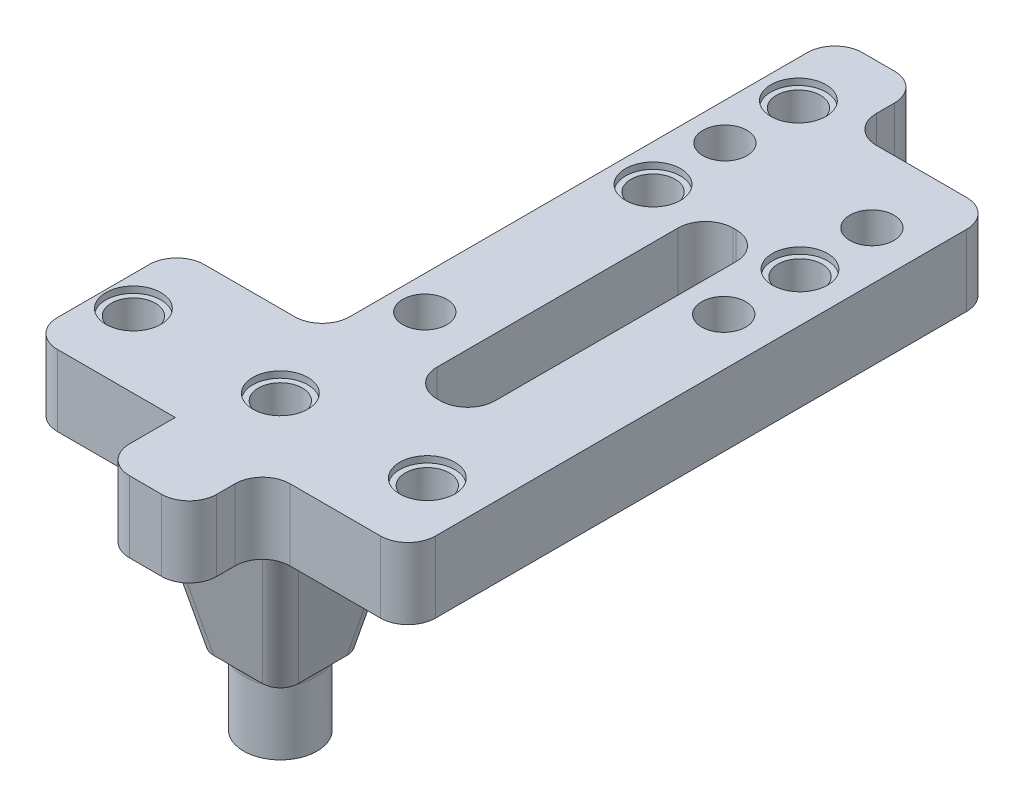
ISO-10303-21;
HEADER;
FILE_DESCRIPTION(('STEP AP214'),'2;1');
FILE_NAME('part.step','',(''),(''),'','','');
FILE_SCHEMA(('AUTOMOTIVE_DESIGN { 1 0 10303 214 1 1 1 1 }'));
ENDSEC;
DATA;
#1=APPLICATION_CONTEXT('core data for automotive mechanical design processes');
#2=APPLICATION_PROTOCOL_DEFINITION('international standard','automotive_design',2000,#1);
#3=PRODUCT_CONTEXT('',#1,'mechanical');
#4=PRODUCT('Part','Part','',(#3));
#5=PRODUCT_RELATED_PRODUCT_CATEGORY('part','',(#4));
#6=PRODUCT_DEFINITION_FORMATION('','',#4);
#7=PRODUCT_DEFINITION_CONTEXT('part definition',#1,'design');
#8=PRODUCT_DEFINITION('design','',#6,#7);
#9=PRODUCT_DEFINITION_SHAPE('','',#8);
#10=(LENGTH_UNIT() NAMED_UNIT(*) SI_UNIT(.MILLI.,.METRE.));
#11=(NAMED_UNIT(*) PLANE_ANGLE_UNIT() SI_UNIT($,.RADIAN.));
#12=(NAMED_UNIT(*) SI_UNIT($,.STERADIAN.) SOLID_ANGLE_UNIT());
#13=UNCERTAINTY_MEASURE_WITH_UNIT(LENGTH_MEASURE(1.E-05),#10,'distance_accuracy_value','');
#14=(GEOMETRIC_REPRESENTATION_CONTEXT(3) GLOBAL_UNCERTAINTY_ASSIGNED_CONTEXT((#13)) GLOBAL_UNIT_ASSIGNED_CONTEXT((#10,
#11,#12)) REPRESENTATION_CONTEXT('',''));
#15=CARTESIAN_POINT('',(0.,0.,0.));
#16=DIRECTION('',(0.,0.,1.));
#17=DIRECTION('',(1.,0.,0.));
#18=AXIS2_PLACEMENT_3D('',#15,#16,#17);
#19=CARTESIAN_POINT('',(27.282,-16.,-16.));
#20=DIRECTION('',(0.,-1.,0.));
#21=DIRECTION('',(0.,0.,-1.));
#22=AXIS2_PLACEMENT_3D('',#19,#20,#21);
#23=PLANE('',#22);
#24=DIRECTION('',(0.,0.,1.));
#25=VECTOR('',#24,1.);
#26=CARTESIAN_POINT('',(14.6829049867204,-16.,0.));
#27=LINE('',#26,#25);
#28=CARTESIAN_POINT('',(14.6829049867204,-16.,-9.96171482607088));
#29=VERTEX_POINT('',#28);
#30=CARTESIAN_POINT('',(14.6829049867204,-16.,-10.642799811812));
#31=VERTEX_POINT('',#30);
#32=EDGE_CURVE('E793',#29,#31,#27,.F.);
#33=ORIENTED_EDGE('',*,*,#32,.T.);
#34=CARTESIAN_POINT('',(16.7275861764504,-16.,-10.5544138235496));
#35=DIRECTION('',(0.,-1.,0.));
#36=DIRECTION('',(-0.707106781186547,0.,-0.707106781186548));
#37=AXIS2_PLACEMENT_3D('',#34,#35,#36);
#38=ELLIPSE('',#37,2.08840664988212,2.);
#39=CARTESIAN_POINT('',(16.639200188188,-16.,-12.5990950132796));
#40=VERTEX_POINT('',#39);
#41=EDGE_CURVE('E57',#31,#40,#38,.T.);
#42=ORIENTED_EDGE('',*,*,#41,.T.);
#43=DIRECTION('',(-1.,0.,0.));
#44=VECTOR('',#43,1.);
#45=CARTESIAN_POINT('',(11.282,-16.,-12.5990950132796));
#46=LINE('',#45,#44);
#47=CARTESIAN_POINT('',(17.3202851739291,-16.,-12.5990950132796));
#48=VERTEX_POINT('',#47);
#49=EDGE_CURVE('E750',#40,#48,#46,.F.);
#50=ORIENTED_EDGE('',*,*,#49,.T.);
#51=CARTESIAN_POINT('',(19.282,-16.,-8.));
#52=DIRECTION('',(0.,-1.,0.));
#53=DIRECTION('',(0.,0.,-1.));
#54=AXIS2_PLACEMENT_3D('',#51,#52,#53);
#55=CIRCLE('',#54,5.);
#56=EDGE_CURVE('E914',#48,#29,#55,.F.);
#57=ORIENTED_EDGE('',*,*,#56,.T.);
#58=EDGE_LOOP('',(#33,#42,#50,#57));
#59=FACE_BOUND('',#58,.T.);
#60=ADVANCED_FACE('F41',(#59),#23,.T.);
#61=DIRECTION('',(1.,0.,0.));
#62=VECTOR('',#61,1.);
#63=CARTESIAN_POINT('',(11.282,-16.,-3.40090498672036));
#64=LINE('',#63,#62);
#65=CARTESIAN_POINT('',(17.3202851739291,-16.,-3.40090498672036));
#66=VERTEX_POINT('',#65);
#67=CARTESIAN_POINT('',(16.639200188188,-16.,-3.40090498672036));
#68=VERTEX_POINT('',#67);
#69=EDGE_CURVE('E790',#66,#68,#64,.F.);
#70=ORIENTED_EDGE('',*,*,#69,.T.);
#71=CARTESIAN_POINT('',(16.7275861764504,-16.,-5.44558617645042));
#72=DIRECTION('',(0.,-1.,0.));
#73=DIRECTION('',(-0.707106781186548,0.,0.707106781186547));
#74=AXIS2_PLACEMENT_3D('',#71,#72,#73);
#75=ELLIPSE('',#74,2.08840664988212,2.);
#76=CARTESIAN_POINT('',(14.6829049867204,-16.,-5.35720018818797));
#77=VERTEX_POINT('',#76);
#78=EDGE_CURVE('E912',#68,#77,#75,.T.);
#79=ORIENTED_EDGE('',*,*,#78,.T.);
#80=CARTESIAN_POINT('',(14.6829049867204,-16.,-6.03828517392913));
#81=VERTEX_POINT('',#80);
#82=EDGE_CURVE('E748',#77,#81,#27,.F.);
#83=ORIENTED_EDGE('',*,*,#82,.T.);
#84=CARTESIAN_POINT('',(19.282,-16.,-8.));
#85=DIRECTION('',(0.,-1.,0.));
#86=DIRECTION('',(0.,0.,-1.));
#87=AXIS2_PLACEMENT_3D('',#84,#85,#86);
#88=CIRCLE('',#87,5.);
#89=EDGE_CURVE('E915',#81,#66,#88,.F.);
#90=ORIENTED_EDGE('',*,*,#89,.T.);
#91=EDGE_LOOP('',(#70,#79,#83,#90));
#92=FACE_BOUND('',#91,.T.);
#93=ADVANCED_FACE('F716',(#92),#23,.T.);
#94=DIRECTION('',(0.,0.,-1.));
#95=VECTOR('',#94,1.);
#96=CARTESIAN_POINT('',(23.8810950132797,-16.,0.));
#97=LINE('',#96,#95);
#98=CARTESIAN_POINT('',(23.8810950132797,-16.,-6.03828517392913));
#99=VERTEX_POINT('',#98);
#100=CARTESIAN_POINT('',(23.8810950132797,-16.,-5.35720018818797));
#101=VERTEX_POINT('',#100);
#102=EDGE_CURVE('E778',#99,#101,#97,.F.);
#103=ORIENTED_EDGE('',*,*,#102,.T.);
#104=CARTESIAN_POINT('',(21.8364138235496,-16.,-5.44558617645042));
#105=DIRECTION('',(0.,-1.,0.));
#106=DIRECTION('',(0.707106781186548,0.,0.707106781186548));
#107=AXIS2_PLACEMENT_3D('',#104,#105,#106);
#108=ELLIPSE('',#107,2.08840664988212,2.);
#109=CARTESIAN_POINT('',(21.924799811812,-16.,-3.40090498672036));
#110=VERTEX_POINT('',#109);
#111=EDGE_CURVE('E1346',#101,#110,#108,.T.);
#112=ORIENTED_EDGE('',*,*,#111,.T.);
#113=CARTESIAN_POINT('',(21.2437148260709,-16.,-3.40090498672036));
#114=VERTEX_POINT('',#113);
#115=EDGE_CURVE('E791',#110,#114,#64,.F.);
#116=ORIENTED_EDGE('',*,*,#115,.T.);
#117=CARTESIAN_POINT('',(19.282,-16.,-8.));
#118=DIRECTION('',(0.,-1.,0.));
#119=DIRECTION('',(0.,0.,-1.));
#120=AXIS2_PLACEMENT_3D('',#117,#118,#119);
#121=CIRCLE('',#120,5.);
#122=EDGE_CURVE('E919',#114,#99,#121,.F.);
#123=ORIENTED_EDGE('',*,*,#122,.T.);
#124=EDGE_LOOP('',(#103,#112,#116,#123));
#125=FACE_BOUND('',#124,.T.);
#126=ADVANCED_FACE('F722',(#125),#23,.T.);
#127=CARTESIAN_POINT('',(21.2437148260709,-16.,-12.5990950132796));
#128=VERTEX_POINT('',#127);
#129=CARTESIAN_POINT('',(21.924799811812,-16.,-12.5990950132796));
#130=VERTEX_POINT('',#129);
#131=EDGE_CURVE('E739',#128,#130,#46,.F.);
#132=ORIENTED_EDGE('',*,*,#131,.T.);
#133=CARTESIAN_POINT('',(21.8364138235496,-16.,-10.5544138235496));
#134=DIRECTION('',(0.,-1.,0.));
#135=DIRECTION('',(0.707106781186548,0.,-0.707106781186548));
#136=AXIS2_PLACEMENT_3D('',#133,#134,#135);
#137=ELLIPSE('',#136,2.08840664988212,2.);
#138=CARTESIAN_POINT('',(23.8810950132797,-16.,-10.642799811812));
#139=VERTEX_POINT('',#138);
#140=EDGE_CURVE('E740',#130,#139,#137,.T.);
#141=ORIENTED_EDGE('',*,*,#140,.T.);
#142=CARTESIAN_POINT('',(23.8810950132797,-16.,-9.96171482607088));
#143=VERTEX_POINT('',#142);
#144=EDGE_CURVE('E784',#139,#143,#97,.F.);
#145=ORIENTED_EDGE('',*,*,#144,.T.);
#146=CARTESIAN_POINT('',(19.282,-16.,-8.));
#147=DIRECTION('',(0.,-1.,0.));
#148=DIRECTION('',(0.,0.,-1.));
#149=AXIS2_PLACEMENT_3D('',#146,#147,#148);
#150=CIRCLE('',#149,5.);
#151=EDGE_CURVE('E743',#143,#128,#150,.F.);
#152=ORIENTED_EDGE('',*,*,#151,.T.);
#153=EDGE_LOOP('',(#132,#141,#145,#152));
#154=FACE_BOUND('',#153,.T.);
#155=ADVANCED_FACE('F717',(#154),#23,.T.);
#156=CARTESIAN_POINT('',(0.,0.,0.));
#157=DIRECTION('',(0.,1.,0.));
#158=DIRECTION('',(0.,0.,1.));
#159=AXIS2_PLACEMENT_3D('',#156,#157,#158);
#160=PLANE('',#159);
#161=DIRECTION('',(0.,0.,-1.));
#162=VECTOR('',#161,1.);
#163=CARTESIAN_POINT('',(31.681,0.,-48.23));
#164=LINE('',#163,#162);
#165=CARTESIAN_POINT('',(31.681,0.,-19.));
#166=VERTEX_POINT('',#165);
#167=CARTESIAN_POINT('',(31.681,0.,-45.23));
#168=VERTEX_POINT('',#167);
#169=EDGE_CURVE('E878',#166,#168,#164,.T.);
#170=ORIENTED_EDGE('',*,*,#169,.T.);
#171=CARTESIAN_POINT('',(28.681,0.,-45.23));
#172=DIRECTION('',(0.,1.,0.));
#173=DIRECTION('',(0.,0.,1.));
#174=AXIS2_PLACEMENT_3D('',#171,#172,#173);
#175=CIRCLE('',#174,3.);
#176=CARTESIAN_POINT('',(28.681,0.,-48.23));
#177=VERTEX_POINT('',#176);
#178=EDGE_CURVE('E566',#168,#177,#175,.T.);
#179=ORIENTED_EDGE('',*,*,#178,.T.);
#180=DIRECTION('',(-1.,0.,0.));
#181=VECTOR('',#180,1.);
#182=CARTESIAN_POINT('',(25.341,0.,-48.23));
#183=LINE('',#182,#181);
#184=CARTESIAN_POINT('',(28.341,0.,-48.23));
#185=VERTEX_POINT('',#184);
#186=EDGE_CURVE('E397',#177,#185,#183,.T.);
#187=ORIENTED_EDGE('',*,*,#186,.T.);
#188=CARTESIAN_POINT('',(28.341,0.,-45.23));
#189=DIRECTION('',(0.,1.,0.));
#190=DIRECTION('',(0.,0.,1.));
#191=AXIS2_PLACEMENT_3D('',#188,#189,#190);
#192=CIRCLE('',#191,3.);
#193=CARTESIAN_POINT('',(25.341,0.,-45.23));
#194=VERTEX_POINT('',#193);
#195=EDGE_CURVE('E570',#185,#194,#192,.T.);
#196=ORIENTED_EDGE('',*,*,#195,.T.);
#197=DIRECTION('',(0.,0.,1.));
#198=VECTOR('',#197,1.);
#199=CARTESIAN_POINT('',(25.341,0.,-48.23));
#200=LINE('',#199,#198);
#201=CARTESIAN_POINT('',(25.341,0.,-19.));
#202=VERTEX_POINT('',#201);
#203=EDGE_CURVE('E871',#194,#202,#200,.T.);
#204=ORIENTED_EDGE('',*,*,#203,.T.);
#205=CARTESIAN_POINT('',(28.341,0.,-19.));
#206=DIRECTION('',(0.,1.,0.));
#207=DIRECTION('',(0.,0.,1.));
#208=AXIS2_PLACEMENT_3D('',#205,#206,#207);
#209=CIRCLE('',#208,3.);
#210=CARTESIAN_POINT('',(28.341,0.,-16.));
#211=VERTEX_POINT('',#210);
#212=EDGE_CURVE('E574',#202,#211,#209,.T.);
#213=ORIENTED_EDGE('',*,*,#212,.T.);
#214=DIRECTION('',(1.,0.,0.));
#215=VECTOR('',#214,1.);
#216=CARTESIAN_POINT('',(31.681,0.,-16.));
#217=LINE('',#216,#215);
#218=CARTESIAN_POINT('',(28.681,0.,-16.));
#219=VERTEX_POINT('',#218);
#220=EDGE_CURVE('E874',#211,#219,#217,.T.);
#221=ORIENTED_EDGE('',*,*,#220,.T.);
#222=CARTESIAN_POINT('',(28.681,0.,-19.));
#223=DIRECTION('',(0.,1.,0.));
#224=DIRECTION('',(0.,0.,1.));
#225=AXIS2_PLACEMENT_3D('',#222,#223,#224);
#226=CIRCLE('',#225,3.);
#227=EDGE_CURVE('E586',#219,#166,#226,.T.);
#228=ORIENTED_EDGE('',*,*,#227,.T.);
#229=EDGE_LOOP('',(#170,#179,#187,#196,#204,#213,#221,#228));
#230=FACE_BOUND('',#229,.T.);
#231=CARTESIAN_POINT('',(19.882,0.,-55.81));
#232=DIRECTION('',(0.,1.,0.));
#233=DIRECTION('',(0.,0.,1.));
#234=AXIS2_PLACEMENT_3D('',#231,#232,#233);
#235=CIRCLE('',#234,2.4);
#236=CARTESIAN_POINT('',(19.882,0.,-53.41));
#237=VERTEX_POINT('',#236);
#238=EDGE_CURVE('E865',#237,#237,#235,.T.);
#239=ORIENTED_EDGE('',*,*,#238,.T.);
#240=EDGE_LOOP('',(#239));
#241=FACE_BOUND('',#240,.T.);
#242=CARTESIAN_POINT('',(35.882,0.,-55.81));
#243=DIRECTION('',(0.,1.,0.));
#244=DIRECTION('',(0.,0.,1.));
#245=AXIS2_PLACEMENT_3D('',#242,#243,#244);
#246=CIRCLE('',#245,2.4);
#247=CARTESIAN_POINT('',(35.882,0.,-53.41));
#248=VERTEX_POINT('',#247);
#249=EDGE_CURVE('E859',#248,#248,#246,.T.);
#250=ORIENTED_EDGE('',*,*,#249,.T.);
#251=EDGE_LOOP('',(#250));
#252=FACE_BOUND('',#251,.T.);
#253=CARTESIAN_POINT('',(35.282,0.,-8.));
#254=DIRECTION('',(0.,-1.,0.));
#255=DIRECTION('',(0.,0.,-1.));
#256=AXIS2_PLACEMENT_3D('',#253,#254,#255);
#257=CIRCLE('',#256,3.);
#258=CARTESIAN_POINT('',(35.282,0.,-11.));
#259=VERTEX_POINT('',#258);
#260=EDGE_CURVE('E834',#259,#259,#257,.T.);
#261=ORIENTED_EDGE('',*,*,#260,.F.);
#262=EDGE_LOOP('',(#261));
#263=FACE_BOUND('',#262,.T.);
#264=CARTESIAN_POINT('',(19.482,0.,-23.53));
#265=DIRECTION('',(0.,1.,0.));
#266=DIRECTION('',(0.,0.,1.));
#267=AXIS2_PLACEMENT_3D('',#264,#265,#266);
#268=CIRCLE('',#267,2.4);
#269=CARTESIAN_POINT('',(19.482,0.,-21.13));
#270=VERTEX_POINT('',#269);
#271=EDGE_CURVE('E831',#270,#270,#268,.T.);
#272=ORIENTED_EDGE('',*,*,#271,.T.);
#273=EDGE_LOOP('',(#272));
#274=FACE_BOUND('',#273,.T.);
#275=CARTESIAN_POINT('',(35.982,0.,-39.58));
#276=DIRECTION('',(0.,1.,0.));
#277=DIRECTION('',(0.,0.,1.));
#278=AXIS2_PLACEMENT_3D('',#275,#276,#277);
#279=CIRCLE('',#278,2.4);
#280=CARTESIAN_POINT('',(35.982,0.,-37.18));
#281=VERTEX_POINT('',#280);
#282=EDGE_CURVE('E825',#281,#281,#279,.T.);
#283=ORIENTED_EDGE('',*,*,#282,.T.);
#284=EDGE_LOOP('',(#283));
#285=FACE_BOUND('',#284,.T.);
#286=CARTESIAN_POINT('',(19.882,0.,-63.81));
#287=DIRECTION('',(0.,-1.,0.));
#288=DIRECTION('',(0.,0.,-1.));
#289=AXIS2_PLACEMENT_3D('',#286,#287,#288);
#290=CIRCLE('',#289,3.);
#291=CARTESIAN_POINT('',(19.882,0.,-66.81));
#292=VERTEX_POINT('',#291);
#293=EDGE_CURVE('E612',#292,#292,#290,.T.);
#294=ORIENTED_EDGE('',*,*,#293,.F.);
#295=EDGE_LOOP('',(#294));
#296=FACE_BOUND('',#295,.T.);
#297=CARTESIAN_POINT('',(19.882,0.,-47.98));
#298=DIRECTION('',(0.,-1.,0.));
#299=DIRECTION('',(0.,0.,-1.));
#300=AXIS2_PLACEMENT_3D('',#297,#298,#299);
#301=CIRCLE('',#300,3.);
#302=CARTESIAN_POINT('',(19.882,0.,-50.98));
#303=VERTEX_POINT('',#302);
#304=EDGE_CURVE('E617',#303,#303,#301,.T.);
#305=ORIENTED_EDGE('',*,*,#304,.F.);
#306=EDGE_LOOP('',(#305));
#307=FACE_BOUND('',#306,.T.);
#308=CARTESIAN_POINT('',(35.882,0.,-47.98));
#309=DIRECTION('',(0.,-1.,0.));
#310=DIRECTION('',(0.,0.,-1.));
#311=AXIS2_PLACEMENT_3D('',#308,#309,#310);
#312=CIRCLE('',#311,3.);
#313=CARTESIAN_POINT('',(35.882,0.,-50.98));
#314=VERTEX_POINT('',#313);
#315=EDGE_CURVE('E800',#314,#314,#312,.T.);
#316=ORIENTED_EDGE('',*,*,#315,.F.);
#317=EDGE_LOOP('',(#316));
#318=FACE_BOUND('',#317,.T.);
#319=DIRECTION('',(-1.,0.,0.));
#320=VECTOR('',#319,1.);
#321=CARTESIAN_POINT('',(11.282,0.,0.));
#322=LINE('',#321,#320);
#323=CARTESIAN_POINT('',(25.3257047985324,0.,0.));
#324=VERTEX_POINT('',#323);
#325=CARTESIAN_POINT('',(15.841,0.,0.));
#326=VERTEX_POINT('',#325);
#327=EDGE_CURVE('E786',#324,#326,#322,.T.);
#328=ORIENTED_EDGE('',*,*,#327,.F.);
#329=CARTESIAN_POINT('',(25.23731881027,0.,-2.04468118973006));
#330=DIRECTION('',(0.,1.,0.));
#331=DIRECTION('',(0.707106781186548,0.,0.707106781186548));
#332=AXIS2_PLACEMENT_3D('',#329,#330,#331);
#333=ELLIPSE('',#332,2.08840664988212,2.);
#334=CARTESIAN_POINT('',(27.282,0.,-1.95629520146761));
#335=VERTEX_POINT('',#334);
#336=EDGE_CURVE('E757',#324,#335,#333,.T.);
#337=ORIENTED_EDGE('',*,*,#336,.T.);
#338=DIRECTION('',(0.,0.,1.));
#339=VECTOR('',#338,1.);
#340=CARTESIAN_POINT('',(27.282,0.,0.));
#341=LINE('',#340,#339);
#342=CARTESIAN_POINT('',(27.282,0.,-14.0437047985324));
#343=VERTEX_POINT('',#342);
#344=EDGE_CURVE('E774',#343,#335,#341,.T.);
#345=ORIENTED_EDGE('',*,*,#344,.F.);
#346=CARTESIAN_POINT('',(25.23731881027,0.,-13.9553188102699));
#347=DIRECTION('',(0.,1.,0.));
#348=DIRECTION('',(0.707106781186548,0.,-0.707106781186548));
#349=AXIS2_PLACEMENT_3D('',#346,#347,#348);
#350=ELLIPSE('',#349,2.08840664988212,2.);
#351=CARTESIAN_POINT('',(25.3257047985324,0.,-16.));
#352=VERTEX_POINT('',#351);
#353=EDGE_CURVE('E50',#343,#352,#350,.T.);
#354=ORIENTED_EDGE('',*,*,#353,.T.);
#355=DIRECTION('',(1.,0.,0.));
#356=VECTOR('',#355,1.);
#357=CARTESIAN_POINT('',(11.282,0.,-16.));
#358=LINE('',#357,#356);
#359=CARTESIAN_POINT('',(13.2382952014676,0.,-16.));
#360=VERTEX_POINT('',#359);
#361=EDGE_CURVE('E772',#360,#352,#358,.T.);
#362=ORIENTED_EDGE('',*,*,#361,.F.);
#363=CARTESIAN_POINT('',(13.3266811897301,0.,-13.9553188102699));
#364=DIRECTION('',(0.,1.,0.));
#365=DIRECTION('',(-0.707106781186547,0.,-0.707106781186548));
#366=AXIS2_PLACEMENT_3D('',#363,#364,#365);
#367=ELLIPSE('',#366,2.08840664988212,2.);
#368=CARTESIAN_POINT('',(11.282,0.,-14.0437047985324));
#369=VERTEX_POINT('',#368);
#370=EDGE_CURVE('E11',#360,#369,#367,.T.);
#371=ORIENTED_EDGE('',*,*,#370,.T.);
#372=DIRECTION('',(0.,0.,-1.));
#373=VECTOR('',#372,1.);
#374=CARTESIAN_POINT('',(11.282,0.,0.));
#375=LINE('',#374,#373);
#376=CARTESIAN_POINT('',(11.282,0.,-1.95629520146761));
#377=VERTEX_POINT('',#376);
#378=EDGE_CURVE('E779',#377,#369,#375,.T.);
#379=ORIENTED_EDGE('',*,*,#378,.F.);
#380=CARTESIAN_POINT('',(13.3266811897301,0.,-2.04468118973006));
#381=DIRECTION('',(0.,1.,0.));
#382=DIRECTION('',(-0.707106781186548,0.,0.707106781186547));
#383=AXIS2_PLACEMENT_3D('',#380,#381,#382);
#384=ELLIPSE('',#383,2.08840664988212,2.);
#385=CARTESIAN_POINT('',(13.2382952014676,0.,0.));
#386=VERTEX_POINT('',#385);
#387=EDGE_CURVE('E764',#377,#386,#384,.T.);
#388=ORIENTED_EDGE('',*,*,#387,.T.);
#389=DIRECTION('',(1.,0.,0.));
#390=VECTOR('',#389,1.);
#391=CARTESIAN_POINT('',(0.,0.,0.));
#392=LINE('',#391,#390);
#393=CARTESIAN_POINT('',(3.,0.,0.));
#394=VERTEX_POINT('',#393);
#395=EDGE_CURVE('E396',#394,#386,#392,.T.);
#396=ORIENTED_EDGE('',*,*,#395,.F.);
#397=CARTESIAN_POINT('',(3.,0.,-3.));
#398=DIRECTION('',(0.,1.,0.));
#399=DIRECTION('',(0.,0.,1.));
#400=AXIS2_PLACEMENT_3D('',#397,#398,#399);
#401=CIRCLE('',#400,3.);
#402=CARTESIAN_POINT('',(0.,0.,-3.));
#403=VERTEX_POINT('',#402);
#404=EDGE_CURVE('E467',#394,#403,#401,.F.);
#405=ORIENTED_EDGE('',*,*,#404,.T.);
#406=DIRECTION('',(0.,0.,1.));
#407=VECTOR('',#406,1.);
#408=CARTESIAN_POINT('',(0.,0.,-16.));
#409=LINE('',#408,#407);
#410=CARTESIAN_POINT('',(0.,0.,-13.));
#411=VERTEX_POINT('',#410);
#412=EDGE_CURVE('E393',#411,#403,#409,.T.);
#413=ORIENTED_EDGE('',*,*,#412,.F.);
#414=CARTESIAN_POINT('',(3.,0.,-13.));
#415=DIRECTION('',(0.,1.,0.));
#416=DIRECTION('',(0.,0.,1.));
#417=AXIS2_PLACEMENT_3D('',#414,#415,#416);
#418=CIRCLE('',#417,3.);
#419=CARTESIAN_POINT('',(3.,0.,-16.));
#420=VERTEX_POINT('',#419);
#421=EDGE_CURVE('E464',#411,#420,#418,.F.);
#422=ORIENTED_EDGE('',*,*,#421,.T.);
#423=DIRECTION('',(-1.,0.,0.));
#424=VECTOR('',#423,1.);
#425=CARTESIAN_POINT('',(15.841,0.,-16.));
#426=LINE('',#425,#424);
#427=CARTESIAN_POINT('',(12.841,0.,-16.));
#428=VERTEX_POINT('',#427);
#429=EDGE_CURVE('E425',#428,#420,#426,.T.);
#430=ORIENTED_EDGE('',*,*,#429,.F.);
#431=CARTESIAN_POINT('',(12.841,0.,-19.));
#432=DIRECTION('',(0.,1.,0.));
#433=DIRECTION('',(0.,0.,1.));
#434=AXIS2_PLACEMENT_3D('',#431,#432,#433);
#435=CIRCLE('',#434,3.);
#436=CARTESIAN_POINT('',(15.841,0.,-19.));
#437=VERTEX_POINT('',#436);
#438=EDGE_CURVE('E580',#428,#437,#435,.T.);
#439=ORIENTED_EDGE('',*,*,#438,.T.);
#440=DIRECTION('',(0.,0.,1.));
#441=VECTOR('',#440,1.);
#442=CARTESIAN_POINT('',(15.841,0.,-71.815));
#443=LINE('',#442,#441);
#444=CARTESIAN_POINT('',(15.841,0.,-68.815));
#445=VERTEX_POINT('',#444);
#446=EDGE_CURVE('E422',#445,#437,#443,.T.);
#447=ORIENTED_EDGE('',*,*,#446,.F.);
#448=CARTESIAN_POINT('',(18.841,0.,-68.815));
#449=DIRECTION('',(0.,1.,0.));
#450=DIRECTION('',(0.,0.,1.));
#451=AXIS2_PLACEMENT_3D('',#448,#449,#450);
#452=CIRCLE('',#451,3.);
#453=CARTESIAN_POINT('',(18.841,0.,-71.815));
#454=VERTEX_POINT('',#453);
#455=EDGE_CURVE('E460',#445,#454,#452,.F.);
#456=ORIENTED_EDGE('',*,*,#455,.T.);
#457=DIRECTION('',(-1.,0.,0.));
#458=VECTOR('',#457,1.);
#459=CARTESIAN_POINT('',(25.341,0.,-71.815));
#460=LINE('',#459,#458);
#461=CARTESIAN_POINT('',(22.341,0.,-71.815));
#462=VERTEX_POINT('',#461);
#463=EDGE_CURVE('E419',#462,#454,#460,.T.);
#464=ORIENTED_EDGE('',*,*,#463,.F.);
#465=CARTESIAN_POINT('',(22.341,0.,-68.815));
#466=DIRECTION('',(0.,1.,0.));
#467=DIRECTION('',(0.,0.,1.));
#468=AXIS2_PLACEMENT_3D('',#465,#466,#467);
#469=CIRCLE('',#468,3.);
#470=CARTESIAN_POINT('',(25.341,0.,-68.815));
#471=VERTEX_POINT('',#470);
#472=EDGE_CURVE('E462',#462,#471,#469,.F.);
#473=ORIENTED_EDGE('',*,*,#472,.T.);
#474=DIRECTION('',(0.,0.,-1.));
#475=VECTOR('',#474,1.);
#476=CARTESIAN_POINT('',(25.341,0.,-63.83));
#477=LINE('',#476,#475);
#478=CARTESIAN_POINT('',(25.341,0.,-66.83));
#479=VERTEX_POINT('',#478);
#480=EDGE_CURVE('E416',#479,#471,#477,.T.);
#481=ORIENTED_EDGE('',*,*,#480,.F.);
#482=CARTESIAN_POINT('',(28.341,0.,-66.83));
#483=DIRECTION('',(0.,1.,0.));
#484=DIRECTION('',(0.,0.,1.));
#485=AXIS2_PLACEMENT_3D('',#482,#483,#484);
#486=CIRCLE('',#485,3.);
#487=CARTESIAN_POINT('',(28.341,0.,-63.83));
#488=VERTEX_POINT('',#487);
#489=EDGE_CURVE('E560',#479,#488,#486,.T.);
#490=ORIENTED_EDGE('',*,*,#489,.T.);
#491=DIRECTION('',(-1.,0.,0.));
#492=VECTOR('',#491,1.);
#493=CARTESIAN_POINT('',(41.182,0.,-63.83));
#494=LINE('',#493,#492);
#495=CARTESIAN_POINT('',(38.182,0.,-63.83));
#496=VERTEX_POINT('',#495);
#497=EDGE_CURVE('E413',#496,#488,#494,.T.);
#498=ORIENTED_EDGE('',*,*,#497,.F.);
#499=CARTESIAN_POINT('',(38.182,0.,-60.83));
#500=DIRECTION('',(0.,1.,0.));
#501=DIRECTION('',(0.,0.,1.));
#502=AXIS2_PLACEMENT_3D('',#499,#500,#501);
#503=CIRCLE('',#502,3.);
#504=CARTESIAN_POINT('',(41.182,0.,-60.83));
#505=VERTEX_POINT('',#504);
#506=EDGE_CURVE('E473',#496,#505,#503,.F.);
#507=ORIENTED_EDGE('',*,*,#506,.T.);
#508=DIRECTION('',(0.,0.,-1.));
#509=VECTOR('',#508,1.);
#510=CARTESIAN_POINT('',(41.182,0.,0.));
#511=LINE('',#510,#509);
#512=CARTESIAN_POINT('',(41.182,0.,-3.));
#513=VERTEX_POINT('',#512);
#514=EDGE_CURVE('E410',#513,#505,#511,.T.);
#515=ORIENTED_EDGE('',*,*,#514,.F.);
#516=CARTESIAN_POINT('',(38.182,0.,-3.));
#517=DIRECTION('',(0.,1.,0.));
#518=DIRECTION('',(0.,0.,1.));
#519=AXIS2_PLACEMENT_3D('',#516,#517,#518);
#520=CIRCLE('',#519,3.);
#521=CARTESIAN_POINT('',(38.182,0.,0.));
#522=VERTEX_POINT('',#521);
#523=EDGE_CURVE('E475',#513,#522,#520,.F.);
#524=ORIENTED_EDGE('',*,*,#523,.T.);
#525=DIRECTION('',(1.,0.,0.));
#526=VECTOR('',#525,1.);
#527=CARTESIAN_POINT('',(25.341,0.,0.));
#528=LINE('',#527,#526);
#529=CARTESIAN_POINT('',(28.341,0.,0.));
#530=VERTEX_POINT('',#529);
#531=EDGE_CURVE('E407',#530,#522,#528,.T.);
#532=ORIENTED_EDGE('',*,*,#531,.F.);
#533=CARTESIAN_POINT('',(28.341,0.,3.));
#534=DIRECTION('',(0.,1.,0.));
#535=DIRECTION('',(0.,0.,1.));
#536=AXIS2_PLACEMENT_3D('',#533,#534,#535);
#537=CIRCLE('',#536,3.);
#538=CARTESIAN_POINT('',(25.341,0.,3.));
#539=VERTEX_POINT('',#538);
#540=EDGE_CURVE('E576',#530,#539,#537,.T.);
#541=ORIENTED_EDGE('',*,*,#540,.T.);
#542=DIRECTION('',(0.,0.,-1.));
#543=VECTOR('',#542,1.);
#544=CARTESIAN_POINT('',(25.341,0.,7.985));
#545=LINE('',#544,#543);
#546=CARTESIAN_POINT('',(25.341,0.,4.985));
#547=VERTEX_POINT('',#546);
#548=EDGE_CURVE('E404',#547,#539,#545,.T.);
#549=ORIENTED_EDGE('',*,*,#548,.F.);
#550=CARTESIAN_POINT('',(22.341,0.,4.985));
#551=DIRECTION('',(0.,1.,0.));
#552=DIRECTION('',(0.,0.,1.));
#553=AXIS2_PLACEMENT_3D('',#550,#551,#552);
#554=CIRCLE('',#553,3.);
#555=CARTESIAN_POINT('',(22.341,0.,7.985));
#556=VERTEX_POINT('',#555);
#557=EDGE_CURVE('E471',#547,#556,#554,.F.);
#558=ORIENTED_EDGE('',*,*,#557,.T.);
#559=DIRECTION('',(1.,0.,0.));
#560=VECTOR('',#559,1.);
#561=CARTESIAN_POINT('',(15.841,0.,7.985));
#562=LINE('',#561,#560);
#563=CARTESIAN_POINT('',(18.841,0.,7.985));
#564=VERTEX_POINT('',#563);
#565=EDGE_CURVE('E401',#564,#556,#562,.T.);
#566=ORIENTED_EDGE('',*,*,#565,.F.);
#567=CARTESIAN_POINT('',(18.841,0.,4.985));
#568=DIRECTION('',(0.,1.,0.));
#569=DIRECTION('',(0.,0.,1.));
#570=AXIS2_PLACEMENT_3D('',#567,#568,#569);
#571=CIRCLE('',#570,3.);
#572=CARTESIAN_POINT('',(15.841,0.,4.985));
#573=VERTEX_POINT('',#572);
#574=EDGE_CURVE('E469',#564,#573,#571,.F.);
#575=ORIENTED_EDGE('',*,*,#574,.T.);
#576=DIRECTION('',(0.,0.,1.));
#577=VECTOR('',#576,1.);
#578=CARTESIAN_POINT('',(15.841,0.,0.));
#579=LINE('',#578,#577);
#580=EDGE_CURVE('E399',#326,#573,#579,.T.);
#581=ORIENTED_EDGE('',*,*,#580,.F.);
#582=EDGE_LOOP('',(#328,#337,#345,#354,#362,#371,#379,#388,#396,#405,#413,#422,#430,#439,#447,
#456,#464,#473,#481,#490,#498,#507,#515,#524,#532,#541,#549,#558,#566,#575,#581));
#583=FACE_BOUND('',#582,.T.);
#584=CARTESIAN_POINT('',(3.28200000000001,0.,-8.));
#585=DIRECTION('',(0.,-1.,0.));
#586=DIRECTION('',(0.,0.,-1.));
#587=AXIS2_PLACEMENT_3D('',#584,#585,#586);
#588=CIRCLE('',#587,3.);
#589=CARTESIAN_POINT('',(3.28200000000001,0.,-11.));
#590=VERTEX_POINT('',#589);
#591=EDGE_CURVE('E450',#590,#590,#588,.T.);
#592=ORIENTED_EDGE('',*,*,#591,.F.);
#593=EDGE_LOOP('',(#592));
#594=FACE_BOUND('',#593,.T.);
#595=ADVANCED_FACE('F727',(#230,#241,#252,#263,#274,#285,#296,#307,#318,#583,#594),#160,.F.);
#596=CARTESIAN_POINT('',(35.882,0.,-47.98));
#597=DIRECTION('',(0.,1.,0.));
#598=DIRECTION('',(0.,0.,1.));
#599=AXIS2_PLACEMENT_3D('',#596,#597,#598);
#600=CYLINDRICAL_SURFACE('',#599,2.4);
#601=CARTESIAN_POINT('',(35.882,7.05,-47.98));
#602=DIRECTION('',(0.,1.,0.));
#603=DIRECTION('',(0.,0.,1.));
#604=AXIS2_PLACEMENT_3D('',#601,#602,#603);
#605=CIRCLE('',#604,2.4);
#606=CARTESIAN_POINT('',(35.882,7.05,-45.58));
#607=VERTEX_POINT('',#606);
#608=EDGE_CURVE('E599',#607,#607,#605,.F.);
#609=ORIENTED_EDGE('',*,*,#608,.F.);
#610=EDGE_LOOP('',(#609));
#611=FACE_BOUND('',#610,.T.);
#612=CARTESIAN_POINT('',(35.882,0.7,-47.98));
#613=DIRECTION('',(0.,-1.,0.));
#614=DIRECTION('',(0.,0.,-1.));
#615=AXIS2_PLACEMENT_3D('',#612,#613,#614);
#616=CIRCLE('',#615,2.4);
#617=CARTESIAN_POINT('',(35.882,0.7,-50.38));
#618=VERTEX_POINT('',#617);
#619=EDGE_CURVE('E614',#618,#618,#616,.F.);
#620=ORIENTED_EDGE('',*,*,#619,.F.);
#621=EDGE_LOOP('',(#620));
#622=FACE_BOUND('',#621,.T.);
#623=ADVANCED_FACE('F733',(#611,#622),#600,.F.);
#624=CARTESIAN_POINT('',(19.882,0.,-47.98));
#625=DIRECTION('',(0.,1.,0.));
#626=DIRECTION('',(0.,0.,1.));
#627=AXIS2_PLACEMENT_3D('',#624,#625,#626);
#628=CYLINDRICAL_SURFACE('',#627,2.4);
#629=CARTESIAN_POINT('',(19.882,7.05,-47.98));
#630=DIRECTION('',(0.,1.,0.));
#631=DIRECTION('',(0.,0.,1.));
#632=AXIS2_PLACEMENT_3D('',#629,#630,#631);
#633=CIRCLE('',#632,2.4);
#634=CARTESIAN_POINT('',(19.882,7.05,-45.58));
#635=VERTEX_POINT('',#634);
#636=EDGE_CURVE('E594',#635,#635,#633,.F.);
#637=ORIENTED_EDGE('',*,*,#636,.F.);
#638=EDGE_LOOP('',(#637));
#639=FACE_BOUND('',#638,.T.);
#640=CARTESIAN_POINT('',(19.882,0.7,-47.98));
#641=DIRECTION('',(0.,-1.,0.));
#642=DIRECTION('',(0.,0.,-1.));
#643=AXIS2_PLACEMENT_3D('',#640,#641,#642);
#644=CIRCLE('',#643,2.4);
#645=CARTESIAN_POINT('',(19.882,0.7,-50.38));
#646=VERTEX_POINT('',#645);
#647=EDGE_CURVE('E609',#646,#646,#644,.F.);
#648=ORIENTED_EDGE('',*,*,#647,.F.);
#649=EDGE_LOOP('',(#648));
#650=FACE_BOUND('',#649,.T.);
#651=ADVANCED_FACE('F1009',(#639,#650),#628,.F.);
#652=CARTESIAN_POINT('',(19.882,0.,-63.81));
#653=DIRECTION('',(0.,1.,0.));
#654=DIRECTION('',(0.,0.,1.));
#655=AXIS2_PLACEMENT_3D('',#652,#653,#654);
#656=CYLINDRICAL_SURFACE('',#655,2.4);
#657=CARTESIAN_POINT('',(19.882,7.05,-63.81));
#658=DIRECTION('',(0.,1.,0.));
#659=DIRECTION('',(0.,0.,1.));
#660=AXIS2_PLACEMENT_3D('',#657,#658,#659);
#661=CIRCLE('',#660,2.4);
#662=CARTESIAN_POINT('',(19.882,7.05,-61.41));
#663=VERTEX_POINT('',#662);
#664=EDGE_CURVE('E589',#663,#663,#661,.F.);
#665=ORIENTED_EDGE('',*,*,#664,.F.);
#666=EDGE_LOOP('',(#665));
#667=FACE_BOUND('',#666,.T.);
#668=CARTESIAN_POINT('',(19.882,0.7,-63.81));
#669=DIRECTION('',(0.,-1.,0.));
#670=DIRECTION('',(0.,0.,-1.));
#671=AXIS2_PLACEMENT_3D('',#668,#669,#670);
#672=CIRCLE('',#671,2.4);
#673=CARTESIAN_POINT('',(19.882,0.7,-66.21));
#674=VERTEX_POINT('',#673);
#675=EDGE_CURVE('E604',#674,#674,#672,.F.);
#676=ORIENTED_EDGE('',*,*,#675,.F.);
#677=EDGE_LOOP('',(#676));
#678=FACE_BOUND('',#677,.T.);
#679=ADVANCED_FACE('F1011',(#667,#678),#656,.F.);
#680=CARTESIAN_POINT('',(35.282,0.,-8.));
#681=DIRECTION('',(0.,1.,0.));
#682=DIRECTION('',(0.,0.,1.));
#683=AXIS2_PLACEMENT_3D('',#680,#681,#682);
#684=CYLINDRICAL_SURFACE('',#683,2.4);
#685=CARTESIAN_POINT('',(35.282,7.05,-8.));
#686=DIRECTION('',(0.,1.,0.));
#687=DIRECTION('',(0.,0.,1.));
#688=AXIS2_PLACEMENT_3D('',#685,#686,#687);
#689=CIRCLE('',#688,2.4);
#690=CARTESIAN_POINT('',(35.282,7.05,-5.6));
#691=VERTEX_POINT('',#690);
#692=EDGE_CURVE('E427',#691,#691,#689,.F.);
#693=ORIENTED_EDGE('',*,*,#692,.F.);
#694=EDGE_LOOP('',(#693));
#695=FACE_BOUND('',#694,.T.);
#696=CARTESIAN_POINT('',(35.282,0.7,-8.));
#697=DIRECTION('',(0.,-1.,0.));
#698=DIRECTION('',(0.,0.,-1.));
#699=AXIS2_PLACEMENT_3D('',#696,#697,#698);
#700=CIRCLE('',#699,2.4);
#701=CARTESIAN_POINT('',(35.282,0.7,-10.4));
#702=VERTEX_POINT('',#701);
#703=EDGE_CURVE('E452',#702,#702,#700,.F.);
#704=ORIENTED_EDGE('',*,*,#703,.F.);
#705=EDGE_LOOP('',(#704));
#706=FACE_BOUND('',#705,.T.);
#707=ADVANCED_FACE('F1014',(#695,#706),#684,.F.);
#708=CARTESIAN_POINT('',(19.282,0.,-8.));
#709=DIRECTION('',(0.,1.,0.));
#710=DIRECTION('',(0.,0.,1.));
#711=AXIS2_PLACEMENT_3D('',#708,#709,#710);
#712=CYLINDRICAL_SURFACE('',#711,2.4);
#713=CARTESIAN_POINT('',(19.282,7.05,-8.));
#714=DIRECTION('',(0.,1.,0.));
#715=DIRECTION('',(0.,0.,1.));
#716=AXIS2_PLACEMENT_3D('',#713,#714,#715);
#717=CIRCLE('',#716,2.4);
#718=CARTESIAN_POINT('',(19.282,7.05,-5.6));
#719=VERTEX_POINT('',#718);
#720=EDGE_CURVE('E432',#719,#719,#717,.F.);
#721=ORIENTED_EDGE('',*,*,#720,.F.);
#722=EDGE_LOOP('',(#721));
#723=FACE_BOUND('',#722,.T.);
#724=CARTESIAN_POINT('',(19.282,0.7,-8.));
#725=DIRECTION('',(0.,-1.,0.));
#726=DIRECTION('',(0.,0.,-1.));
#727=AXIS2_PLACEMENT_3D('',#724,#725,#726);
#728=CIRCLE('',#727,2.4);
#729=CARTESIAN_POINT('',(19.282,0.7,-10.4));
#730=VERTEX_POINT('',#729);
#731=EDGE_CURVE('E447',#730,#730,#728,.F.);
#732=ORIENTED_EDGE('',*,*,#731,.F.);
#733=EDGE_LOOP('',(#732));
#734=FACE_BOUND('',#733,.T.);
#735=ADVANCED_FACE('F1083',(#723,#734),#712,.F.);
#736=CARTESIAN_POINT('',(3.28200000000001,0.,-8.));
#737=DIRECTION('',(0.,1.,0.));
#738=DIRECTION('',(0.,0.,1.));
#739=AXIS2_PLACEMENT_3D('',#736,#737,#738);
#740=CYLINDRICAL_SURFACE('',#739,2.4);
#741=CARTESIAN_POINT('',(3.28200000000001,7.05,-8.));
#742=DIRECTION('',(0.,1.,0.));
#743=DIRECTION('',(0.,0.,1.));
#744=AXIS2_PLACEMENT_3D('',#741,#742,#743);
#745=CIRCLE('',#744,2.4);
#746=CARTESIAN_POINT('',(3.28200000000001,7.05,-5.6));
#747=VERTEX_POINT('',#746);
#748=EDGE_CURVE('E437',#747,#747,#745,.F.);
#749=ORIENTED_EDGE('',*,*,#748,.F.);
#750=EDGE_LOOP('',(#749));
#751=FACE_BOUND('',#750,.T.);
#752=CARTESIAN_POINT('',(3.28200000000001,0.7,-8.));
#753=DIRECTION('',(0.,-1.,0.));
#754=DIRECTION('',(0.,0.,-1.));
#755=AXIS2_PLACEMENT_3D('',#752,#753,#754);
#756=CIRCLE('',#755,2.4);
#757=CARTESIAN_POINT('',(3.28200000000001,0.7,-10.4));
#758=VERTEX_POINT('',#757);
#759=EDGE_CURVE('E442',#758,#758,#756,.F.);
#760=ORIENTED_EDGE('',*,*,#759,.F.);
#761=EDGE_LOOP('',(#760));
#762=FACE_BOUND('',#761,.T.);
#763=ADVANCED_FACE('F1086',(#751,#762),#740,.F.);
#764=CARTESIAN_POINT('',(0.,7.75,-16.));
#765=DIRECTION('',(1.,0.,0.));
#766=DIRECTION('',(0.,0.,-1.));
#767=AXIS2_PLACEMENT_3D('',#764,#765,#766);
#768=PLANE('',#767);
#769=ORIENTED_EDGE('',*,*,#412,.T.);
#770=DIRECTION('',(0.,-1.,0.));
#771=VECTOR('',#770,1.);
#772=CARTESIAN_POINT('',(0.,7.75,-3.));
#773=LINE('',#772,#771);
#774=CARTESIAN_POINT('',(0.,7.75,-3.));
#775=VERTEX_POINT('',#774);
#776=EDGE_CURVE('E543',#403,#775,#773,.F.);
#777=ORIENTED_EDGE('',*,*,#776,.T.);
#778=DIRECTION('',(0.,0.,1.));
#779=VECTOR('',#778,1.);
#780=CARTESIAN_POINT('',(0.,7.75,-16.));
#781=LINE('',#780,#779);
#782=CARTESIAN_POINT('',(0.,7.75,-13.));
#783=VERTEX_POINT('',#782);
#784=EDGE_CURVE('E348',#783,#775,#781,.T.);
#785=ORIENTED_EDGE('',*,*,#784,.F.);
#786=DIRECTION('',(0.,-1.,0.));
#787=VECTOR('',#786,1.);
#788=CARTESIAN_POINT('',(0.,7.75,-13.));
#789=LINE('',#788,#787);
#790=EDGE_CURVE('E540',#783,#411,#789,.T.);
#791=ORIENTED_EDGE('',*,*,#790,.T.);
#792=EDGE_LOOP('',(#769,#777,#785,#791));
#793=FACE_BOUND('',#792,.T.);
#794=ADVANCED_FACE('F1093',(#793),#768,.F.);
#795=CARTESIAN_POINT('',(0.,7.75,0.));
#796=DIRECTION('',(0.,0.,-1.));
#797=DIRECTION('',(-1.,0.,0.));
#798=AXIS2_PLACEMENT_3D('',#795,#796,#797);
#799=PLANE('',#798);
#800=DIRECTION('',(1.,0.,0.));
#801=VECTOR('',#800,1.);
#802=CARTESIAN_POINT('',(0.,7.75,0.));
#803=LINE('',#802,#801);
#804=CARTESIAN_POINT('',(3.,7.75,0.));
#805=VERTEX_POINT('',#804);
#806=CARTESIAN_POINT('',(15.841,7.75,0.));
#807=VERTEX_POINT('',#806);
#808=EDGE_CURVE('E335',#805,#807,#803,.T.);
#809=ORIENTED_EDGE('',*,*,#808,.F.);
#810=DIRECTION('',(0.,-1.,0.));
#811=VECTOR('',#810,1.);
#812=CARTESIAN_POINT('',(3.,7.75,0.));
#813=LINE('',#812,#811);
#814=EDGE_CURVE('E538',#805,#394,#813,.T.);
#815=ORIENTED_EDGE('',*,*,#814,.T.);
#816=ORIENTED_EDGE('',*,*,#395,.T.);
#817=EDGE_CURVE('E355',#326,#386,#322,.T.);
#818=ORIENTED_EDGE('',*,*,#817,.F.);
#819=DIRECTION('',(0.,-1.,0.));
#820=VECTOR('',#819,1.);
#821=CARTESIAN_POINT('',(15.841,7.75,0.));
#822=LINE('',#821,#820);
#823=EDGE_CURVE('E352',#807,#326,#822,.T.);
#824=ORIENTED_EDGE('',*,*,#823,.F.);
#825=EDGE_LOOP('',(#809,#815,#816,#818,#824));
#826=FACE_BOUND('',#825,.T.);
#827=ADVANCED_FACE('F353',(#826),#799,.F.);
#828=CARTESIAN_POINT('',(15.841,7.75,0.));
#829=DIRECTION('',(1.,0.,0.));
#830=DIRECTION('',(0.,0.,-1.));
#831=AXIS2_PLACEMENT_3D('',#828,#829,#830);
#832=PLANE('',#831);
#833=ORIENTED_EDGE('',*,*,#580,.T.);
#834=DIRECTION('',(0.,-1.,0.));
#835=VECTOR('',#834,1.);
#836=CARTESIAN_POINT('',(15.841,7.75,4.985));
#837=LINE('',#836,#835);
#838=CARTESIAN_POINT('',(15.841,7.75,4.985));
#839=VERTEX_POINT('',#838);
#840=EDGE_CURVE('E364',#573,#839,#837,.F.);
#841=ORIENTED_EDGE('',*,*,#840,.T.);
#842=DIRECTION('',(0.,0.,1.));
#843=VECTOR('',#842,1.);
#844=CARTESIAN_POINT('',(15.841,7.75,0.));
#845=LINE('',#844,#843);
#846=EDGE_CURVE('E340',#807,#839,#845,.T.);
#847=ORIENTED_EDGE('',*,*,#846,.F.);
#848=ORIENTED_EDGE('',*,*,#823,.T.);
#849=EDGE_LOOP('',(#833,#841,#847,#848));
#850=FACE_BOUND('',#849,.T.);
#851=ADVANCED_FACE('F362',(#850),#832,.F.);
#852=CARTESIAN_POINT('',(15.841,7.75,7.985));
#853=DIRECTION('',(0.,0.,-1.));
#854=DIRECTION('',(-1.,0.,0.));
#855=AXIS2_PLACEMENT_3D('',#852,#853,#854);
#856=PLANE('',#855);
#857=ORIENTED_EDGE('',*,*,#565,.T.);
#858=DIRECTION('',(0.,-1.,0.));
#859=VECTOR('',#858,1.);
#860=CARTESIAN_POINT('',(22.341,7.75,7.985));
#861=LINE('',#860,#859);
#862=CARTESIAN_POINT('',(22.341,7.75,7.985));
#863=VERTEX_POINT('',#862);
#864=EDGE_CURVE('E535',#556,#863,#861,.F.);
#865=ORIENTED_EDGE('',*,*,#864,.T.);
#866=DIRECTION('',(1.,0.,0.));
#867=VECTOR('',#866,1.);
#868=CARTESIAN_POINT('',(15.841,7.75,7.985));
#869=LINE('',#868,#867);
#870=CARTESIAN_POINT('',(18.841,7.75,7.985));
#871=VERTEX_POINT('',#870);
#872=EDGE_CURVE('E365',#871,#863,#869,.T.);
#873=ORIENTED_EDGE('',*,*,#872,.F.);
#874=DIRECTION('',(0.,-1.,0.));
#875=VECTOR('',#874,1.);
#876=CARTESIAN_POINT('',(18.841,7.75,7.985));
#877=LINE('',#876,#875);
#878=EDGE_CURVE('E532',#871,#564,#877,.T.);
#879=ORIENTED_EDGE('',*,*,#878,.T.);
#880=EDGE_LOOP('',(#857,#865,#873,#879));
#881=FACE_BOUND('',#880,.T.);
#882=ADVANCED_FACE('F1144',(#881),#856,.F.);
#883=CARTESIAN_POINT('',(25.341,7.75,7.985));
#884=DIRECTION('',(-1.,0.,0.));
#885=DIRECTION('',(0.,0.,1.));
#886=AXIS2_PLACEMENT_3D('',#883,#884,#885);
#887=PLANE('',#886);
#888=ORIENTED_EDGE('',*,*,#548,.T.);
#889=DIRECTION('',(0.,-1.,0.));
#890=VECTOR('',#889,1.);
#891=CARTESIAN_POINT('',(25.341,7.75,3.));
#892=LINE('',#891,#890);
#893=CARTESIAN_POINT('',(25.341,7.75,3.));
#894=VERTEX_POINT('',#893);
#895=EDGE_CURVE('E530',#539,#894,#892,.F.);
#896=ORIENTED_EDGE('',*,*,#895,.T.);
#897=DIRECTION('',(0.,0.,-1.));
#898=VECTOR('',#897,1.);
#899=CARTESIAN_POINT('',(25.341,7.75,7.985));
#900=LINE('',#899,#898);
#901=CARTESIAN_POINT('',(25.341,7.75,4.985));
#902=VERTEX_POINT('',#901);
#903=EDGE_CURVE('E368',#902,#894,#900,.T.);
#904=ORIENTED_EDGE('',*,*,#903,.F.);
#905=DIRECTION('',(0.,-1.,0.));
#906=VECTOR('',#905,1.);
#907=CARTESIAN_POINT('',(25.341,7.75,4.985));
#908=LINE('',#907,#906);
#909=EDGE_CURVE('E527',#902,#547,#908,.T.);
#910=ORIENTED_EDGE('',*,*,#909,.T.);
#911=EDGE_LOOP('',(#888,#896,#904,#910));
#912=FACE_BOUND('',#911,.T.);
#913=ADVANCED_FACE('F1140',(#912),#887,.F.);
#914=CARTESIAN_POINT('',(25.341,7.75,0.));
#915=DIRECTION('',(0.,0.,-1.));
#916=DIRECTION('',(-1.,0.,0.));
#917=AXIS2_PLACEMENT_3D('',#914,#915,#916);
#918=PLANE('',#917);
#919=ORIENTED_EDGE('',*,*,#531,.T.);
#920=DIRECTION('',(0.,-1.,0.));
#921=VECTOR('',#920,1.);
#922=CARTESIAN_POINT('',(38.182,7.75,0.));
#923=LINE('',#922,#921);
#924=CARTESIAN_POINT('',(38.182,7.75,0.));
#925=VERTEX_POINT('',#924);
#926=EDGE_CURVE('E480',#522,#925,#923,.F.);
#927=ORIENTED_EDGE('',*,*,#926,.T.);
#928=DIRECTION('',(1.,0.,0.));
#929=VECTOR('',#928,1.);
#930=CARTESIAN_POINT('',(25.341,7.75,0.));
#931=LINE('',#930,#929);
#932=CARTESIAN_POINT('',(28.341,7.75,0.));
#933=VERTEX_POINT('',#932);
#934=EDGE_CURVE('E374',#933,#925,#931,.T.);
#935=ORIENTED_EDGE('',*,*,#934,.F.);
#936=DIRECTION('',(0.,-1.,0.));
#937=VECTOR('',#936,1.);
#938=CARTESIAN_POINT('',(28.341,0.,0.));
#939=LINE('',#938,#937);
#940=EDGE_CURVE('E477',#933,#530,#939,.T.);
#941=ORIENTED_EDGE('',*,*,#940,.T.);
#942=EDGE_LOOP('',(#919,#927,#935,#941));
#943=FACE_BOUND('',#942,.T.);
#944=ADVANCED_FACE('F1136',(#943),#918,.F.);
#945=CARTESIAN_POINT('',(41.182,7.75,0.));
#946=DIRECTION('',(-1.,0.,0.));
#947=DIRECTION('',(0.,0.,1.));
#948=AXIS2_PLACEMENT_3D('',#945,#946,#947);
#949=PLANE('',#948);
#950=DIRECTION('',(0.,0.,-1.));
#951=VECTOR('',#950,1.);
#952=CARTESIAN_POINT('',(41.182,7.75,0.));
#953=LINE('',#952,#951);
#954=CARTESIAN_POINT('',(41.182,7.75,-3.));
#955=VERTEX_POINT('',#954);
#956=CARTESIAN_POINT('',(41.182,7.75,-60.83));
#957=VERTEX_POINT('',#956);
#958=EDGE_CURVE('E376',#955,#957,#953,.T.);
#959=ORIENTED_EDGE('',*,*,#958,.F.);
#960=DIRECTION('',(0.,-1.,0.));
#961=VECTOR('',#960,1.);
#962=CARTESIAN_POINT('',(41.182,7.75,-3.));
#963=LINE('',#962,#961);
#964=EDGE_CURVE('E457',#955,#513,#963,.T.);
#965=ORIENTED_EDGE('',*,*,#964,.T.);
#966=ORIENTED_EDGE('',*,*,#514,.T.);
#967=DIRECTION('',(0.,-1.,0.));
#968=VECTOR('',#967,1.);
#969=CARTESIAN_POINT('',(41.182,7.75,-60.83));
#970=LINE('',#969,#968);
#971=EDGE_CURVE('E359',#505,#957,#970,.F.);
#972=ORIENTED_EDGE('',*,*,#971,.T.);
#973=EDGE_LOOP('',(#959,#965,#966,#972));
#974=FACE_BOUND('',#973,.T.);
#975=ADVANCED_FACE('F1132',(#974),#949,.F.);
#976=CARTESIAN_POINT('',(41.182,7.75,-63.83));
#977=DIRECTION('',(0.,0.,1.));
#978=DIRECTION('',(1.,0.,0.));
#979=AXIS2_PLACEMENT_3D('',#976,#977,#978);
#980=PLANE('',#979);
#981=DIRECTION('',(-1.,0.,0.));
#982=VECTOR('',#981,1.);
#983=CARTESIAN_POINT('',(41.182,7.75,-63.83));
#984=LINE('',#983,#982);
#985=CARTESIAN_POINT('',(38.182,7.75,-63.83));
#986=VERTEX_POINT('',#985);
#987=CARTESIAN_POINT('',(28.341,7.75,-63.83));
#988=VERTEX_POINT('',#987);
#989=EDGE_CURVE('E379',#986,#988,#984,.T.);
#990=ORIENTED_EDGE('',*,*,#989,.F.);
#991=DIRECTION('',(0.,-1.,0.));
#992=VECTOR('',#991,1.);
#993=CARTESIAN_POINT('',(38.182,7.75,-63.83));
#994=LINE('',#993,#992);
#995=EDGE_CURVE('E499',#986,#496,#994,.T.);
#996=ORIENTED_EDGE('',*,*,#995,.T.);
#997=ORIENTED_EDGE('',*,*,#497,.T.);
#998=DIRECTION('',(0.,-1.,0.));
#999=VECTOR('',#998,1.);
#1000=CARTESIAN_POINT('',(28.341,7.75,-63.83));
#1001=LINE('',#1000,#999);
#1002=EDGE_CURVE('E497',#488,#988,#1001,.F.);
#1003=ORIENTED_EDGE('',*,*,#1002,.T.);
#1004=EDGE_LOOP('',(#990,#996,#997,#1003));
#1005=FACE_BOUND('',#1004,.T.);
#1006=ADVANCED_FACE('F1128',(#1005),#980,.F.);
#1007=CARTESIAN_POINT('',(25.341,7.75,-63.83));
#1008=DIRECTION('',(-1.,0.,0.));
#1009=DIRECTION('',(0.,0.,1.));
#1010=AXIS2_PLACEMENT_3D('',#1007,#1008,#1009);
#1011=PLANE('',#1010);
#1012=DIRECTION('',(0.,0.,-1.));
#1013=VECTOR('',#1012,1.);
#1014=CARTESIAN_POINT('',(25.341,7.75,-63.83));
#1015=LINE('',#1014,#1013);
#1016=CARTESIAN_POINT('',(25.341,7.75,-66.83));
#1017=VERTEX_POINT('',#1016);
#1018=CARTESIAN_POINT('',(25.341,7.75,-68.815));
#1019=VERTEX_POINT('',#1018);
#1020=EDGE_CURVE('E382',#1017,#1019,#1015,.T.);
#1021=ORIENTED_EDGE('',*,*,#1020,.F.);
#1022=DIRECTION('',(0.,-1.,0.));
#1023=VECTOR('',#1022,1.);
#1024=CARTESIAN_POINT('',(25.341,0.,-66.83));
#1025=LINE('',#1024,#1023);
#1026=EDGE_CURVE('E504',#1017,#479,#1025,.T.);
#1027=ORIENTED_EDGE('',*,*,#1026,.T.);
#1028=ORIENTED_EDGE('',*,*,#480,.T.);
#1029=DIRECTION('',(0.,-1.,0.));
#1030=VECTOR('',#1029,1.);
#1031=CARTESIAN_POINT('',(25.341,7.75,-68.815));
#1032=LINE('',#1031,#1030);
#1033=EDGE_CURVE('E502',#471,#1019,#1032,.F.);
#1034=ORIENTED_EDGE('',*,*,#1033,.T.);
#1035=EDGE_LOOP('',(#1021,#1027,#1028,#1034));
#1036=FACE_BOUND('',#1035,.T.);
#1037=ADVANCED_FACE('F1124',(#1036),#1011,.F.);
#1038=CARTESIAN_POINT('',(25.341,7.75,-71.815));
#1039=DIRECTION('',(0.,0.,1.));
#1040=DIRECTION('',(1.,0.,0.));
#1041=AXIS2_PLACEMENT_3D('',#1038,#1039,#1040);
#1042=PLANE('',#1041);
#1043=DIRECTION('',(-1.,0.,0.));
#1044=VECTOR('',#1043,1.);
#1045=CARTESIAN_POINT('',(25.341,7.75,-71.815));
#1046=LINE('',#1045,#1044);
#1047=CARTESIAN_POINT('',(22.341,7.75,-71.815));
#1048=VERTEX_POINT('',#1047);
#1049=CARTESIAN_POINT('',(18.841,7.75,-71.815));
#1050=VERTEX_POINT('',#1049);
#1051=EDGE_CURVE('E385',#1048,#1050,#1046,.T.);
#1052=ORIENTED_EDGE('',*,*,#1051,.F.);
#1053=DIRECTION('',(0.,-1.,0.));
#1054=VECTOR('',#1053,1.);
#1055=CARTESIAN_POINT('',(22.341,7.75,-71.815));
#1056=LINE('',#1055,#1054);
#1057=EDGE_CURVE('E557',#1048,#462,#1056,.T.);
#1058=ORIENTED_EDGE('',*,*,#1057,.T.);
#1059=ORIENTED_EDGE('',*,*,#463,.T.);
#1060=DIRECTION('',(0.,-1.,0.));
#1061=VECTOR('',#1060,1.);
#1062=CARTESIAN_POINT('',(18.841,7.75,-71.815));
#1063=LINE('',#1062,#1061);
#1064=EDGE_CURVE('E555',#454,#1050,#1063,.F.);
#1065=ORIENTED_EDGE('',*,*,#1064,.T.);
#1066=EDGE_LOOP('',(#1052,#1058,#1059,#1065));
#1067=FACE_BOUND('',#1066,.T.);
#1068=ADVANCED_FACE('F1120',(#1067),#1042,.F.);
#1069=CARTESIAN_POINT('',(15.841,7.75,-71.815));
#1070=DIRECTION('',(1.,0.,0.));
#1071=DIRECTION('',(0.,0.,-1.));
#1072=AXIS2_PLACEMENT_3D('',#1069,#1070,#1071);
#1073=PLANE('',#1072);
#1074=ORIENTED_EDGE('',*,*,#446,.T.);
#1075=DIRECTION('',(0.,-1.,0.));
#1076=VECTOR('',#1075,1.);
#1077=CARTESIAN_POINT('',(15.841,7.75,-19.));
#1078=LINE('',#1077,#1076);
#1079=CARTESIAN_POINT('',(15.841,7.75,-19.));
#1080=VERTEX_POINT('',#1079);
#1081=EDGE_CURVE('E553',#437,#1080,#1078,.F.);
#1082=ORIENTED_EDGE('',*,*,#1081,.T.);
#1083=DIRECTION('',(0.,0.,1.));
#1084=VECTOR('',#1083,1.);
#1085=CARTESIAN_POINT('',(15.841,7.75,-71.815));
#1086=LINE('',#1085,#1084);
#1087=CARTESIAN_POINT('',(15.841,7.75,-68.815));
#1088=VERTEX_POINT('',#1087);
#1089=EDGE_CURVE('E388',#1088,#1080,#1086,.T.);
#1090=ORIENTED_EDGE('',*,*,#1089,.F.);
#1091=DIRECTION('',(0.,-1.,0.));
#1092=VECTOR('',#1091,1.);
#1093=CARTESIAN_POINT('',(15.841,7.75,-68.815));
#1094=LINE('',#1093,#1092);
#1095=EDGE_CURVE('E550',#1088,#445,#1094,.T.);
#1096=ORIENTED_EDGE('',*,*,#1095,.T.);
#1097=EDGE_LOOP('',(#1074,#1082,#1090,#1096));
#1098=FACE_BOUND('',#1097,.T.);
#1099=ADVANCED_FACE('F1116',(#1098),#1073,.F.);
#1100=CARTESIAN_POINT('',(15.841,7.75,-16.));
#1101=DIRECTION('',(0.,0.,1.));
#1102=DIRECTION('',(1.,0.,0.));
#1103=AXIS2_PLACEMENT_3D('',#1100,#1101,#1102);
#1104=PLANE('',#1103);
#1105=ORIENTED_EDGE('',*,*,#429,.T.);
#1106=DIRECTION('',(0.,-1.,0.));
#1107=VECTOR('',#1106,1.);
#1108=CARTESIAN_POINT('',(3.,7.75,-16.));
#1109=LINE('',#1108,#1107);
#1110=CARTESIAN_POINT('',(3.,7.75,-16.));
#1111=VERTEX_POINT('',#1110);
#1112=EDGE_CURVE('E548',#420,#1111,#1109,.F.);
#1113=ORIENTED_EDGE('',*,*,#1112,.T.);
#1114=DIRECTION('',(-1.,0.,0.));
#1115=VECTOR('',#1114,1.);
#1116=CARTESIAN_POINT('',(15.841,7.75,-16.));
#1117=LINE('',#1116,#1115);
#1118=CARTESIAN_POINT('',(12.841,7.75,-16.));
#1119=VERTEX_POINT('',#1118);
#1120=EDGE_CURVE('E360',#1119,#1111,#1117,.T.);
#1121=ORIENTED_EDGE('',*,*,#1120,.F.);
#1122=DIRECTION('',(0.,-1.,0.));
#1123=VECTOR('',#1122,1.);
#1124=CARTESIAN_POINT('',(12.841,0.,-16.));
#1125=LINE('',#1124,#1123);
#1126=EDGE_CURVE('E545',#1119,#428,#1125,.T.);
#1127=ORIENTED_EDGE('',*,*,#1126,.T.);
#1128=EDGE_LOOP('',(#1105,#1113,#1121,#1127));
#1129=FACE_BOUND('',#1128,.T.);
#1130=ADVANCED_FACE('F1111',(#1129),#1104,.F.);
#1131=CARTESIAN_POINT('',(0.,7.75,0.));
#1132=DIRECTION('',(0.,1.,0.));
#1133=DIRECTION('',(0.,0.,1.));
#1134=AXIS2_PLACEMENT_3D('',#1131,#1132,#1133);
#1135=PLANE('',#1134);
#1136=CARTESIAN_POINT('',(35.882,7.75,-47.98));
#1137=DIRECTION('',(0.,1.,0.));
#1138=DIRECTION('',(0.,0.,1.));
#1139=AXIS2_PLACEMENT_3D('',#1136,#1137,#1138);
#1140=CIRCLE('',#1139,3.);
#1141=CARTESIAN_POINT('',(35.882,7.75,-44.98));
#1142=VERTEX_POINT('',#1141);
#1143=EDGE_CURVE('E607',#1142,#1142,#1140,.T.);
#1144=ORIENTED_EDGE('',*,*,#1143,.F.);
#1145=EDGE_LOOP('',(#1144));
#1146=FACE_BOUND('',#1145,.T.);
#1147=CARTESIAN_POINT('',(19.882,7.75,-47.98));
#1148=DIRECTION('',(0.,1.,0.));
#1149=DIRECTION('',(0.,0.,1.));
#1150=AXIS2_PLACEMENT_3D('',#1147,#1148,#1149);
#1151=CIRCLE('',#1150,3.);
#1152=CARTESIAN_POINT('',(19.882,7.75,-44.98));
#1153=VERTEX_POINT('',#1152);
#1154=EDGE_CURVE('E602',#1153,#1153,#1151,.T.);
#1155=ORIENTED_EDGE('',*,*,#1154,.F.);
#1156=EDGE_LOOP('',(#1155));
#1157=FACE_BOUND('',#1156,.T.);
#1158=CARTESIAN_POINT('',(19.882,7.75,-63.81));
#1159=DIRECTION('',(0.,1.,0.));
#1160=DIRECTION('',(0.,0.,1.));
#1161=AXIS2_PLACEMENT_3D('',#1158,#1159,#1160);
#1162=CIRCLE('',#1161,3.);
#1163=CARTESIAN_POINT('',(19.882,7.75,-60.81));
#1164=VERTEX_POINT('',#1163);
#1165=EDGE_CURVE('E597',#1164,#1164,#1162,.T.);
#1166=ORIENTED_EDGE('',*,*,#1165,.F.);
#1167=EDGE_LOOP('',(#1166));
#1168=FACE_BOUND('',#1167,.T.);
#1169=CARTESIAN_POINT('',(35.982,7.75,-39.58));
#1170=DIRECTION('',(0.,1.,0.));
#1171=DIRECTION('',(0.,0.,1.));
#1172=AXIS2_PLACEMENT_3D('',#1169,#1170,#1171);
#1173=CIRCLE('',#1172,2.4);
#1174=CARTESIAN_POINT('',(35.982,7.75,-37.18));
#1175=VERTEX_POINT('',#1174);
#1176=EDGE_CURVE('E592',#1175,#1175,#1173,.T.);
#1177=ORIENTED_EDGE('',*,*,#1176,.F.);
#1178=EDGE_LOOP('',(#1177));
#1179=FACE_BOUND('',#1178,.T.);
#1180=CARTESIAN_POINT('',(19.482,7.75,-23.53));
#1181=DIRECTION('',(0.,1.,0.));
#1182=DIRECTION('',(0.,0.,1.));
#1183=AXIS2_PLACEMENT_3D('',#1180,#1181,#1182);
#1184=CIRCLE('',#1183,2.4);
#1185=CARTESIAN_POINT('',(19.482,7.75,-21.13));
#1186=VERTEX_POINT('',#1185);
#1187=EDGE_CURVE('E828',#1186,#1186,#1184,.T.);
#1188=ORIENTED_EDGE('',*,*,#1187,.F.);
#1189=EDGE_LOOP('',(#1188));
#1190=FACE_BOUND('',#1189,.T.);
#1191=CARTESIAN_POINT('',(3.28200000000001,7.75,-8.));
#1192=DIRECTION('',(0.,1.,0.));
#1193=DIRECTION('',(0.,0.,1.));
#1194=AXIS2_PLACEMENT_3D('',#1191,#1192,#1193);
#1195=CIRCLE('',#1194,3.);
#1196=CARTESIAN_POINT('',(3.28200000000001,7.75,-5.));
#1197=VERTEX_POINT('',#1196);
#1198=EDGE_CURVE('E445',#1197,#1197,#1195,.T.);
#1199=ORIENTED_EDGE('',*,*,#1198,.F.);
#1200=EDGE_LOOP('',(#1199));
#1201=FACE_BOUND('',#1200,.T.);
#1202=CARTESIAN_POINT('',(19.282,7.75,-8.));
#1203=DIRECTION('',(0.,1.,0.));
#1204=DIRECTION('',(0.,0.,1.));
#1205=AXIS2_PLACEMENT_3D('',#1202,#1203,#1204);
#1206=CIRCLE('',#1205,3.);
#1207=CARTESIAN_POINT('',(19.282,7.75,-5.));
#1208=VERTEX_POINT('',#1207);
#1209=EDGE_CURVE('E440',#1208,#1208,#1206,.T.);
#1210=ORIENTED_EDGE('',*,*,#1209,.F.);
#1211=EDGE_LOOP('',(#1210));
#1212=FACE_BOUND('',#1211,.T.);
#1213=CARTESIAN_POINT('',(35.282,7.75,-8.));
#1214=DIRECTION('',(0.,1.,0.));
#1215=DIRECTION('',(0.,0.,1.));
#1216=AXIS2_PLACEMENT_3D('',#1213,#1214,#1215);
#1217=CIRCLE('',#1216,3.);
#1218=CARTESIAN_POINT('',(35.282,7.75,-5.));
#1219=VERTEX_POINT('',#1218);
#1220=EDGE_CURVE('E435',#1219,#1219,#1217,.T.);
#1221=ORIENTED_EDGE('',*,*,#1220,.F.);
#1222=EDGE_LOOP('',(#1221));
#1223=FACE_BOUND('',#1222,.T.);
#1224=CARTESIAN_POINT('',(35.882,7.75,-55.81));
#1225=DIRECTION('',(0.,1.,0.));
#1226=DIRECTION('',(0.,0.,1.));
#1227=AXIS2_PLACEMENT_3D('',#1224,#1225,#1226);
#1228=CIRCLE('',#1227,2.4);
#1229=CARTESIAN_POINT('',(35.882,7.75,-53.41));
#1230=VERTEX_POINT('',#1229);
#1231=EDGE_CURVE('E430',#1230,#1230,#1228,.T.);
#1232=ORIENTED_EDGE('',*,*,#1231,.F.);
#1233=EDGE_LOOP('',(#1232));
#1234=FACE_BOUND('',#1233,.T.);
#1235=CARTESIAN_POINT('',(19.882,7.75,-55.81));
#1236=DIRECTION('',(0.,1.,0.));
#1237=DIRECTION('',(0.,0.,1.));
#1238=AXIS2_PLACEMENT_3D('',#1235,#1236,#1237);
#1239=CIRCLE('',#1238,2.4);
#1240=CARTESIAN_POINT('',(19.882,7.75,-53.41));
#1241=VERTEX_POINT('',#1240);
#1242=EDGE_CURVE('E862',#1241,#1241,#1239,.T.);
#1243=ORIENTED_EDGE('',*,*,#1242,.F.);
#1244=EDGE_LOOP('',(#1243));
#1245=FACE_BOUND('',#1244,.T.);
#1246=DIRECTION('',(0.,0.,1.));
#1247=VECTOR('',#1246,1.);
#1248=CARTESIAN_POINT('',(25.341,7.75,-48.23));
#1249=LINE('',#1248,#1247);
#1250=CARTESIAN_POINT('',(25.341,7.75,-45.23));
#1251=VERTEX_POINT('',#1250);
#1252=CARTESIAN_POINT('',(25.341,7.75,-19.));
#1253=VERTEX_POINT('',#1252);
#1254=EDGE_CURVE('E868',#1251,#1253,#1249,.T.);
#1255=ORIENTED_EDGE('',*,*,#1254,.F.);
#1256=CARTESIAN_POINT('',(28.341,7.75,-45.23));
#1257=DIRECTION('',(0.,1.,0.));
#1258=DIRECTION('',(0.,0.,1.));
#1259=AXIS2_PLACEMENT_3D('',#1256,#1257,#1258);
#1260=CIRCLE('',#1259,3.);
#1261=CARTESIAN_POINT('',(28.341,7.75,-48.23));
#1262=VERTEX_POINT('',#1261);
#1263=EDGE_CURVE('E568',#1251,#1262,#1260,.F.);
#1264=ORIENTED_EDGE('',*,*,#1263,.T.);
#1265=DIRECTION('',(-1.,0.,0.));
#1266=VECTOR('',#1265,1.);
#1267=CARTESIAN_POINT('',(25.341,7.75,-48.23));
#1268=LINE('',#1267,#1266);
#1269=CARTESIAN_POINT('',(28.681,7.75,-48.23));
#1270=VERTEX_POINT('',#1269);
#1271=EDGE_CURVE('E875',#1270,#1262,#1268,.T.);
#1272=ORIENTED_EDGE('',*,*,#1271,.F.);
#1273=CARTESIAN_POINT('',(28.681,7.75,-45.23));
#1274=DIRECTION('',(0.,1.,0.));
#1275=DIRECTION('',(0.,0.,1.));
#1276=AXIS2_PLACEMENT_3D('',#1273,#1274,#1275);
#1277=CIRCLE('',#1276,3.);
#1278=CARTESIAN_POINT('',(31.681,7.75,-45.23));
#1279=VERTEX_POINT('',#1278);
#1280=EDGE_CURVE('E564',#1270,#1279,#1277,.F.);
#1281=ORIENTED_EDGE('',*,*,#1280,.T.);
#1282=DIRECTION('',(0.,0.,-1.));
#1283=VECTOR('',#1282,1.);
#1284=CARTESIAN_POINT('',(31.681,7.75,-48.23));
#1285=LINE('',#1284,#1283);
#1286=CARTESIAN_POINT('',(31.681,7.75,-19.));
#1287=VERTEX_POINT('',#1286);
#1288=EDGE_CURVE('E888',#1287,#1279,#1285,.T.);
#1289=ORIENTED_EDGE('',*,*,#1288,.F.);
#1290=CARTESIAN_POINT('',(28.681,7.75,-19.));
#1291=DIRECTION('',(0.,1.,0.));
#1292=DIRECTION('',(0.,0.,1.));
#1293=AXIS2_PLACEMENT_3D('',#1290,#1291,#1292);
#1294=CIRCLE('',#1293,3.);
#1295=CARTESIAN_POINT('',(28.681,7.75,-16.));
#1296=VERTEX_POINT('',#1295);
#1297=EDGE_CURVE('E584',#1287,#1296,#1294,.F.);
#1298=ORIENTED_EDGE('',*,*,#1297,.T.);
#1299=DIRECTION('',(1.,0.,0.));
#1300=VECTOR('',#1299,1.);
#1301=CARTESIAN_POINT('',(31.681,7.75,-16.));
#1302=LINE('',#1301,#1300);
#1303=CARTESIAN_POINT('',(28.341,7.75,-16.));
#1304=VERTEX_POINT('',#1303);
#1305=EDGE_CURVE('E885',#1304,#1296,#1302,.T.);
#1306=ORIENTED_EDGE('',*,*,#1305,.F.);
#1307=CARTESIAN_POINT('',(28.341,7.75,-19.));
#1308=DIRECTION('',(0.,1.,0.));
#1309=DIRECTION('',(0.,0.,1.));
#1310=AXIS2_PLACEMENT_3D('',#1307,#1308,#1309);
#1311=CIRCLE('',#1310,3.);
#1312=EDGE_CURVE('E572',#1304,#1253,#1311,.F.);
#1313=ORIENTED_EDGE('',*,*,#1312,.T.);
#1314=EDGE_LOOP('',(#1255,#1264,#1272,#1281,#1289,#1298,#1306,#1313));
#1315=FACE_BOUND('',#1314,.T.);
#1316=ORIENTED_EDGE('',*,*,#934,.T.);
#1317=CARTESIAN_POINT('',(38.182,7.75,-3.));
#1318=DIRECTION('',(0.,1.,0.));
#1319=DIRECTION('',(0.,0.,1.));
#1320=AXIS2_PLACEMENT_3D('',#1317,#1318,#1319);
#1321=CIRCLE('',#1320,3.);
#1322=EDGE_CURVE('E495',#925,#955,#1321,.T.);
#1323=ORIENTED_EDGE('',*,*,#1322,.T.);
#1324=ORIENTED_EDGE('',*,*,#958,.T.);
#1325=CARTESIAN_POINT('',(38.182,7.75,-60.83));
#1326=DIRECTION('',(0.,1.,0.));
#1327=DIRECTION('',(0.,0.,1.));
#1328=AXIS2_PLACEMENT_3D('',#1325,#1326,#1327);
#1329=CIRCLE('',#1328,3.);
#1330=EDGE_CURVE('E493',#957,#986,#1329,.T.);
#1331=ORIENTED_EDGE('',*,*,#1330,.T.);
#1332=ORIENTED_EDGE('',*,*,#989,.T.);
#1333=CARTESIAN_POINT('',(28.341,7.75,-66.83));
#1334=DIRECTION('',(0.,1.,0.));
#1335=DIRECTION('',(0.,0.,1.));
#1336=AXIS2_PLACEMENT_3D('',#1333,#1334,#1335);
#1337=CIRCLE('',#1336,3.);
#1338=EDGE_CURVE('E562',#988,#1017,#1337,.F.);
#1339=ORIENTED_EDGE('',*,*,#1338,.T.);
#1340=ORIENTED_EDGE('',*,*,#1020,.T.);
#1341=CARTESIAN_POINT('',(22.341,7.75,-68.815));
#1342=DIRECTION('',(0.,1.,0.));
#1343=DIRECTION('',(0.,0.,1.));
#1344=AXIS2_PLACEMENT_3D('',#1341,#1342,#1343);
#1345=CIRCLE('',#1344,3.);
#1346=EDGE_CURVE('E484',#1019,#1048,#1345,.T.);
#1347=ORIENTED_EDGE('',*,*,#1346,.T.);
#1348=ORIENTED_EDGE('',*,*,#1051,.T.);
#1349=CARTESIAN_POINT('',(18.841,7.75,-68.815));
#1350=DIRECTION('',(0.,1.,0.));
#1351=DIRECTION('',(0.,0.,1.));
#1352=AXIS2_PLACEMENT_3D('',#1349,#1350,#1351);
#1353=CIRCLE('',#1352,3.);
#1354=EDGE_CURVE('E482',#1050,#1088,#1353,.T.);
#1355=ORIENTED_EDGE('',*,*,#1354,.T.);
#1356=ORIENTED_EDGE('',*,*,#1089,.T.);
#1357=CARTESIAN_POINT('',(12.841,7.75,-19.));
#1358=DIRECTION('',(0.,1.,0.));
#1359=DIRECTION('',(0.,0.,1.));
#1360=AXIS2_PLACEMENT_3D('',#1357,#1358,#1359);
#1361=CIRCLE('',#1360,3.);
#1362=EDGE_CURVE('E582',#1080,#1119,#1361,.F.);
#1363=ORIENTED_EDGE('',*,*,#1362,.T.);
#1364=ORIENTED_EDGE('',*,*,#1120,.T.);
#1365=CARTESIAN_POINT('',(3.,7.75,-13.));
#1366=DIRECTION('',(0.,1.,0.));
#1367=DIRECTION('',(0.,0.,1.));
#1368=AXIS2_PLACEMENT_3D('',#1365,#1366,#1367);
#1369=CIRCLE('',#1368,3.);
#1370=EDGE_CURVE('E486',#1111,#783,#1369,.T.);
#1371=ORIENTED_EDGE('',*,*,#1370,.T.);
#1372=ORIENTED_EDGE('',*,*,#784,.T.);
#1373=CARTESIAN_POINT('',(3.,7.75,-3.));
#1374=DIRECTION('',(0.,1.,0.));
#1375=DIRECTION('',(0.,0.,1.));
#1376=AXIS2_PLACEMENT_3D('',#1373,#1374,#1375);
#1377=CIRCLE('',#1376,3.);
#1378=EDGE_CURVE('E344',#775,#805,#1377,.T.);
#1379=ORIENTED_EDGE('',*,*,#1378,.T.);
#1380=ORIENTED_EDGE('',*,*,#808,.T.);
#1381=ORIENTED_EDGE('',*,*,#846,.T.);
#1382=CARTESIAN_POINT('',(18.841,7.75,4.985));
#1383=DIRECTION('',(0.,1.,0.));
#1384=DIRECTION('',(0.,0.,1.));
#1385=AXIS2_PLACEMENT_3D('',#1382,#1383,#1384);
#1386=CIRCLE('',#1385,3.);
#1387=EDGE_CURVE('E489',#839,#871,#1386,.T.);
#1388=ORIENTED_EDGE('',*,*,#1387,.T.);
#1389=ORIENTED_EDGE('',*,*,#872,.T.);
#1390=CARTESIAN_POINT('',(22.341,7.75,4.985));
#1391=DIRECTION('',(0.,1.,0.));
#1392=DIRECTION('',(0.,0.,1.));
#1393=AXIS2_PLACEMENT_3D('',#1390,#1391,#1392);
#1394=CIRCLE('',#1393,3.);
#1395=EDGE_CURVE('E491',#863,#902,#1394,.T.);
#1396=ORIENTED_EDGE('',*,*,#1395,.T.);
#1397=ORIENTED_EDGE('',*,*,#903,.T.);
#1398=CARTESIAN_POINT('',(28.341,7.75,3.));
#1399=DIRECTION('',(0.,1.,0.));
#1400=DIRECTION('',(0.,0.,1.));
#1401=AXIS2_PLACEMENT_3D('',#1398,#1399,#1400);
#1402=CIRCLE('',#1401,3.);
#1403=EDGE_CURVE('E578',#894,#933,#1402,.F.);
#1404=ORIENTED_EDGE('',*,*,#1403,.T.);
#1405=EDGE_LOOP('',(#1316,#1323,#1324,#1331,#1332,#1339,#1340,#1347,#1348,#1355,#1356,#1363,
#1364,#1371,#1372,#1379,#1380,#1381,#1388,#1389,#1396,#1397,#1404));
#1406=FACE_BOUND('',#1405,.T.);
#1407=ADVANCED_FACE('F338',(#1146,#1157,#1168,#1179,#1190,#1201,#1212,#1223,#1234,#1245,#1315,
#1406),#1135,.T.);
#1408=CARTESIAN_POINT('',(25.341,0.,-48.23));
#1409=DIRECTION('',(-1.,0.,0.));
#1410=DIRECTION('',(0.,0.,1.));
#1411=AXIS2_PLACEMENT_3D('',#1408,#1409,#1410);
#1412=PLANE('',#1411);
#1413=ORIENTED_EDGE('',*,*,#203,.F.);
#1414=DIRECTION('',(0.,1.,0.));
#1415=VECTOR('',#1414,1.);
#1416=CARTESIAN_POINT('',(25.341,7.75,-45.23));
#1417=LINE('',#1416,#1415);
#1418=EDGE_CURVE('E519',#194,#1251,#1417,.T.);
#1419=ORIENTED_EDGE('',*,*,#1418,.T.);
#1420=ORIENTED_EDGE('',*,*,#1254,.T.);
#1421=DIRECTION('',(0.,1.,0.));
#1422=VECTOR('',#1421,1.);
#1423=CARTESIAN_POINT('',(25.341,0.,-19.));
#1424=LINE('',#1423,#1422);
#1425=EDGE_CURVE('E517',#1253,#202,#1424,.F.);
#1426=ORIENTED_EDGE('',*,*,#1425,.T.);
#1427=EDGE_LOOP('',(#1413,#1419,#1420,#1426));
#1428=FACE_BOUND('',#1427,.T.);
#1429=ADVANCED_FACE('F1099',(#1428),#1412,.F.);
#1430=CARTESIAN_POINT('',(25.341,0.,-48.23));
#1431=DIRECTION('',(0.,0.,-1.));
#1432=DIRECTION('',(-1.,0.,0.));
#1433=AXIS2_PLACEMENT_3D('',#1430,#1431,#1432);
#1434=PLANE('',#1433);
#1435=ORIENTED_EDGE('',*,*,#186,.F.);
#1436=DIRECTION('',(0.,1.,0.));
#1437=VECTOR('',#1436,1.);
#1438=CARTESIAN_POINT('',(28.681,7.75,-48.23));
#1439=LINE('',#1438,#1437);
#1440=EDGE_CURVE('E509',#177,#1270,#1439,.T.);
#1441=ORIENTED_EDGE('',*,*,#1440,.T.);
#1442=ORIENTED_EDGE('',*,*,#1271,.T.);
#1443=DIRECTION('',(0.,1.,0.));
#1444=VECTOR('',#1443,1.);
#1445=CARTESIAN_POINT('',(28.341,0.,-48.23));
#1446=LINE('',#1445,#1444);
#1447=EDGE_CURVE('E507',#1262,#185,#1446,.F.);
#1448=ORIENTED_EDGE('',*,*,#1447,.T.);
#1449=EDGE_LOOP('',(#1435,#1441,#1442,#1448));
#1450=FACE_BOUND('',#1449,.T.);
#1451=ADVANCED_FACE('F1095',(#1450),#1434,.F.);
#1452=CARTESIAN_POINT('',(31.681,0.,-48.23));
#1453=DIRECTION('',(1.,0.,0.));
#1454=DIRECTION('',(0.,0.,-1.));
#1455=AXIS2_PLACEMENT_3D('',#1452,#1453,#1454);
#1456=PLANE('',#1455);
#1457=ORIENTED_EDGE('',*,*,#1288,.T.);
#1458=DIRECTION('',(0.,1.,0.));
#1459=VECTOR('',#1458,1.);
#1460=CARTESIAN_POINT('',(31.681,0.,-45.23));
#1461=LINE('',#1460,#1459);
#1462=EDGE_CURVE('E515',#1279,#168,#1461,.F.);
#1463=ORIENTED_EDGE('',*,*,#1462,.T.);
#1464=ORIENTED_EDGE('',*,*,#169,.F.);
#1465=DIRECTION('',(0.,1.,0.));
#1466=VECTOR('',#1465,1.);
#1467=CARTESIAN_POINT('',(31.681,7.75,-19.));
#1468=LINE('',#1467,#1466);
#1469=EDGE_CURVE('E512',#166,#1287,#1468,.T.);
#1470=ORIENTED_EDGE('',*,*,#1469,.T.);
#1471=EDGE_LOOP('',(#1457,#1463,#1464,#1470));
#1472=FACE_BOUND('',#1471,.T.);
#1473=ADVANCED_FACE('F1098',(#1472),#1456,.F.);
#1474=CARTESIAN_POINT('',(31.681,0.,-16.));
#1475=DIRECTION('',(0.,0.,1.));
#1476=DIRECTION('',(1.,0.,0.));
#1477=AXIS2_PLACEMENT_3D('',#1474,#1475,#1476);
#1478=PLANE('',#1477);
#1479=ORIENTED_EDGE('',*,*,#220,.F.);
#1480=DIRECTION('',(0.,1.,0.));
#1481=VECTOR('',#1480,1.);
#1482=CARTESIAN_POINT('',(28.341,7.75,-16.));
#1483=LINE('',#1482,#1481);
#1484=EDGE_CURVE('E524',#211,#1304,#1483,.T.);
#1485=ORIENTED_EDGE('',*,*,#1484,.T.);
#1486=ORIENTED_EDGE('',*,*,#1305,.T.);
#1487=DIRECTION('',(0.,1.,0.));
#1488=VECTOR('',#1487,1.);
#1489=CARTESIAN_POINT('',(28.681,0.,-16.));
#1490=LINE('',#1489,#1488);
#1491=EDGE_CURVE('E522',#1296,#219,#1490,.F.);
#1492=ORIENTED_EDGE('',*,*,#1491,.T.);
#1493=EDGE_LOOP('',(#1479,#1485,#1486,#1492));
#1494=FACE_BOUND('',#1493,.T.);
#1495=ADVANCED_FACE('F1081',(#1494),#1478,.F.);
#1496=CARTESIAN_POINT('',(19.882,0.,-55.81));
#1497=DIRECTION('',(0.,1.,0.));
#1498=DIRECTION('',(0.,0.,1.));
#1499=AXIS2_PLACEMENT_3D('',#1496,#1497,#1498);
#1500=CYLINDRICAL_SURFACE('',#1499,2.4);
#1501=ORIENTED_EDGE('',*,*,#238,.F.);
#1502=EDGE_LOOP('',(#1501));
#1503=FACE_BOUND('',#1502,.T.);
#1504=ORIENTED_EDGE('',*,*,#1242,.T.);
#1505=EDGE_LOOP('',(#1504));
#1506=FACE_BOUND('',#1505,.T.);
#1507=ADVANCED_FACE('F1077',(#1503,#1506),#1500,.F.);
#1508=CARTESIAN_POINT('',(35.882,0.,-55.81));
#1509=DIRECTION('',(0.,1.,0.));
#1510=DIRECTION('',(0.,0.,1.));
#1511=AXIS2_PLACEMENT_3D('',#1508,#1509,#1510);
#1512=CYLINDRICAL_SURFACE('',#1511,2.4);
#1513=ORIENTED_EDGE('',*,*,#249,.F.);
#1514=EDGE_LOOP('',(#1513));
#1515=FACE_BOUND('',#1514,.T.);
#1516=ORIENTED_EDGE('',*,*,#1231,.T.);
#1517=EDGE_LOOP('',(#1516));
#1518=FACE_BOUND('',#1517,.T.);
#1519=ADVANCED_FACE('F1070',(#1515,#1518),#1512,.F.);
#1520=CARTESIAN_POINT('',(35.282,7.05,-8.));
#1521=DIRECTION('',(0.,1.,0.));
#1522=DIRECTION('',(0.,0.,1.));
#1523=AXIS2_PLACEMENT_3D('',#1520,#1521,#1522);
#1524=PLANE('',#1523);
#1525=CARTESIAN_POINT('',(35.282,7.05,-8.));
#1526=DIRECTION('',(0.,1.,0.));
#1527=DIRECTION('',(0.,0.,1.));
#1528=AXIS2_PLACEMENT_3D('',#1525,#1526,#1527);
#1529=CIRCLE('',#1528,3.);
#1530=CARTESIAN_POINT('',(35.282,7.05,-5.));
#1531=VERTEX_POINT('',#1530);
#1532=EDGE_CURVE('E431',#1531,#1531,#1529,.T.);
#1533=ORIENTED_EDGE('',*,*,#1532,.T.);
#1534=EDGE_LOOP('',(#1533));
#1535=FACE_BOUND('',#1534,.T.);
#1536=ORIENTED_EDGE('',*,*,#692,.T.);
#1537=EDGE_LOOP('',(#1536));
#1538=FACE_BOUND('',#1537,.T.);
#1539=ADVANCED_FACE('F1067',(#1535,#1538),#1524,.T.);
#1540=CARTESIAN_POINT('',(35.282,7.05,-8.));
#1541=DIRECTION('',(0.,1.,0.));
#1542=DIRECTION('',(0.,0.,1.));
#1543=AXIS2_PLACEMENT_3D('',#1540,#1541,#1542);
#1544=CYLINDRICAL_SURFACE('',#1543,3.);
#1545=ORIENTED_EDGE('',*,*,#1532,.F.);
#1546=EDGE_LOOP('',(#1545));
#1547=FACE_BOUND('',#1546,.T.);
#1548=ORIENTED_EDGE('',*,*,#1220,.T.);
#1549=EDGE_LOOP('',(#1548));
#1550=FACE_BOUND('',#1549,.T.);
#1551=ADVANCED_FACE('F1062',(#1547,#1550),#1544,.F.);
#1552=CARTESIAN_POINT('',(19.282,7.05,-8.));
#1553=DIRECTION('',(0.,1.,0.));
#1554=DIRECTION('',(0.,0.,1.));
#1555=AXIS2_PLACEMENT_3D('',#1552,#1553,#1554);
#1556=PLANE('',#1555);
#1557=CARTESIAN_POINT('',(19.282,7.05,-8.));
#1558=DIRECTION('',(0.,1.,0.));
#1559=DIRECTION('',(0.,0.,1.));
#1560=AXIS2_PLACEMENT_3D('',#1557,#1558,#1559);
#1561=CIRCLE('',#1560,3.);
#1562=CARTESIAN_POINT('',(19.282,7.05,-5.));
#1563=VERTEX_POINT('',#1562);
#1564=EDGE_CURVE('E436',#1563,#1563,#1561,.T.);
#1565=ORIENTED_EDGE('',*,*,#1564,.T.);
#1566=EDGE_LOOP('',(#1565));
#1567=FACE_BOUND('',#1566,.T.);
#1568=ORIENTED_EDGE('',*,*,#720,.T.);
#1569=EDGE_LOOP('',(#1568));
#1570=FACE_BOUND('',#1569,.T.);
#1571=ADVANCED_FACE('F1059',(#1567,#1570),#1556,.T.);
#1572=CARTESIAN_POINT('',(19.282,7.05,-8.));
#1573=DIRECTION('',(0.,1.,0.));
#1574=DIRECTION('',(0.,0.,1.));
#1575=AXIS2_PLACEMENT_3D('',#1572,#1573,#1574);
#1576=CYLINDRICAL_SURFACE('',#1575,3.);
#1577=ORIENTED_EDGE('',*,*,#1564,.F.);
#1578=EDGE_LOOP('',(#1577));
#1579=FACE_BOUND('',#1578,.T.);
#1580=ORIENTED_EDGE('',*,*,#1209,.T.);
#1581=EDGE_LOOP('',(#1580));
#1582=FACE_BOUND('',#1581,.T.);
#1583=ADVANCED_FACE('F1054',(#1579,#1582),#1576,.F.);
#1584=CARTESIAN_POINT('',(3.28200000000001,7.05,-8.));
#1585=DIRECTION('',(0.,1.,0.));
#1586=DIRECTION('',(0.,0.,1.));
#1587=AXIS2_PLACEMENT_3D('',#1584,#1585,#1586);
#1588=PLANE('',#1587);
#1589=CARTESIAN_POINT('',(3.28200000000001,7.05,-8.));
#1590=DIRECTION('',(0.,1.,0.));
#1591=DIRECTION('',(0.,0.,1.));
#1592=AXIS2_PLACEMENT_3D('',#1589,#1590,#1591);
#1593=CIRCLE('',#1592,3.);
#1594=CARTESIAN_POINT('',(3.28200000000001,7.05,-5.));
#1595=VERTEX_POINT('',#1594);
#1596=EDGE_CURVE('E441',#1595,#1595,#1593,.T.);
#1597=ORIENTED_EDGE('',*,*,#1596,.T.);
#1598=EDGE_LOOP('',(#1597));
#1599=FACE_BOUND('',#1598,.T.);
#1600=ORIENTED_EDGE('',*,*,#748,.T.);
#1601=EDGE_LOOP('',(#1600));
#1602=FACE_BOUND('',#1601,.T.);
#1603=ADVANCED_FACE('F1051',(#1599,#1602),#1588,.T.);
#1604=CARTESIAN_POINT('',(3.28200000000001,7.05,-8.));
#1605=DIRECTION('',(0.,1.,0.));
#1606=DIRECTION('',(0.,0.,1.));
#1607=AXIS2_PLACEMENT_3D('',#1604,#1605,#1606);
#1608=CYLINDRICAL_SURFACE('',#1607,3.);
#1609=ORIENTED_EDGE('',*,*,#1596,.F.);
#1610=EDGE_LOOP('',(#1609));
#1611=FACE_BOUND('',#1610,.T.);
#1612=ORIENTED_EDGE('',*,*,#1198,.T.);
#1613=EDGE_LOOP('',(#1612));
#1614=FACE_BOUND('',#1613,.T.);
#1615=ADVANCED_FACE('F1046',(#1611,#1614),#1608,.F.);
#1616=CARTESIAN_POINT('',(3.28200000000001,0.7,-8.));
#1617=DIRECTION('',(0.,-1.,0.));
#1618=DIRECTION('',(0.,0.,-1.));
#1619=AXIS2_PLACEMENT_3D('',#1616,#1617,#1618);
#1620=PLANE('',#1619);
#1621=CARTESIAN_POINT('',(3.28200000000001,0.7,-8.));
#1622=DIRECTION('',(0.,-1.,0.));
#1623=DIRECTION('',(0.,0.,-1.));
#1624=AXIS2_PLACEMENT_3D('',#1621,#1622,#1623);
#1625=CIRCLE('',#1624,3.);
#1626=CARTESIAN_POINT('',(3.28200000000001,0.7,-11.));
#1627=VERTEX_POINT('',#1626);
#1628=EDGE_CURVE('E446',#1627,#1627,#1625,.T.);
#1629=ORIENTED_EDGE('',*,*,#1628,.T.);
#1630=EDGE_LOOP('',(#1629));
#1631=FACE_BOUND('',#1630,.T.);
#1632=ORIENTED_EDGE('',*,*,#759,.T.);
#1633=EDGE_LOOP('',(#1632));
#1634=FACE_BOUND('',#1633,.T.);
#1635=ADVANCED_FACE('F1043',(#1631,#1634),#1620,.T.);
#1636=CARTESIAN_POINT('',(3.28200000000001,0.7,-8.));
#1637=DIRECTION('',(0.,-1.,0.));
#1638=DIRECTION('',(0.,0.,-1.));
#1639=AXIS2_PLACEMENT_3D('',#1636,#1637,#1638);
#1640=CYLINDRICAL_SURFACE('',#1639,3.);
#1641=ORIENTED_EDGE('',*,*,#1628,.F.);
#1642=EDGE_LOOP('',(#1641));
#1643=FACE_BOUND('',#1642,.T.);
#1644=ORIENTED_EDGE('',*,*,#591,.T.);
#1645=EDGE_LOOP('',(#1644));
#1646=FACE_BOUND('',#1645,.T.);
#1647=ADVANCED_FACE('F1038',(#1643,#1646),#1640,.F.);
#1648=CARTESIAN_POINT('',(19.282,0.7,-8.));
#1649=DIRECTION('',(0.,-1.,0.));
#1650=DIRECTION('',(0.,0.,-1.));
#1651=AXIS2_PLACEMENT_3D('',#1648,#1649,#1650);
#1652=PLANE('',#1651);
#1653=CARTESIAN_POINT('',(19.282,0.7,-8.));
#1654=DIRECTION('',(0.,-1.,0.));
#1655=DIRECTION('',(0.,0.,-1.));
#1656=AXIS2_PLACEMENT_3D('',#1653,#1654,#1655);
#1657=CIRCLE('',#1656,3.);
#1658=CARTESIAN_POINT('',(19.282,0.7,-11.));
#1659=VERTEX_POINT('',#1658);
#1660=EDGE_CURVE('E451',#1659,#1659,#1657,.T.);
#1661=ORIENTED_EDGE('',*,*,#1660,.T.);
#1662=EDGE_LOOP('',(#1661));
#1663=FACE_BOUND('',#1662,.T.);
#1664=ORIENTED_EDGE('',*,*,#731,.T.);
#1665=EDGE_LOOP('',(#1664));
#1666=FACE_BOUND('',#1665,.T.);
#1667=ADVANCED_FACE('F1035',(#1663,#1666),#1652,.T.);
#1668=CARTESIAN_POINT('',(19.282,0.7,-8.));
#1669=DIRECTION('',(0.,-1.,0.));
#1670=DIRECTION('',(0.,0.,-1.));
#1671=AXIS2_PLACEMENT_3D('',#1668,#1669,#1670);
#1672=CYLINDRICAL_SURFACE('',#1671,3.);
#1673=ORIENTED_EDGE('',*,*,#1660,.F.);
#1674=EDGE_LOOP('',(#1673));
#1675=FACE_BOUND('',#1674,.T.);
#1676=CARTESIAN_POINT('',(19.282,0.,-8.));
#1677=DIRECTION('',(0.,-1.,0.));
#1678=DIRECTION('',(0.,0.,-1.));
#1679=AXIS2_PLACEMENT_3D('',#1676,#1677,#1678);
#1680=CIRCLE('',#1679,3.);
#1681=CARTESIAN_POINT('',(19.282,0.,-11.));
#1682=VERTEX_POINT('',#1681);
#1683=EDGE_CURVE('E797',#1682,#1682,#1680,.F.);
#1684=ORIENTED_EDGE('',*,*,#1683,.F.);
#1685=EDGE_LOOP('',(#1684));
#1686=FACE_BOUND('',#1685,.T.);
#1687=ADVANCED_FACE('F1029',(#1675,#1686),#1672,.F.);
#1688=CARTESIAN_POINT('',(35.282,0.7,-8.));
#1689=DIRECTION('',(0.,-1.,0.));
#1690=DIRECTION('',(0.,0.,-1.));
#1691=AXIS2_PLACEMENT_3D('',#1688,#1689,#1690);
#1692=PLANE('',#1691);
#1693=CARTESIAN_POINT('',(35.282,0.7,-8.));
#1694=DIRECTION('',(0.,-1.,0.));
#1695=DIRECTION('',(0.,0.,-1.));
#1696=AXIS2_PLACEMENT_3D('',#1693,#1694,#1695);
#1697=CIRCLE('',#1696,3.);
#1698=CARTESIAN_POINT('',(35.282,0.7,-11.));
#1699=VERTEX_POINT('',#1698);
#1700=EDGE_CURVE('E455',#1699,#1699,#1697,.T.);
#1701=ORIENTED_EDGE('',*,*,#1700,.T.);
#1702=EDGE_LOOP('',(#1701));
#1703=FACE_BOUND('',#1702,.T.);
#1704=ORIENTED_EDGE('',*,*,#703,.T.);
#1705=EDGE_LOOP('',(#1704));
#1706=FACE_BOUND('',#1705,.T.);
#1707=ADVANCED_FACE('F1025',(#1703,#1706),#1692,.T.);
#1708=CARTESIAN_POINT('',(35.282,0.7,-8.));
#1709=DIRECTION('',(0.,-1.,0.));
#1710=DIRECTION('',(0.,0.,-1.));
#1711=AXIS2_PLACEMENT_3D('',#1708,#1709,#1710);
#1712=CYLINDRICAL_SURFACE('',#1711,3.);
#1713=ORIENTED_EDGE('',*,*,#1700,.F.);
#1714=EDGE_LOOP('',(#1713));
#1715=FACE_BOUND('',#1714,.T.);
#1716=ORIENTED_EDGE('',*,*,#260,.T.);
#1717=EDGE_LOOP('',(#1716));
#1718=FACE_BOUND('',#1717,.T.);
#1719=ADVANCED_FACE('F1028',(#1715,#1718),#1712,.F.);
#1720=CARTESIAN_POINT('',(38.182,7.75,-3.));
#1721=DIRECTION('',(0.,-1.,0.));
#1722=DIRECTION('',(0.,0.,-1.));
#1723=AXIS2_PLACEMENT_3D('',#1720,#1721,#1722);
#1724=CYLINDRICAL_SURFACE('',#1723,3.);
#1725=ORIENTED_EDGE('',*,*,#1322,.F.);
#1726=ORIENTED_EDGE('',*,*,#926,.F.);
#1727=ORIENTED_EDGE('',*,*,#523,.F.);
#1728=ORIENTED_EDGE('',*,*,#964,.F.);
#1729=EDGE_LOOP('',(#1725,#1726,#1727,#1728));
#1730=FACE_BOUND('',#1729,.T.);
#1731=ADVANCED_FACE('F1033',(#1730),#1724,.T.);
#1732=CARTESIAN_POINT('',(38.182,7.75,-60.83));
#1733=DIRECTION('',(0.,-1.,0.));
#1734=DIRECTION('',(0.,0.,-1.));
#1735=AXIS2_PLACEMENT_3D('',#1732,#1733,#1734);
#1736=CYLINDRICAL_SURFACE('',#1735,3.);
#1737=ORIENTED_EDGE('',*,*,#1330,.F.);
#1738=ORIENTED_EDGE('',*,*,#971,.F.);
#1739=ORIENTED_EDGE('',*,*,#506,.F.);
#1740=ORIENTED_EDGE('',*,*,#995,.F.);
#1741=EDGE_LOOP('',(#1737,#1738,#1739,#1740));
#1742=FACE_BOUND('',#1741,.T.);
#1743=ADVANCED_FACE('F1157',(#1742),#1736,.T.);
#1744=CARTESIAN_POINT('',(28.341,7.75,-66.83));
#1745=DIRECTION('',(0.,1.,0.));
#1746=DIRECTION('',(0.,0.,1.));
#1747=AXIS2_PLACEMENT_3D('',#1744,#1745,#1746);
#1748=CYLINDRICAL_SURFACE('',#1747,3.);
#1749=ORIENTED_EDGE('',*,*,#1338,.F.);
#1750=ORIENTED_EDGE('',*,*,#1002,.F.);
#1751=ORIENTED_EDGE('',*,*,#489,.F.);
#1752=ORIENTED_EDGE('',*,*,#1026,.F.);
#1753=EDGE_LOOP('',(#1749,#1750,#1751,#1752));
#1754=FACE_BOUND('',#1753,.T.);
#1755=ADVANCED_FACE('F1161',(#1754),#1748,.F.);
#1756=CARTESIAN_POINT('',(28.681,0.,-45.23));
#1757=DIRECTION('',(0.,-1.,0.));
#1758=DIRECTION('',(0.,0.,-1.));
#1759=AXIS2_PLACEMENT_3D('',#1756,#1757,#1758);
#1760=CYLINDRICAL_SURFACE('',#1759,3.);
#1761=ORIENTED_EDGE('',*,*,#178,.F.);
#1762=ORIENTED_EDGE('',*,*,#1462,.F.);
#1763=ORIENTED_EDGE('',*,*,#1280,.F.);
#1764=ORIENTED_EDGE('',*,*,#1440,.F.);
#1765=EDGE_LOOP('',(#1761,#1762,#1763,#1764));
#1766=FACE_BOUND('',#1765,.T.);
#1767=ADVANCED_FACE('F1165',(#1766),#1760,.F.);
#1768=CARTESIAN_POINT('',(28.341,0.,-45.23));
#1769=DIRECTION('',(0.,-1.,0.));
#1770=DIRECTION('',(0.,0.,-1.));
#1771=AXIS2_PLACEMENT_3D('',#1768,#1769,#1770);
#1772=CYLINDRICAL_SURFACE('',#1771,3.);
#1773=ORIENTED_EDGE('',*,*,#195,.F.);
#1774=ORIENTED_EDGE('',*,*,#1447,.F.);
#1775=ORIENTED_EDGE('',*,*,#1263,.F.);
#1776=ORIENTED_EDGE('',*,*,#1418,.F.);
#1777=EDGE_LOOP('',(#1773,#1774,#1775,#1776));
#1778=FACE_BOUND('',#1777,.T.);
#1779=ADVANCED_FACE('F1169',(#1778),#1772,.F.);
#1780=CARTESIAN_POINT('',(28.341,0.,-19.));
#1781=DIRECTION('',(0.,-1.,0.));
#1782=DIRECTION('',(0.,0.,-1.));
#1783=AXIS2_PLACEMENT_3D('',#1780,#1781,#1782);
#1784=CYLINDRICAL_SURFACE('',#1783,3.);
#1785=ORIENTED_EDGE('',*,*,#212,.F.);
#1786=ORIENTED_EDGE('',*,*,#1425,.F.);
#1787=ORIENTED_EDGE('',*,*,#1312,.F.);
#1788=ORIENTED_EDGE('',*,*,#1484,.F.);
#1789=EDGE_LOOP('',(#1785,#1786,#1787,#1788));
#1790=FACE_BOUND('',#1789,.T.);
#1791=ADVANCED_FACE('F1173',(#1790),#1784,.F.);
#1792=CARTESIAN_POINT('',(28.341,7.75,3.));
#1793=DIRECTION('',(0.,1.,0.));
#1794=DIRECTION('',(0.,0.,1.));
#1795=AXIS2_PLACEMENT_3D('',#1792,#1793,#1794);
#1796=CYLINDRICAL_SURFACE('',#1795,3.);
#1797=ORIENTED_EDGE('',*,*,#1403,.F.);
#1798=ORIENTED_EDGE('',*,*,#895,.F.);
#1799=ORIENTED_EDGE('',*,*,#540,.F.);
#1800=ORIENTED_EDGE('',*,*,#940,.F.);
#1801=EDGE_LOOP('',(#1797,#1798,#1799,#1800));
#1802=FACE_BOUND('',#1801,.T.);
#1803=ADVANCED_FACE('F1177',(#1802),#1796,.F.);
#1804=CARTESIAN_POINT('',(22.341,7.75,4.985));
#1805=DIRECTION('',(0.,-1.,0.));
#1806=DIRECTION('',(0.,0.,-1.));
#1807=AXIS2_PLACEMENT_3D('',#1804,#1805,#1806);
#1808=CYLINDRICAL_SURFACE('',#1807,3.);
#1809=ORIENTED_EDGE('',*,*,#1395,.F.);
#1810=ORIENTED_EDGE('',*,*,#864,.F.);
#1811=ORIENTED_EDGE('',*,*,#557,.F.);
#1812=ORIENTED_EDGE('',*,*,#909,.F.);
#1813=EDGE_LOOP('',(#1809,#1810,#1811,#1812));
#1814=FACE_BOUND('',#1813,.T.);
#1815=ADVANCED_FACE('F1181',(#1814),#1808,.T.);
#1816=CARTESIAN_POINT('',(18.841,7.75,4.985));
#1817=DIRECTION('',(0.,-1.,0.));
#1818=DIRECTION('',(0.,0.,-1.));
#1819=AXIS2_PLACEMENT_3D('',#1816,#1817,#1818);
#1820=CYLINDRICAL_SURFACE('',#1819,3.);
#1821=ORIENTED_EDGE('',*,*,#1387,.F.);
#1822=ORIENTED_EDGE('',*,*,#840,.F.);
#1823=ORIENTED_EDGE('',*,*,#574,.F.);
#1824=ORIENTED_EDGE('',*,*,#878,.F.);
#1825=EDGE_LOOP('',(#1821,#1822,#1823,#1824));
#1826=FACE_BOUND('',#1825,.T.);
#1827=ADVANCED_FACE('F1185',(#1826),#1820,.T.);
#1828=CARTESIAN_POINT('',(3.,7.75,-3.));
#1829=DIRECTION('',(0.,-1.,0.));
#1830=DIRECTION('',(0.,0.,-1.));
#1831=AXIS2_PLACEMENT_3D('',#1828,#1829,#1830);
#1832=CYLINDRICAL_SURFACE('',#1831,3.);
#1833=ORIENTED_EDGE('',*,*,#1378,.F.);
#1834=ORIENTED_EDGE('',*,*,#776,.F.);
#1835=ORIENTED_EDGE('',*,*,#404,.F.);
#1836=ORIENTED_EDGE('',*,*,#814,.F.);
#1837=EDGE_LOOP('',(#1833,#1834,#1835,#1836));
#1838=FACE_BOUND('',#1837,.T.);
#1839=ADVANCED_FACE('F898',(#1838),#1832,.T.);
#1840=CARTESIAN_POINT('',(3.,7.75,-13.));
#1841=DIRECTION('',(0.,-1.,0.));
#1842=DIRECTION('',(0.,0.,-1.));
#1843=AXIS2_PLACEMENT_3D('',#1840,#1841,#1842);
#1844=CYLINDRICAL_SURFACE('',#1843,3.);
#1845=ORIENTED_EDGE('',*,*,#1370,.F.);
#1846=ORIENTED_EDGE('',*,*,#1112,.F.);
#1847=ORIENTED_EDGE('',*,*,#421,.F.);
#1848=ORIENTED_EDGE('',*,*,#790,.F.);
#1849=EDGE_LOOP('',(#1845,#1846,#1847,#1848));
#1850=FACE_BOUND('',#1849,.T.);
#1851=ADVANCED_FACE('F1192',(#1850),#1844,.T.);
#1852=CARTESIAN_POINT('',(12.841,7.75,-19.));
#1853=DIRECTION('',(0.,1.,0.));
#1854=DIRECTION('',(0.,0.,1.));
#1855=AXIS2_PLACEMENT_3D('',#1852,#1853,#1854);
#1856=CYLINDRICAL_SURFACE('',#1855,3.);
#1857=ORIENTED_EDGE('',*,*,#1362,.F.);
#1858=ORIENTED_EDGE('',*,*,#1081,.F.);
#1859=ORIENTED_EDGE('',*,*,#438,.F.);
#1860=ORIENTED_EDGE('',*,*,#1126,.F.);
#1861=EDGE_LOOP('',(#1857,#1858,#1859,#1860));
#1862=FACE_BOUND('',#1861,.T.);
#1863=ADVANCED_FACE('F1195',(#1862),#1856,.F.);
#1864=CARTESIAN_POINT('',(28.681,0.,-19.));
#1865=DIRECTION('',(0.,-1.,0.));
#1866=DIRECTION('',(0.,0.,-1.));
#1867=AXIS2_PLACEMENT_3D('',#1864,#1865,#1866);
#1868=CYLINDRICAL_SURFACE('',#1867,3.);
#1869=ORIENTED_EDGE('',*,*,#227,.F.);
#1870=ORIENTED_EDGE('',*,*,#1491,.F.);
#1871=ORIENTED_EDGE('',*,*,#1297,.F.);
#1872=ORIENTED_EDGE('',*,*,#1469,.F.);
#1873=EDGE_LOOP('',(#1869,#1870,#1871,#1872));
#1874=FACE_BOUND('',#1873,.T.);
#1875=ADVANCED_FACE('F1199',(#1874),#1868,.F.);
#1876=CARTESIAN_POINT('',(22.341,7.75,-68.815));
#1877=DIRECTION('',(0.,-1.,0.));
#1878=DIRECTION('',(0.,0.,-1.));
#1879=AXIS2_PLACEMENT_3D('',#1876,#1877,#1878);
#1880=CYLINDRICAL_SURFACE('',#1879,3.);
#1881=ORIENTED_EDGE('',*,*,#1346,.F.);
#1882=ORIENTED_EDGE('',*,*,#1033,.F.);
#1883=ORIENTED_EDGE('',*,*,#472,.F.);
#1884=ORIENTED_EDGE('',*,*,#1057,.F.);
#1885=EDGE_LOOP('',(#1881,#1882,#1883,#1884));
#1886=FACE_BOUND('',#1885,.T.);
#1887=ADVANCED_FACE('F1202',(#1886),#1880,.T.);
#1888=CARTESIAN_POINT('',(18.841,7.75,-68.815));
#1889=DIRECTION('',(0.,-1.,0.));
#1890=DIRECTION('',(0.,0.,-1.));
#1891=AXIS2_PLACEMENT_3D('',#1888,#1889,#1890);
#1892=CYLINDRICAL_SURFACE('',#1891,3.);
#1893=ORIENTED_EDGE('',*,*,#1354,.F.);
#1894=ORIENTED_EDGE('',*,*,#1064,.F.);
#1895=ORIENTED_EDGE('',*,*,#455,.F.);
#1896=ORIENTED_EDGE('',*,*,#1095,.F.);
#1897=EDGE_LOOP('',(#1893,#1894,#1895,#1896));
#1898=FACE_BOUND('',#1897,.T.);
#1899=ADVANCED_FACE('F637',(#1898),#1892,.T.);
#1900=CARTESIAN_POINT('',(19.482,0.,-23.53));
#1901=DIRECTION('',(0.,1.,0.));
#1902=DIRECTION('',(0.,0.,1.));
#1903=AXIS2_PLACEMENT_3D('',#1900,#1901,#1902);
#1904=CYLINDRICAL_SURFACE('',#1903,2.4);
#1905=ORIENTED_EDGE('',*,*,#271,.F.);
#1906=EDGE_LOOP('',(#1905));
#1907=FACE_BOUND('',#1906,.T.);
#1908=ORIENTED_EDGE('',*,*,#1187,.T.);
#1909=EDGE_LOOP('',(#1908));
#1910=FACE_BOUND('',#1909,.T.);
#1911=ADVANCED_FACE('F1020',(#1907,#1910),#1904,.F.);
#1912=CARTESIAN_POINT('',(35.982,0.,-39.58));
#1913=DIRECTION('',(0.,1.,0.));
#1914=DIRECTION('',(0.,0.,1.));
#1915=AXIS2_PLACEMENT_3D('',#1912,#1913,#1914);
#1916=CYLINDRICAL_SURFACE('',#1915,2.4);
#1917=ORIENTED_EDGE('',*,*,#282,.F.);
#1918=EDGE_LOOP('',(#1917));
#1919=FACE_BOUND('',#1918,.T.);
#1920=ORIENTED_EDGE('',*,*,#1176,.T.);
#1921=EDGE_LOOP('',(#1920));
#1922=FACE_BOUND('',#1921,.T.);
#1923=ADVANCED_FACE('F1002',(#1919,#1922),#1916,.F.);
#1924=CARTESIAN_POINT('',(19.882,7.05,-63.81));
#1925=DIRECTION('',(0.,1.,0.));
#1926=DIRECTION('',(0.,0.,1.));
#1927=AXIS2_PLACEMENT_3D('',#1924,#1925,#1926);
#1928=PLANE('',#1927);
#1929=CARTESIAN_POINT('',(19.882,7.05,-63.81));
#1930=DIRECTION('',(0.,1.,0.));
#1931=DIRECTION('',(0.,0.,1.));
#1932=AXIS2_PLACEMENT_3D('',#1929,#1930,#1931);
#1933=CIRCLE('',#1932,3.);
#1934=CARTESIAN_POINT('',(19.882,7.05,-60.81));
#1935=VERTEX_POINT('',#1934);
#1936=EDGE_CURVE('E593',#1935,#1935,#1933,.T.);
#1937=ORIENTED_EDGE('',*,*,#1936,.T.);
#1938=EDGE_LOOP('',(#1937));
#1939=FACE_BOUND('',#1938,.T.);
#1940=ORIENTED_EDGE('',*,*,#664,.T.);
#1941=EDGE_LOOP('',(#1940));
#1942=FACE_BOUND('',#1941,.T.);
#1943=ADVANCED_FACE('F999',(#1939,#1942),#1928,.T.);
#1944=CARTESIAN_POINT('',(19.882,7.05,-63.81));
#1945=DIRECTION('',(0.,1.,0.));
#1946=DIRECTION('',(0.,0.,1.));
#1947=AXIS2_PLACEMENT_3D('',#1944,#1945,#1946);
#1948=CYLINDRICAL_SURFACE('',#1947,3.);
#1949=ORIENTED_EDGE('',*,*,#1936,.F.);
#1950=EDGE_LOOP('',(#1949));
#1951=FACE_BOUND('',#1950,.T.);
#1952=ORIENTED_EDGE('',*,*,#1165,.T.);
#1953=EDGE_LOOP('',(#1952));
#1954=FACE_BOUND('',#1953,.T.);
#1955=ADVANCED_FACE('F994',(#1951,#1954),#1948,.F.);
#1956=CARTESIAN_POINT('',(19.882,7.05,-47.98));
#1957=DIRECTION('',(0.,1.,0.));
#1958=DIRECTION('',(0.,0.,1.));
#1959=AXIS2_PLACEMENT_3D('',#1956,#1957,#1958);
#1960=PLANE('',#1959);
#1961=CARTESIAN_POINT('',(19.882,7.05,-47.98));
#1962=DIRECTION('',(0.,1.,0.));
#1963=DIRECTION('',(0.,0.,1.));
#1964=AXIS2_PLACEMENT_3D('',#1961,#1962,#1963);
#1965=CIRCLE('',#1964,3.);
#1966=CARTESIAN_POINT('',(19.882,7.05,-44.98));
#1967=VERTEX_POINT('',#1966);
#1968=EDGE_CURVE('E598',#1967,#1967,#1965,.T.);
#1969=ORIENTED_EDGE('',*,*,#1968,.T.);
#1970=EDGE_LOOP('',(#1969));
#1971=FACE_BOUND('',#1970,.T.);
#1972=ORIENTED_EDGE('',*,*,#636,.T.);
#1973=EDGE_LOOP('',(#1972));
#1974=FACE_BOUND('',#1973,.T.);
#1975=ADVANCED_FACE('F991',(#1971,#1974),#1960,.T.);
#1976=CARTESIAN_POINT('',(19.882,7.05,-47.98));
#1977=DIRECTION('',(0.,1.,0.));
#1978=DIRECTION('',(0.,0.,1.));
#1979=AXIS2_PLACEMENT_3D('',#1976,#1977,#1978);
#1980=CYLINDRICAL_SURFACE('',#1979,3.);
#1981=ORIENTED_EDGE('',*,*,#1968,.F.);
#1982=EDGE_LOOP('',(#1981));
#1983=FACE_BOUND('',#1982,.T.);
#1984=ORIENTED_EDGE('',*,*,#1154,.T.);
#1985=EDGE_LOOP('',(#1984));
#1986=FACE_BOUND('',#1985,.T.);
#1987=ADVANCED_FACE('F986',(#1983,#1986),#1980,.F.);
#1988=CARTESIAN_POINT('',(35.882,7.05,-47.98));
#1989=DIRECTION('',(0.,1.,0.));
#1990=DIRECTION('',(0.,0.,1.));
#1991=AXIS2_PLACEMENT_3D('',#1988,#1989,#1990);
#1992=PLANE('',#1991);
#1993=CARTESIAN_POINT('',(35.882,7.05,-47.98));
#1994=DIRECTION('',(0.,1.,0.));
#1995=DIRECTION('',(0.,0.,1.));
#1996=AXIS2_PLACEMENT_3D('',#1993,#1994,#1995);
#1997=CIRCLE('',#1996,3.);
#1998=CARTESIAN_POINT('',(35.882,7.05,-44.98));
#1999=VERTEX_POINT('',#1998);
#2000=EDGE_CURVE('E603',#1999,#1999,#1997,.T.);
#2001=ORIENTED_EDGE('',*,*,#2000,.T.);
#2002=EDGE_LOOP('',(#2001));
#2003=FACE_BOUND('',#2002,.T.);
#2004=ORIENTED_EDGE('',*,*,#608,.T.);
#2005=EDGE_LOOP('',(#2004));
#2006=FACE_BOUND('',#2005,.T.);
#2007=ADVANCED_FACE('F983',(#2003,#2006),#1992,.T.);
#2008=CARTESIAN_POINT('',(35.882,7.05,-47.98));
#2009=DIRECTION('',(0.,1.,0.));
#2010=DIRECTION('',(0.,0.,1.));
#2011=AXIS2_PLACEMENT_3D('',#2008,#2009,#2010);
#2012=CYLINDRICAL_SURFACE('',#2011,3.);
#2013=ORIENTED_EDGE('',*,*,#2000,.F.);
#2014=EDGE_LOOP('',(#2013));
#2015=FACE_BOUND('',#2014,.T.);
#2016=ORIENTED_EDGE('',*,*,#1143,.T.);
#2017=EDGE_LOOP('',(#2016));
#2018=FACE_BOUND('',#2017,.T.);
#2019=ADVANCED_FACE('F978',(#2015,#2018),#2012,.F.);
#2020=CARTESIAN_POINT('',(19.882,0.7,-63.81));
#2021=DIRECTION('',(0.,-1.,0.));
#2022=DIRECTION('',(0.,0.,-1.));
#2023=AXIS2_PLACEMENT_3D('',#2020,#2021,#2022);
#2024=PLANE('',#2023);
#2025=CARTESIAN_POINT('',(19.882,0.7,-63.81));
#2026=DIRECTION('',(0.,-1.,0.));
#2027=DIRECTION('',(0.,0.,-1.));
#2028=AXIS2_PLACEMENT_3D('',#2025,#2026,#2027);
#2029=CIRCLE('',#2028,3.);
#2030=CARTESIAN_POINT('',(19.882,0.7,-66.81));
#2031=VERTEX_POINT('',#2030);
#2032=EDGE_CURVE('E608',#2031,#2031,#2029,.T.);
#2033=ORIENTED_EDGE('',*,*,#2032,.T.);
#2034=EDGE_LOOP('',(#2033));
#2035=FACE_BOUND('',#2034,.T.);
#2036=ORIENTED_EDGE('',*,*,#675,.T.);
#2037=EDGE_LOOP('',(#2036));
#2038=FACE_BOUND('',#2037,.T.);
#2039=ADVANCED_FACE('F975',(#2035,#2038),#2024,.T.);
#2040=CARTESIAN_POINT('',(19.882,0.7,-63.81));
#2041=DIRECTION('',(0.,-1.,0.));
#2042=DIRECTION('',(0.,0.,-1.));
#2043=AXIS2_PLACEMENT_3D('',#2040,#2041,#2042);
#2044=CYLINDRICAL_SURFACE('',#2043,3.);
#2045=ORIENTED_EDGE('',*,*,#2032,.F.);
#2046=EDGE_LOOP('',(#2045));
#2047=FACE_BOUND('',#2046,.T.);
#2048=ORIENTED_EDGE('',*,*,#293,.T.);
#2049=EDGE_LOOP('',(#2048));
#2050=FACE_BOUND('',#2049,.T.);
#2051=ADVANCED_FACE('F970',(#2047,#2050),#2044,.F.);
#2052=CARTESIAN_POINT('',(19.882,0.7,-47.98));
#2053=DIRECTION('',(0.,-1.,0.));
#2054=DIRECTION('',(0.,0.,-1.));
#2055=AXIS2_PLACEMENT_3D('',#2052,#2053,#2054);
#2056=PLANE('',#2055);
#2057=CARTESIAN_POINT('',(19.882,0.7,-47.98));
#2058=DIRECTION('',(0.,-1.,0.));
#2059=DIRECTION('',(0.,0.,-1.));
#2060=AXIS2_PLACEMENT_3D('',#2057,#2058,#2059);
#2061=CIRCLE('',#2060,3.);
#2062=CARTESIAN_POINT('',(19.882,0.7,-50.98));
#2063=VERTEX_POINT('',#2062);
#2064=EDGE_CURVE('E613',#2063,#2063,#2061,.T.);
#2065=ORIENTED_EDGE('',*,*,#2064,.T.);
#2066=EDGE_LOOP('',(#2065));
#2067=FACE_BOUND('',#2066,.T.);
#2068=ORIENTED_EDGE('',*,*,#647,.T.);
#2069=EDGE_LOOP('',(#2068));
#2070=FACE_BOUND('',#2069,.T.);
#2071=ADVANCED_FACE('F967',(#2067,#2070),#2056,.T.);
#2072=CARTESIAN_POINT('',(19.882,0.7,-47.98));
#2073=DIRECTION('',(0.,-1.,0.));
#2074=DIRECTION('',(0.,0.,-1.));
#2075=AXIS2_PLACEMENT_3D('',#2072,#2073,#2074);
#2076=CYLINDRICAL_SURFACE('',#2075,3.);
#2077=ORIENTED_EDGE('',*,*,#2064,.F.);
#2078=EDGE_LOOP('',(#2077));
#2079=FACE_BOUND('',#2078,.T.);
#2080=ORIENTED_EDGE('',*,*,#304,.T.);
#2081=EDGE_LOOP('',(#2080));
#2082=FACE_BOUND('',#2081,.T.);
#2083=ADVANCED_FACE('F961',(#2079,#2082),#2076,.F.);
#2084=CARTESIAN_POINT('',(35.882,0.7,-47.98));
#2085=DIRECTION('',(0.,-1.,0.));
#2086=DIRECTION('',(0.,0.,-1.));
#2087=AXIS2_PLACEMENT_3D('',#2084,#2085,#2086);
#2088=PLANE('',#2087);
#2089=CARTESIAN_POINT('',(35.882,0.7,-47.98));
#2090=DIRECTION('',(0.,-1.,0.));
#2091=DIRECTION('',(0.,0.,-1.));
#2092=AXIS2_PLACEMENT_3D('',#2089,#2090,#2091);
#2093=CIRCLE('',#2092,3.);
#2094=CARTESIAN_POINT('',(35.882,0.7,-50.98));
#2095=VERTEX_POINT('',#2094);
#2096=EDGE_CURVE('E618',#2095,#2095,#2093,.T.);
#2097=ORIENTED_EDGE('',*,*,#2096,.T.);
#2098=EDGE_LOOP('',(#2097));
#2099=FACE_BOUND('',#2098,.T.);
#2100=ORIENTED_EDGE('',*,*,#619,.T.);
#2101=EDGE_LOOP('',(#2100));
#2102=FACE_BOUND('',#2101,.T.);
#2103=ADVANCED_FACE('F957',(#2099,#2102),#2088,.T.);
#2104=CARTESIAN_POINT('',(35.882,0.7,-47.98));
#2105=DIRECTION('',(0.,-1.,0.));
#2106=DIRECTION('',(0.,0.,-1.));
#2107=AXIS2_PLACEMENT_3D('',#2104,#2105,#2106);
#2108=CYLINDRICAL_SURFACE('',#2107,3.);
#2109=ORIENTED_EDGE('',*,*,#2096,.F.);
#2110=EDGE_LOOP('',(#2109));
#2111=FACE_BOUND('',#2110,.T.);
#2112=ORIENTED_EDGE('',*,*,#315,.T.);
#2113=EDGE_LOOP('',(#2112));
#2114=FACE_BOUND('',#2113,.T.);
#2115=ADVANCED_FACE('F960',(#2111,#2114),#2108,.F.);
#2116=CARTESIAN_POINT('',(27.282,0.,-16.));
#2117=DIRECTION('',(0.,-1.,0.));
#2118=DIRECTION('',(0.,0.,-1.));
#2119=AXIS2_PLACEMENT_3D('',#2116,#2117,#2118);
#2120=PLANE('',#2119);
#2121=CARTESIAN_POINT('',(19.282,0.,-8.));
#2122=DIRECTION('',(0.,-1.,0.));
#2123=DIRECTION('',(0.,0.,-1.));
#2124=AXIS2_PLACEMENT_3D('',#2121,#2122,#2123);
#2125=CIRCLE('',#2124,2.4);
#2126=CARTESIAN_POINT('',(19.282,0.,-10.4));
#2127=VERTEX_POINT('',#2126);
#2128=EDGE_CURVE('E1259',#2127,#2127,#2125,.T.);
#2129=ORIENTED_EDGE('',*,*,#2128,.T.);
#2130=EDGE_LOOP('',(#2129));
#2131=FACE_BOUND('',#2130,.T.);
#2132=ORIENTED_EDGE('',*,*,#1683,.T.);
#2133=EDGE_LOOP('',(#2132));
#2134=FACE_BOUND('',#2133,.T.);
#2135=ADVANCED_FACE('F965',(#2131,#2134),#2120,.F.);
#2136=CARTESIAN_POINT('',(27.282,0.,0.));
#2137=DIRECTION('',(0.978147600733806,-0.207911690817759,0.));
#2138=DIRECTION('',(0.207911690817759,0.978147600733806,0.));
#2139=AXIS2_PLACEMENT_3D('',#2136,#2137,#2138);
#2140=PLANE('',#2139);
#2141=ORIENTED_EDGE('',*,*,#344,.T.);
#2142=DIRECTION('',(-0.203558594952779,-0.957667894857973,-0.203558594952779));
#2143=VECTOR('',#2142,1.);
#2144=CARTESIAN_POINT('',(27.3630612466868,0.381363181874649,-1.8752339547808));
#2145=LINE('',#2144,#2143);
#2146=EDGE_CURVE('E1328',#335,#101,#2145,.T.);
#2147=ORIENTED_EDGE('',*,*,#2146,.T.);
#2148=ORIENTED_EDGE('',*,*,#102,.F.);
#2149=EDGE_CURVE('E782',#143,#99,#97,.F.);
#2150=ORIENTED_EDGE('',*,*,#2149,.F.);
#2151=ORIENTED_EDGE('',*,*,#144,.F.);
#2152=DIRECTION('',(-0.203558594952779,-0.957667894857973,0.203558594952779));
#2153=VECTOR('',#2152,1.);
#2154=CARTESIAN_POINT('',(26.7000836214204,-2.73770131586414,-13.4617884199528));
#2155=LINE('',#2154,#2153);
#2156=EDGE_CURVE('E755',#139,#343,#2155,.F.);
#2157=ORIENTED_EDGE('',*,*,#2156,.T.);
#2158=EDGE_LOOP('',(#2141,#2147,#2148,#2150,#2151,#2157));
#2159=FACE_BOUND('',#2158,.T.);
#2160=ADVANCED_FACE('F949',(#2159),#2140,.T.);
#2161=CARTESIAN_POINT('',(11.282,0.,0.));
#2162=DIRECTION('',(0.,-0.207911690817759,0.978147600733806));
#2163=DIRECTION('',(0.,-0.978147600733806,-0.207911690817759));
#2164=AXIS2_PLACEMENT_3D('',#2161,#2162,#2163);
#2165=PLANE('',#2164);
#2166=ORIENTED_EDGE('',*,*,#115,.F.);
#2167=DIRECTION('',(-0.203558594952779,-0.957667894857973,-0.203558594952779));
#2168=VECTOR('',#2167,1.);
#2169=CARTESIAN_POINT('',(24.7437884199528,-2.73770131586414,-0.581916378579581));
#2170=LINE('',#2169,#2168);
#2171=EDGE_CURVE('E913',#110,#324,#2170,.F.);
#2172=ORIENTED_EDGE('',*,*,#2171,.T.);
#2173=ORIENTED_EDGE('',*,*,#327,.T.);
#2174=ORIENTED_EDGE('',*,*,#817,.T.);
#2175=DIRECTION('',(0.203558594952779,-0.957667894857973,-0.203558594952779));
#2176=VECTOR('',#2175,1.);
#2177=CARTESIAN_POINT('',(13.1572339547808,0.381363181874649,0.0810612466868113));
#2178=LINE('',#2177,#2176);
#2179=EDGE_CURVE('E694',#386,#68,#2178,.T.);
#2180=ORIENTED_EDGE('',*,*,#2179,.T.);
#2181=ORIENTED_EDGE('',*,*,#69,.F.);
#2182=EDGE_CURVE('E794',#114,#66,#64,.F.);
#2183=ORIENTED_EDGE('',*,*,#2182,.F.);
#2184=EDGE_LOOP('',(#2166,#2172,#2173,#2174,#2180,#2181,#2183));
#2185=FACE_BOUND('',#2184,.T.);
#2186=ADVANCED_FACE('F907',(#2185),#2165,.T.);
#2187=CARTESIAN_POINT('',(11.282,0.,0.));
#2188=DIRECTION('',(-0.978147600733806,-0.207911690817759,0.));
#2189=DIRECTION('',(0.207911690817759,-0.978147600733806,0.));
#2190=AXIS2_PLACEMENT_3D('',#2187,#2188,#2189);
#2191=PLANE('',#2190);
#2192=ORIENTED_EDGE('',*,*,#82,.F.);
#2193=DIRECTION('',(0.203558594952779,-0.957667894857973,-0.203558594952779));
#2194=VECTOR('',#2193,1.);
#2195=CARTESIAN_POINT('',(11.2009387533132,0.381363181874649,-1.8752339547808));
#2196=LINE('',#2195,#2194);
#2197=EDGE_CURVE('E1340',#77,#377,#2196,.F.);
#2198=ORIENTED_EDGE('',*,*,#2197,.T.);
#2199=ORIENTED_EDGE('',*,*,#378,.T.);
#2200=DIRECTION('',(0.203558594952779,-0.957667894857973,0.203558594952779));
#2201=VECTOR('',#2200,1.);
#2202=CARTESIAN_POINT('',(11.8639163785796,-2.73770131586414,-13.4617884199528));
#2203=LINE('',#2202,#2201);
#2204=EDGE_CURVE('E1344',#369,#31,#2203,.T.);
#2205=ORIENTED_EDGE('',*,*,#2204,.T.);
#2206=ORIENTED_EDGE('',*,*,#32,.F.);
#2207=EDGE_CURVE('E795',#81,#29,#27,.F.);
#2208=ORIENTED_EDGE('',*,*,#2207,.F.);
#2209=EDGE_LOOP('',(#2192,#2198,#2199,#2205,#2206,#2208));
#2210=FACE_BOUND('',#2209,.T.);
#2211=ADVANCED_FACE('F948',(#2210),#2191,.T.);
#2212=CARTESIAN_POINT('',(11.282,0.,-16.));
#2213=DIRECTION('',(0.,-0.207911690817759,-0.978147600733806));
#2214=DIRECTION('',(0.,0.978147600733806,-0.207911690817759));
#2215=AXIS2_PLACEMENT_3D('',#2212,#2213,#2214);
#2216=PLANE('',#2215);
#2217=ORIENTED_EDGE('',*,*,#361,.T.);
#2218=DIRECTION('',(-0.203558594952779,-0.957667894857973,0.203558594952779));
#2219=VECTOR('',#2218,1.);
#2220=CARTESIAN_POINT('',(24.7437884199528,-2.73770131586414,-15.4180836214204));
#2221=LINE('',#2220,#2219);
#2222=EDGE_CURVE('E753',#352,#130,#2221,.T.);
#2223=ORIENTED_EDGE('',*,*,#2222,.T.);
#2224=ORIENTED_EDGE('',*,*,#131,.F.);
#2225=EDGE_CURVE('E747',#48,#128,#46,.F.);
#2226=ORIENTED_EDGE('',*,*,#2225,.F.);
#2227=ORIENTED_EDGE('',*,*,#49,.F.);
#2228=DIRECTION('',(0.203558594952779,-0.957667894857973,0.203558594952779));
#2229=VECTOR('',#2228,1.);
#2230=CARTESIAN_POINT('',(13.1572339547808,0.381363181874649,-16.0810612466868));
#2231=LINE('',#2230,#2229);
#2232=EDGE_CURVE('E759',#40,#360,#2231,.F.);
#2233=ORIENTED_EDGE('',*,*,#2232,.T.);
#2234=EDGE_LOOP('',(#2217,#2223,#2224,#2226,#2227,#2233));
#2235=FACE_BOUND('',#2234,.T.);
#2236=ADVANCED_FACE('F776',(#2235),#2216,.T.);
#2237=CARTESIAN_POINT('',(19.282,-24.,-8.));
#2238=DIRECTION('',(0.,1.,0.));
#2239=DIRECTION('',(0.,0.,1.));
#2240=AXIS2_PLACEMENT_3D('',#2237,#2238,#2239);
#2241=CYLINDRICAL_SURFACE('',#2240,4.);
#2242=CARTESIAN_POINT('',(19.282,-17.,-8.));
#2243=DIRECTION('',(0.,-1.,0.));
#2244=DIRECTION('',(0.,0.,-1.));
#2245=AXIS2_PLACEMENT_3D('',#2242,#2243,#2244);
#2246=CIRCLE('',#2245,4.);
#2247=CARTESIAN_POINT('',(15.6027239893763,-17.,-9.5693718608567));
#2248=VERTEX_POINT('',#2247);
#2249=CARTESIAN_POINT('',(17.7126281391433,-17.,-11.6792760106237));
#2250=VERTEX_POINT('',#2249);
#2251=EDGE_CURVE('E588',#2248,#2250,#2246,.T.);
#2252=ORIENTED_EDGE('',*,*,#2251,.T.);
#2253=CARTESIAN_POINT('',(17.061541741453,-16.8978872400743,-11.327095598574));
#2254=CARTESIAN_POINT('',(17.3822344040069,-15.4812857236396,-11.5411215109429));
#2255=CARTESIAN_POINT('',(16.5064271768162,-16.,-12.5990950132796));
#2256=CARTESIAN_POINT('',(17.1071352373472,-16.9164907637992,-11.3575411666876));
#2257=CARTESIAN_POINT('',(17.382107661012,-15.5328563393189,-11.5348899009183));
#2258=CARTESIAN_POINT('',(16.5634190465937,-16.,-12.5990950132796));
#2259=CARTESIAN_POINT('',(17.1538868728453,-16.9318345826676,-11.3873712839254));
#2260=CARTESIAN_POINT('',(17.3899116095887,-15.58332383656,-11.5350724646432));
#2261=CARTESIAN_POINT('',(16.6218585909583,-16.,-12.5990950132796));
#2262=CARTESIAN_POINT('',(17.2491656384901,-16.9570868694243,-11.4453819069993));
#2263=CARTESIAN_POINT('',(17.4184679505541,-15.6777538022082,-11.5446679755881));
#2264=CARTESIAN_POINT('',(16.7409570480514,-16.,-12.5990950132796));
#2265=CARTESIAN_POINT('',(17.2976881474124,-16.9670085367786,-11.4735662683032));
#2266=CARTESIAN_POINT('',(17.4387252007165,-15.7220764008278,-11.5537169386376));
#2267=CARTESIAN_POINT('',(16.8016101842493,-16.,-12.5990950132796));
#2268=CARTESIAN_POINT('',(17.3958017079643,-16.9825184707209,-11.52780154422));
#2269=CARTESIAN_POINT('',(17.4888398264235,-15.8031362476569,-11.5771278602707));
#2270=CARTESIAN_POINT('',(16.9242521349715,-16.,-12.5990950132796));
#2271=CARTESIAN_POINT('',(17.4453811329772,-16.9881407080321,-11.5538676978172));
#2272=CARTESIAN_POINT('',(17.5183480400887,-15.8402621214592,-11.591292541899));
#2273=CARTESIAN_POINT('',(16.9862264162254,-16.,-12.5990950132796));
#2274=CARTESIAN_POINT('',(17.545758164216,-16.996060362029,-11.6039718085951));
#2275=CARTESIAN_POINT('',(17.5847028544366,-15.9078385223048,-11.6224383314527));
#2276=CARTESIAN_POINT('',(17.111697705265,-16.,-12.5990950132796));
#2277=CARTESIAN_POINT('',(17.5965567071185,-16.9983551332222,-11.628008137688));
#2278=CARTESIAN_POINT('',(17.6214216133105,-15.9385696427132,-11.6393776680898));
#2279=CARTESIAN_POINT('',(17.1751958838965,-16.,-12.5990950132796));
#2280=CARTESIAN_POINT('',(17.7416636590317,-17.0012365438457,-11.6929555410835));
#2281=CARTESIAN_POINT('',(17.7320453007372,-16.0160852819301,-11.6882275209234));
#2282=CARTESIAN_POINT('',(17.3565795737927,-16.,-12.5990950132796));
#2283=CARTESIAN_POINT('',(17.8371449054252,-16.9988319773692,-11.7313449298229));
#2284=CARTESIAN_POINT('',(17.8135883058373,-16.0576875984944,-11.721984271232));
#2285=CARTESIAN_POINT('',(17.4759311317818,-16.,-12.5990950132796));
#2286=CARTESIAN_POINT('',(18.0306437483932,-16.989386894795,-11.8006165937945));
#2287=CARTESIAN_POINT('',(17.9884795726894,-16.125129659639,-11.7864166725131));
#2288=CARTESIAN_POINT('',(17.7178046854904,-16.,-12.5990950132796));
#2289=CARTESIAN_POINT('',(18.1286626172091,-16.9823440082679,-11.8314950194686));
#2290=CARTESIAN_POINT('',(18.0821088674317,-16.1518102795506,-11.8174637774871));
#2291=CARTESIAN_POINT('',(17.8403282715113,-16.,-12.5990950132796));
#2292=CARTESIAN_POINT('',(18.3270778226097,-16.9667617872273,-11.8857092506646));
#2293=CARTESIAN_POINT('',(18.2771817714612,-16.1941255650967,-11.8733548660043));
#2294=CARTESIAN_POINT('',(18.0883472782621,-16.,-12.5990950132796));
#2295=CARTESIAN_POINT('',(18.4274815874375,-16.9582170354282,-11.9090168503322));
#2296=CARTESIAN_POINT('',(18.3792211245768,-16.2101941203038,-11.8985714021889));
#2297=CARTESIAN_POINT('',(18.2138519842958,-16.,-12.5990950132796));
#2298=CARTESIAN_POINT('',(18.6298470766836,-16.9423209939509,-11.9478235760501));
#2299=CARTESIAN_POINT('',(18.5878610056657,-16.2347111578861,-11.9409399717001));
#2300=CARTESIAN_POINT('',(18.4668088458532,-16.,-12.5990950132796));
#2301=CARTESIAN_POINT('',(18.731808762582,-16.9349696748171,-11.9633228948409));
#2302=CARTESIAN_POINT('',(18.6951769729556,-16.2433994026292,-11.9584089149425));
#2303=CARTESIAN_POINT('',(18.5942609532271,-16.,-12.5990950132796));
#2304=CARTESIAN_POINT('',(18.9422068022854,-16.9231981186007,-11.9870203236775));
#2305=CARTESIAN_POINT('',(18.9177484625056,-16.2559627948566,-11.9850856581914));
#2306=CARTESIAN_POINT('',(18.8572585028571,-16.,-12.5990950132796));
#2307=CARTESIAN_POINT('',(19.0506991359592,-16.9189545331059,-11.9947863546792));
#2308=CARTESIAN_POINT('',(19.0341101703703,-16.2596794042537,-11.9940390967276));
#2309=CARTESIAN_POINT('',(18.9928739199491,-16.,-12.5990950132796));
#2310=CARTESIAN_POINT('',(19.2680039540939,-16.9153351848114,-12.0014521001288));
#2311=CARTESIAN_POINT('',(19.2667488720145,-16.2628678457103,-12.0016511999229));
#2312=CARTESIAN_POINT('',(19.2645049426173,-16.,-12.5990950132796));
#2313=CARTESIAN_POINT('',(19.3768164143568,-16.915959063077,-12.0003524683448));
#2314=CARTESIAN_POINT('',(19.3840197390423,-16.2623672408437,-12.0003761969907));
#2315=CARTESIAN_POINT('',(19.4005205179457,-16.,-12.5990950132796));
#2316=CARTESIAN_POINT('',(19.5939526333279,-16.9218864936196,-11.989299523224));
#2317=CARTESIAN_POINT('',(19.6161075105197,-16.2569980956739,-11.9877790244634));
#2318=CARTESIAN_POINT('',(19.6719407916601,-16.,-12.5990950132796));
#2319=CARTESIAN_POINT('',(19.7022761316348,-16.9271922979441,-11.9793419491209));
#2320=CARTESIAN_POINT('',(19.7319104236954,-16.2520807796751,-11.976343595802));
#2321=CARTESIAN_POINT('',(19.8073451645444,-16.,-12.5990950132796));
#2322=CARTESIAN_POINT('',(19.917632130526,-16.9408932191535,-11.9506679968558));
#2323=CARTESIAN_POINT('',(19.9586135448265,-16.2362514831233,-11.9442502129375));
#2324=CARTESIAN_POINT('',(20.0765401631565,-16.,-12.5990950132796));
#2325=CARTESIAN_POINT('',(20.0246644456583,-16.9492887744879,-11.9319503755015));
#2326=CARTESIAN_POINT('',(20.070433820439,-16.2251837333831,-11.9233187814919));
#2327=CARTESIAN_POINT('',(20.2103305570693,-16.,-12.5990950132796));
#2328=CARTESIAN_POINT('',(20.2349650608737,-16.9663904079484,-11.886287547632));
#2329=CARTESIAN_POINT('',(20.2845953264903,-16.1944234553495,-11.8741979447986));
#2330=CARTESIAN_POINT('',(20.4732063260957,-16.,-12.5990950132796));
#2331=CARTESIAN_POINT('',(20.3382664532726,-16.9750884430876,-11.8594926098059));
#2332=CARTESIAN_POINT('',(20.3878674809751,-16.1745434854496,-11.8457442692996));
#2333=CARTESIAN_POINT('',(20.6023330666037,-16.,-12.5990950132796));
#2334=CARTESIAN_POINT('',(20.5424083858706,-16.9897578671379,-11.7977273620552));
#2335=CARTESIAN_POINT('',(20.5837916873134,-16.1224504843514,-11.7839068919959));
#2336=CARTESIAN_POINT('',(20.8575104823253,-16.,-12.5990950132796));
#2337=CARTESIAN_POINT('',(20.6432515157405,-16.9957322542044,-11.7627661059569));
#2338=CARTESIAN_POINT('',(20.6769890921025,-16.0895988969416,-11.7500813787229));
#2339=CARTESIAN_POINT('',(20.9835643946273,-16.,-12.5990950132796));
#2340=CARTESIAN_POINT('',(20.8421041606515,-17.0011728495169,-11.6847624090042));
#2341=CARTESIAN_POINT('',(20.8480499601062,-16.0068862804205,-11.6818564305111));
#2342=CARTESIAN_POINT('',(21.2321302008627,-16.,-12.5990950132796));
#2343=CARTESIAN_POINT('',(20.9401104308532,-17.0006318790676,-11.6417111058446));
#2344=CARTESIAN_POINT('',(20.9260058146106,-15.9558332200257,-11.647105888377));
#2345=CARTESIAN_POINT('',(21.3546380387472,-16.,-12.5990950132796));
#2346=CARTESIAN_POINT('',(21.0842136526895,-16.991305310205,-11.5714003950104));
#2347=CARTESIAN_POINT('',(21.0237156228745,-15.8644665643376,-11.6016979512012));
#2348=CARTESIAN_POINT('',(21.5347670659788,-16.,-12.5990950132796));
#2349=CARTESIAN_POINT('',(21.1318601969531,-16.9867587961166,-11.5469507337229));
#2350=CARTESIAN_POINT('',(21.053675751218,-15.8304715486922,-11.587370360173));
#2351=CARTESIAN_POINT('',(21.5943252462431,-16.,-12.5990950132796));
#2352=CARTESIAN_POINT('',(21.2259469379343,-16.9740164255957,-11.4962749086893));
#2353=CARTESIAN_POINT('',(21.1058595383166,-15.7567054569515,-11.5627092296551));
#2354=CARTESIAN_POINT('',(21.7119336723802,-16.,-12.5990950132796));
#2355=CARTESIAN_POINT('',(21.2723856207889,-16.9658162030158,-11.4700466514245));
#2356=CARTESIAN_POINT('',(21.1278762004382,-15.7166487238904,-11.5524852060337));
#2357=CARTESIAN_POINT('',(21.7699820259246,-16.,-12.5990950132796));
#2358=CARTESIAN_POINT('',(21.3180820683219,-16.9553974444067,-11.4430175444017));
#2359=CARTESIAN_POINT('',(21.1445858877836,-15.6743592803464,-11.5456172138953));
#2360=CARTESIAN_POINT('',(21.8271025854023,-16.,-12.5990950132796));
#2361=(BOUNDED_SURFACE() B_SPLINE_SURFACE(3,2,((#2253,#2254,#2255),(#2256,#2257,#2258),(#2259,
#2260,#2261),(#2262,#2263,#2264),(#2265,#2266,#2267),(#2268,#2269,#2270),(#2271,#2272,#2273),
(#2274,#2275,#2276),(#2277,#2278,#2279),(#2280,#2281,#2282),(#2283,#2284,#2285),(#2286,#2287,
#2288),(#2289,#2290,#2291),(#2292,#2293,#2294),(#2295,#2296,#2297),(#2298,#2299,#2300),(#2301,
#2302,#2303),(#2304,#2305,#2306),(#2307,#2308,#2309),(#2310,#2311,#2312),(#2313,#2314,#2315),
(#2316,#2317,#2318),(#2319,#2320,#2321),(#2322,#2323,#2324),(#2325,#2326,#2327),(#2328,#2329,
#2330),(#2331,#2332,#2333),(#2334,#2335,#2336),(#2337,#2338,#2339),(#2340,#2341,#2342),(#2343,
#2344,#2345),(#2346,#2347,#2348),(#2349,#2350,#2351),(#2352,#2353,#2354),(#2355,#2356,#2357),
(#2358,#2359,#2360)),.UNSPECIFIED.,.F.,.F.,.F.) B_SPLINE_SURFACE_WITH_KNOTS((4,2,2,2,2,2,2,2,2,
2,2,2,2,2,2,2,2,4),(3,3),(0.,0.212788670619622,0.425057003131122,0.635630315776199,
0.846370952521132,1.23174308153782,1.61731230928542,2.00430196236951,2.39128206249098,
2.79884033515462,3.20636855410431,3.61409290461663,4.02187513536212,4.4224957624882,
4.82267432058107,5.22329384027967,5.42444603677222,5.62583925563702),(0.,1.),
.UNSPECIFIED.) GEOMETRIC_REPRESENTATION_ITEM() RATIONAL_B_SPLINE_SURFACE(((1.,0.562952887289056,
1.),(1.,0.575521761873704,1.),(1.,0.587802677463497,1.),(1.,0.611633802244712,1.),(1.,
0.623185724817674,1.),(1.,0.645377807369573,1.),(1.,0.656024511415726,1.),(1.,0.676462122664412,
1.),(1.,0.686252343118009,1.),(1.,0.712678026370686,1.),(1.,0.728263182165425,1.),(1.,
0.756351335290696,1.),(1.,0.768852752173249,1.),(1.,0.790784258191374,1.),(1.,0.800202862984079,
1.),(1.,0.815877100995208,1.),(1.,0.822132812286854,1.),(1.,0.831695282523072,1.),(1.,
0.834827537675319,1.),(1.,0.837516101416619,1.),(1.,0.837072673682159,1.),(1.,0.832614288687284,
1.),(1.,0.828597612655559,1.),(1.,0.817024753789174,1.),(1.,0.809468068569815,1.),(1.,
0.791016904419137,1.),(1.,0.780183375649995,1.),(1.,0.75517927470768,1.),(1.,0.74101239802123,
1.),(1.,0.709346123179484,1.),(1.,0.691843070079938,1.),(1.,0.663179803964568,1.),(1.,
0.653200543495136,1.),(1.,0.632482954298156,1.),(1.,0.621743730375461,1.),(1.,0.610655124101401,1.))) REPRESENTATION_ITEM('') SURFACE());
#2362=CARTESIAN_POINT('',(17.061541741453,-16.8978872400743,-11.327095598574));
#2363=CARTESIAN_POINT('',(17.1071352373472,-16.9164907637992,-11.3575411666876));
#2364=CARTESIAN_POINT('',(17.1538868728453,-16.9318345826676,-11.3873712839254));
#2365=CARTESIAN_POINT('',(17.2491656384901,-16.9570868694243,-11.4453819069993));
#2366=CARTESIAN_POINT('',(17.2976881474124,-16.9670085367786,-11.4735662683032));
#2367=CARTESIAN_POINT('',(17.3958017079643,-16.9825184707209,-11.52780154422));
#2368=CARTESIAN_POINT('',(17.4453811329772,-16.9881407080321,-11.5538676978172));
#2369=CARTESIAN_POINT('',(17.545758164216,-16.996060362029,-11.6039718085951));
#2370=CARTESIAN_POINT('',(17.5965567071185,-16.9983551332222,-11.628008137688));
#2371=CARTESIAN_POINT('',(17.7416636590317,-17.0012365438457,-11.6929555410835));
#2372=CARTESIAN_POINT('',(17.8371449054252,-16.9988319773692,-11.7313449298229));
#2373=CARTESIAN_POINT('',(18.0306437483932,-16.989386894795,-11.8006165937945));
#2374=CARTESIAN_POINT('',(18.1286626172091,-16.9823440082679,-11.8314950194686));
#2375=CARTESIAN_POINT('',(18.3270778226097,-16.9667617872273,-11.8857092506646));
#2376=CARTESIAN_POINT('',(18.4274815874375,-16.9582170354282,-11.9090168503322));
#2377=CARTESIAN_POINT('',(18.6298470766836,-16.9423209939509,-11.9478235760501));
#2378=CARTESIAN_POINT('',(18.731808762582,-16.9349696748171,-11.9633228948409));
#2379=CARTESIAN_POINT('',(18.9422068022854,-16.9231981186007,-11.9870203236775));
#2380=CARTESIAN_POINT('',(19.0506991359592,-16.9189545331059,-11.9947863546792));
#2381=CARTESIAN_POINT('',(19.2680039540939,-16.9153351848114,-12.0014521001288));
#2382=CARTESIAN_POINT('',(19.3768164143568,-16.915959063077,-12.0003524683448));
#2383=CARTESIAN_POINT('',(19.5939526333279,-16.9218864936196,-11.989299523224));
#2384=CARTESIAN_POINT('',(19.7022761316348,-16.9271922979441,-11.9793419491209));
#2385=CARTESIAN_POINT('',(19.917632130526,-16.9408932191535,-11.9506679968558));
#2386=CARTESIAN_POINT('',(20.0246644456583,-16.9492887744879,-11.9319503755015));
#2387=CARTESIAN_POINT('',(20.2349650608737,-16.9663904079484,-11.886287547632));
#2388=CARTESIAN_POINT('',(20.3382664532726,-16.9750884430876,-11.8594926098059));
#2389=CARTESIAN_POINT('',(20.5424083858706,-16.9897578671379,-11.7977273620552));
#2390=CARTESIAN_POINT('',(20.6432515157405,-16.9957322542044,-11.7627661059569));
#2391=CARTESIAN_POINT('',(20.8421041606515,-17.0011728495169,-11.6847624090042));
#2392=CARTESIAN_POINT('',(20.9401104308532,-17.0006318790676,-11.6417111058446));
#2393=CARTESIAN_POINT('',(21.0842136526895,-16.991305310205,-11.5714003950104));
#2394=CARTESIAN_POINT('',(21.1318601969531,-16.9867587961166,-11.5469507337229));
#2395=CARTESIAN_POINT('',(21.2259469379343,-16.9740164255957,-11.4962749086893));
#2396=CARTESIAN_POINT('',(21.2723856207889,-16.9658162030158,-11.4700466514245));
#2397=CARTESIAN_POINT('',(21.3180820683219,-16.9553974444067,-11.4430175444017));
#2398=B_SPLINE_CURVE_WITH_KNOTS('',3,(#2362,#2363,#2364,#2365,#2366,#2367,#2368,#2369,#2370,
#2371,#2372,#2373,#2374,#2375,#2376,#2377,#2378,#2379,#2380,#2381,#2382,#2383,#2384,#2385,#2386,
#2387,#2388,#2389,#2390,#2391,#2392,#2393,#2394,#2395,#2396,#2397),.UNSPECIFIED.,.F.,.F.,(4,2,2,
2,2,2,2,2,2,2,2,2,2,2,2,2,2,4),(0.,0.212788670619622,0.425057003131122,0.635630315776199,
0.846370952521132,1.23174308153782,1.61731230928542,2.00430196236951,2.39128206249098,
2.79884033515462,3.20636855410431,3.61409290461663,4.02187513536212,4.4224957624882,
4.82267432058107,5.22329384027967,5.42444603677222,5.62583925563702),.UNSPECIFIED.);
#2399=CARTESIAN_POINT('',(20.8513718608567,-17.,-11.6792760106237));
#2400=VERTEX_POINT('',#2399);
#2401=EDGE_CURVE('E1313',#2250,#2400,#2398,.T.);
#2402=ORIENTED_EDGE('',*,*,#2401,.T.);
#2403=CARTESIAN_POINT('',(19.282,-17.,-8.));
#2404=DIRECTION('',(0.,-1.,0.));
#2405=DIRECTION('',(0.,0.,-1.));
#2406=AXIS2_PLACEMENT_3D('',#2403,#2404,#2405);
#2407=CIRCLE('',#2406,4.);
#2408=CARTESIAN_POINT('',(22.9612760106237,-17.,-9.5693718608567));
#2409=VERTEX_POINT('',#2408);
#2410=EDGE_CURVE('E1310',#2400,#2409,#2407,.T.);
#2411=ORIENTED_EDGE('',*,*,#2410,.T.);
#2412=CARTESIAN_POINT('',(22.609095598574,-16.8978872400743,-10.220458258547));
#2413=CARTESIAN_POINT('',(22.8231215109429,-15.4812857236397,-9.89976559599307));
#2414=CARTESIAN_POINT('',(23.8810950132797,-16.,-10.7755728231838));
#2415=CARTESIAN_POINT('',(22.6395411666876,-16.9164907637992,-10.1748647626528));
#2416=CARTESIAN_POINT('',(22.8168899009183,-15.5328563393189,-9.89989233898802));
#2417=CARTESIAN_POINT('',(23.8810950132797,-16.,-10.7185809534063));
#2418=CARTESIAN_POINT('',(22.6693712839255,-16.9318345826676,-10.1281131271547));
#2419=CARTESIAN_POINT('',(22.8170724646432,-15.58332383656,-9.89208839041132));
#2420=CARTESIAN_POINT('',(23.8810950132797,-16.,-10.6601414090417));
#2421=CARTESIAN_POINT('',(22.7273819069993,-16.9570868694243,-10.0328343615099));
#2422=CARTESIAN_POINT('',(22.8266679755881,-15.6777538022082,-9.86353204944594));
#2423=CARTESIAN_POINT('',(23.8810950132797,-16.,-10.5410429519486));
#2424=CARTESIAN_POINT('',(22.7555662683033,-16.9670085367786,-9.98431185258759));
#2425=CARTESIAN_POINT('',(22.8357169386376,-15.7220764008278,-9.84327479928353));
#2426=CARTESIAN_POINT('',(23.8810950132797,-16.,-10.4803898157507));
#2427=CARTESIAN_POINT('',(22.80980154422,-16.9825184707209,-9.88619829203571));
#2428=CARTESIAN_POINT('',(22.8591278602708,-15.8031362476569,-9.79316017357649));
#2429=CARTESIAN_POINT('',(23.8810950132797,-16.,-10.3577478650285));
#2430=CARTESIAN_POINT('',(22.8358676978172,-16.9881407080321,-9.83661886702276));
#2431=CARTESIAN_POINT('',(22.8732925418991,-15.8402621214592,-9.76365195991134));
#2432=CARTESIAN_POINT('',(23.8810950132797,-16.,-10.2957735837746));
#2433=CARTESIAN_POINT('',(22.8859718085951,-16.996060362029,-9.73624183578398));
#2434=CARTESIAN_POINT('',(22.9044383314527,-15.9078385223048,-9.69729714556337));
#2435=CARTESIAN_POINT('',(23.8810950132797,-16.,-10.170302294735));
#2436=CARTESIAN_POINT('',(22.910008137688,-16.9983551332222,-9.6854432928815));
#2437=CARTESIAN_POINT('',(22.9213776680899,-15.9385696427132,-9.6605783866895));
#2438=CARTESIAN_POINT('',(23.8810950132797,-16.,-10.1068041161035));
#2439=CARTESIAN_POINT('',(22.9749555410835,-17.0012365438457,-9.54033634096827));
#2440=CARTESIAN_POINT('',(22.9702275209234,-16.0160852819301,-9.54995469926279));
#2441=CARTESIAN_POINT('',(23.8810950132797,-16.,-9.92542042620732));
#2442=CARTESIAN_POINT('',(23.0133449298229,-16.9988319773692,-9.44485509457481));
#2443=CARTESIAN_POINT('',(23.0039842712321,-16.0576875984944,-9.46841169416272));
#2444=CARTESIAN_POINT('',(23.8810950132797,-16.,-9.80606886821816));
#2445=CARTESIAN_POINT('',(23.0826165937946,-16.989386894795,-9.25135625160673));
#2446=CARTESIAN_POINT('',(23.0684166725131,-16.1251296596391,-9.29352042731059));
#2447=CARTESIAN_POINT('',(23.8810950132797,-16.,-9.56419531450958));
#2448=CARTESIAN_POINT('',(23.1134950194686,-16.9823440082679,-9.15333738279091));
#2449=CARTESIAN_POINT('',(23.0994637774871,-16.1518102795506,-9.1998911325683));
#2450=CARTESIAN_POINT('',(23.8810950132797,-16.,-9.44167172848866));
#2451=CARTESIAN_POINT('',(23.1677092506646,-16.9667617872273,-8.95492217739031));
#2452=CARTESIAN_POINT('',(23.1553548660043,-16.1941255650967,-9.00481822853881));
#2453=CARTESIAN_POINT('',(23.8810950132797,-16.,-9.19365272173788));
#2454=CARTESIAN_POINT('',(23.1910168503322,-16.9582170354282,-8.85451841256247));
#2455=CARTESIAN_POINT('',(23.1805714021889,-16.2101941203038,-8.90277887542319));
#2456=CARTESIAN_POINT('',(23.8810950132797,-16.,-9.06814801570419));
#2457=CARTESIAN_POINT('',(23.2298235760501,-16.9423209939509,-8.65215292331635));
#2458=CARTESIAN_POINT('',(23.2229399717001,-16.2347111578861,-8.69413899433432));
#2459=CARTESIAN_POINT('',(23.8810950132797,-16.,-8.81519115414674));
#2460=CARTESIAN_POINT('',(23.2453228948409,-16.934969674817,-8.55019123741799));
#2461=CARTESIAN_POINT('',(23.2404089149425,-16.2433994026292,-8.58682302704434));
#2462=CARTESIAN_POINT('',(23.8810950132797,-16.,-8.68773904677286));
#2463=CARTESIAN_POINT('',(23.2690203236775,-16.9231981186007,-8.33979319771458));
#2464=CARTESIAN_POINT('',(23.2670856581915,-16.2559627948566,-8.36425153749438));
#2465=CARTESIAN_POINT('',(23.8810950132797,-16.,-8.42474149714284));
#2466=CARTESIAN_POINT('',(23.2767863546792,-16.9189545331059,-8.23130086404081));
#2467=CARTESIAN_POINT('',(23.2760390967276,-16.2596794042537,-8.24788982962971));
#2468=CARTESIAN_POINT('',(23.8810950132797,-16.,-8.28912608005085));
#2469=CARTESIAN_POINT('',(23.2834521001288,-16.9153351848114,-8.01399604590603));
#2470=CARTESIAN_POINT('',(23.2836511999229,-16.2628678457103,-8.01525112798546));
#2471=CARTESIAN_POINT('',(23.8810950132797,-16.,-8.0174950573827));
#2472=CARTESIAN_POINT('',(23.2823524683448,-16.915959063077,-7.90518358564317));
#2473=CARTESIAN_POINT('',(23.2823761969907,-16.2623672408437,-7.89798026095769));
#2474=CARTESIAN_POINT('',(23.8810950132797,-16.,-7.88147948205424));
#2475=CARTESIAN_POINT('',(23.271299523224,-16.9218864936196,-7.68804736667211));
#2476=CARTESIAN_POINT('',(23.2697790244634,-16.2569980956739,-7.66589248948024));
#2477=CARTESIAN_POINT('',(23.8810950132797,-16.,-7.61005920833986));
#2478=CARTESIAN_POINT('',(23.2613419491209,-16.9271922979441,-7.5797238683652));
#2479=CARTESIAN_POINT('',(23.2583435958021,-16.2520807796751,-7.55008957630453));
#2480=CARTESIAN_POINT('',(23.8810950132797,-16.,-7.47465483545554));
#2481=CARTESIAN_POINT('',(23.2326679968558,-16.9408932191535,-7.36436786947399));
#2482=CARTESIAN_POINT('',(23.2262502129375,-16.2362514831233,-7.32338645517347));
#2483=CARTESIAN_POINT('',(23.8810950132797,-16.,-7.20545983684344));
#2484=CARTESIAN_POINT('',(23.2139503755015,-16.9492887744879,-7.2573355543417));
#2485=CARTESIAN_POINT('',(23.2053187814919,-16.2251837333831,-7.21156617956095));
#2486=CARTESIAN_POINT('',(23.8810950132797,-16.,-7.07166944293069));
#2487=CARTESIAN_POINT('',(23.168287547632,-16.9663904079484,-7.04703493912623));
#2488=CARTESIAN_POINT('',(23.1561979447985,-16.1944234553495,-6.99740467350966));
#2489=CARTESIAN_POINT('',(23.8810950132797,-16.,-6.80879367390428));
#2490=CARTESIAN_POINT('',(23.1414926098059,-16.9750884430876,-6.94373354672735));
#2491=CARTESIAN_POINT('',(23.1277442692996,-16.1745434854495,-6.89413251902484));
#2492=CARTESIAN_POINT('',(23.8810950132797,-16.,-6.67966693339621));
#2493=CARTESIAN_POINT('',(23.0797273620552,-16.9897578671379,-6.73959161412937));
#2494=CARTESIAN_POINT('',(23.0659068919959,-16.1224504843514,-6.6982083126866));
#2495=CARTESIAN_POINT('',(23.8810950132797,-16.,-6.42448951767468));
#2496=CARTESIAN_POINT('',(23.0447661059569,-16.9957322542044,-6.63874848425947));
#2497=CARTESIAN_POINT('',(23.0320813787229,-16.0895988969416,-6.60501090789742));
#2498=CARTESIAN_POINT('',(23.8810950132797,-16.,-6.29843560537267));
#2499=CARTESIAN_POINT('',(22.9667624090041,-17.0011728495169,-6.4398958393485));
#2500=CARTESIAN_POINT('',(22.9638564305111,-16.0068862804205,-6.43395003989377));
#2501=CARTESIAN_POINT('',(23.8810950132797,-16.,-6.04986979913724));
#2502=CARTESIAN_POINT('',(22.9237111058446,-17.0006318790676,-6.34188956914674));
#2503=CARTESIAN_POINT('',(22.929105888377,-15.9558332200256,-6.35599418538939));
#2504=CARTESIAN_POINT('',(23.8810950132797,-16.,-5.92736196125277));
#2505=CARTESIAN_POINT('',(22.8534003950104,-16.991305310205,-6.19778634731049));
#2506=CARTESIAN_POINT('',(22.8836979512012,-15.8644665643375,-6.25828437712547));
#2507=CARTESIAN_POINT('',(23.8810950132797,-16.,-5.74723293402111));
#2508=CARTESIAN_POINT('',(22.8289507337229,-16.9867587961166,-6.15013980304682));
#2509=CARTESIAN_POINT('',(22.869370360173,-15.8304715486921,-6.22832424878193));
#2510=CARTESIAN_POINT('',(23.8810950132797,-16.,-5.68767475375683));
#2511=CARTESIAN_POINT('',(22.7782749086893,-16.9740164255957,-6.05605306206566));
#2512=CARTESIAN_POINT('',(22.8447092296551,-15.7567054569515,-6.17614046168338));
#2513=CARTESIAN_POINT('',(23.8810950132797,-16.,-5.57006632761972));
#2514=CARTESIAN_POINT('',(22.7520466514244,-16.9658162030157,-6.00961437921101));
#2515=CARTESIAN_POINT('',(22.8344852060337,-15.7166487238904,-6.15412379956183));
#2516=CARTESIAN_POINT('',(23.8810950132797,-16.,-5.5120179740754));
#2517=CARTESIAN_POINT('',(22.7250175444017,-16.9553974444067,-5.96391793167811));
#2518=CARTESIAN_POINT('',(22.8276172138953,-15.6743592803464,-6.13741411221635));
#2519=CARTESIAN_POINT('',(23.8810950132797,-16.,-5.45489741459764));
#2520=(BOUNDED_SURFACE() B_SPLINE_SURFACE(3,2,((#2412,#2413,#2414),(#2415,#2416,#2417),(#2418,
#2419,#2420),(#2421,#2422,#2423),(#2424,#2425,#2426),(#2427,#2428,#2429),(#2430,#2431,#2432),
(#2433,#2434,#2435),(#2436,#2437,#2438),(#2439,#2440,#2441),(#2442,#2443,#2444),(#2445,#2446,
#2447),(#2448,#2449,#2450),(#2451,#2452,#2453),(#2454,#2455,#2456),(#2457,#2458,#2459),(#2460,
#2461,#2462),(#2463,#2464,#2465),(#2466,#2467,#2468),(#2469,#2470,#2471),(#2472,#2473,#2474),
(#2475,#2476,#2477),(#2478,#2479,#2480),(#2481,#2482,#2483),(#2484,#2485,#2486),(#2487,#2488,
#2489),(#2490,#2491,#2492),(#2493,#2494,#2495),(#2496,#2497,#2498),(#2499,#2500,#2501),(#2502,
#2503,#2504),(#2505,#2506,#2507),(#2508,#2509,#2510),(#2511,#2512,#2513),(#2514,#2515,#2516),
(#2517,#2518,#2519)),.UNSPECIFIED.,.F.,.F.,.F.) B_SPLINE_SURFACE_WITH_KNOTS((4,2,2,2,2,2,2,2,2,
2,2,2,2,2,2,2,2,4),(3,3),(0.,0.212788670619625,0.425057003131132,0.635630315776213,
0.846370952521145,1.23174308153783,1.61731230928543,2.00430196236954,2.39128206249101,
2.79884033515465,3.20636855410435,3.61409290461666,4.02187513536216,4.42249576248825,
4.82267432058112,5.22329384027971,5.42444603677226,5.62583925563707),(0.,1.),
.UNSPECIFIED.) GEOMETRIC_REPRESENTATION_ITEM() RATIONAL_B_SPLINE_SURFACE(((1.,0.56295288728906,
1.),(1.,0.575521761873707,1.),(1.,0.5878026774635,1.),(1.,0.611633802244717,1.),(1.,
0.62318572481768,1.),(1.,0.645377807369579,1.),(1.,0.656024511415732,1.),(1.,0.676462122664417,
1.),(1.,0.686252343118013,1.),(1.,0.712678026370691,1.),(1.,0.728263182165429,1.),(1.,
0.756351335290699,1.),(1.,0.768852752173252,1.),(1.,0.790784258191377,1.),(1.,0.800202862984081,
1.),(1.,0.815877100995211,1.),(1.,0.822132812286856,1.),(1.,0.831695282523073,1.),(1.,
0.834827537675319,1.),(1.,0.837516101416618,1.),(1.,0.837072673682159,1.),(1.,0.832614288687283,
1.),(1.,0.828597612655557,1.),(1.,0.817024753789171,1.),(1.,0.809468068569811,1.),(1.,
0.791016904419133,1.),(1.,0.78018337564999,1.),(1.,0.755179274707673,1.),(1.,0.741012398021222,
1.),(1.,0.709346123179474,1.),(1.,0.691843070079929,1.),(1.,0.663179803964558,1.),(1.,
0.653200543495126,1.),(1.,0.632482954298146,1.),(1.,0.62174373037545,1.),(1.,0.610655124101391,1.))) REPRESENTATION_ITEM('') SURFACE());
#2521=CARTESIAN_POINT('',(22.609095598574,-16.8978872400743,-10.220458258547));
#2522=CARTESIAN_POINT('',(22.6395411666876,-16.9164907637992,-10.1748647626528));
#2523=CARTESIAN_POINT('',(22.6693712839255,-16.9318345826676,-10.1281131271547));
#2524=CARTESIAN_POINT('',(22.7273819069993,-16.9570868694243,-10.0328343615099));
#2525=CARTESIAN_POINT('',(22.7555662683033,-16.9670085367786,-9.98431185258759));
#2526=CARTESIAN_POINT('',(22.80980154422,-16.9825184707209,-9.88619829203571));
#2527=CARTESIAN_POINT('',(22.8358676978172,-16.9881407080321,-9.83661886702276));
#2528=CARTESIAN_POINT('',(22.8859718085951,-16.996060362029,-9.73624183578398));
#2529=CARTESIAN_POINT('',(22.910008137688,-16.9983551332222,-9.6854432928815));
#2530=CARTESIAN_POINT('',(22.9749555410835,-17.0012365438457,-9.54033634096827));
#2531=CARTESIAN_POINT('',(23.0133449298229,-16.9988319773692,-9.44485509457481));
#2532=CARTESIAN_POINT('',(23.0826165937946,-16.989386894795,-9.25135625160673));
#2533=CARTESIAN_POINT('',(23.1134950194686,-16.9823440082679,-9.15333738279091));
#2534=CARTESIAN_POINT('',(23.1677092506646,-16.9667617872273,-8.95492217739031));
#2535=CARTESIAN_POINT('',(23.1910168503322,-16.9582170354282,-8.85451841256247));
#2536=CARTESIAN_POINT('',(23.2298235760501,-16.9423209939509,-8.65215292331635));
#2537=CARTESIAN_POINT('',(23.2453228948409,-16.934969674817,-8.55019123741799));
#2538=CARTESIAN_POINT('',(23.2690203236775,-16.9231981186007,-8.33979319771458));
#2539=CARTESIAN_POINT('',(23.2767863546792,-16.9189545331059,-8.23130086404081));
#2540=CARTESIAN_POINT('',(23.2834521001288,-16.9153351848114,-8.01399604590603));
#2541=CARTESIAN_POINT('',(23.2823524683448,-16.915959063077,-7.90518358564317));
#2542=CARTESIAN_POINT('',(23.271299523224,-16.9218864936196,-7.68804736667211));
#2543=CARTESIAN_POINT('',(23.2613419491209,-16.9271922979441,-7.5797238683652));
#2544=CARTESIAN_POINT('',(23.2326679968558,-16.9408932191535,-7.36436786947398));
#2545=CARTESIAN_POINT('',(23.2139503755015,-16.9492887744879,-7.2573355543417));
#2546=CARTESIAN_POINT('',(23.168287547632,-16.9663904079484,-7.04703493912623));
#2547=CARTESIAN_POINT('',(23.1414926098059,-16.9750884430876,-6.94373354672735));
#2548=CARTESIAN_POINT('',(23.0797273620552,-16.9897578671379,-6.73959161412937));
#2549=CARTESIAN_POINT('',(23.0447661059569,-16.9957322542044,-6.63874848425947));
#2550=CARTESIAN_POINT('',(22.9667624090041,-17.0011728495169,-6.4398958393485));
#2551=CARTESIAN_POINT('',(22.9237111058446,-17.0006318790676,-6.34188956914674));
#2552=CARTESIAN_POINT('',(22.8534003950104,-16.991305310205,-6.19778634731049));
#2553=CARTESIAN_POINT('',(22.8289507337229,-16.9867587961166,-6.15013980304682));
#2554=CARTESIAN_POINT('',(22.7782749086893,-16.9740164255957,-6.05605306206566));
#2555=CARTESIAN_POINT('',(22.7520466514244,-16.9658162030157,-6.00961437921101));
#2556=CARTESIAN_POINT('',(22.7250175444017,-16.9553974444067,-5.96391793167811));
#2557=B_SPLINE_CURVE_WITH_KNOTS('',3,(#2521,#2522,#2523,#2524,#2525,#2526,#2527,#2528,#2529,
#2530,#2531,#2532,#2533,#2534,#2535,#2536,#2537,#2538,#2539,#2540,#2541,#2542,#2543,#2544,#2545,
#2546,#2547,#2548,#2549,#2550,#2551,#2552,#2553,#2554,#2555,#2556),.UNSPECIFIED.,.F.,.F.,(4,2,2,
2,2,2,2,2,2,2,2,2,2,2,2,2,2,4),(0.,0.212788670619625,0.425057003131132,0.635630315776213,
0.846370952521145,1.23174308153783,1.61731230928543,2.00430196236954,2.39128206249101,
2.79884033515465,3.20636855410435,3.61409290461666,4.02187513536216,4.42249576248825,
4.82267432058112,5.22329384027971,5.42444603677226,5.62583925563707),.UNSPECIFIED.);
#2558=CARTESIAN_POINT('',(22.9612760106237,-17.,-6.4306281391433));
#2559=VERTEX_POINT('',#2558);
#2560=EDGE_CURVE('E1304',#2409,#2559,#2557,.T.);
#2561=ORIENTED_EDGE('',*,*,#2560,.T.);
#2562=CARTESIAN_POINT('',(19.282,-17.,-8.));
#2563=DIRECTION('',(0.,-1.,0.));
#2564=DIRECTION('',(0.,0.,-1.));
#2565=AXIS2_PLACEMENT_3D('',#2562,#2563,#2564);
#2566=CIRCLE('',#2565,4.);
#2567=CARTESIAN_POINT('',(20.8513718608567,-17.,-4.32072398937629));
#2568=VERTEX_POINT('',#2567);
#2569=EDGE_CURVE('E1311',#2559,#2568,#2566,.T.);
#2570=ORIENTED_EDGE('',*,*,#2569,.T.);
#2571=CARTESIAN_POINT('',(21.502458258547,-16.8978872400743,-4.67290440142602));
#2572=CARTESIAN_POINT('',(21.1817655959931,-15.4812857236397,-4.45887848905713));
#2573=CARTESIAN_POINT('',(22.0575728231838,-16.,-3.40090498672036));
#2574=CARTESIAN_POINT('',(21.4568647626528,-16.9164907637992,-4.64245883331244));
#2575=CARTESIAN_POINT('',(21.181892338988,-15.5328563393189,-4.4651100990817));
#2576=CARTESIAN_POINT('',(22.0005809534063,-16.,-3.40090498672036));
#2577=CARTESIAN_POINT('',(21.4101131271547,-16.9318345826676,-4.61262871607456));
#2578=CARTESIAN_POINT('',(21.1740883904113,-15.58332383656,-4.46492753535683));
#2579=CARTESIAN_POINT('',(21.9421414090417,-16.,-3.40090498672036));
#2580=CARTESIAN_POINT('',(21.3148343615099,-16.9570868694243,-4.55461809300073));
#2581=CARTESIAN_POINT('',(21.1455320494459,-15.6777538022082,-4.45533202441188));
#2582=CARTESIAN_POINT('',(21.8230429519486,-16.,-3.40090498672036));
#2583=CARTESIAN_POINT('',(21.2663118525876,-16.9670085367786,-4.52643373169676));
#2584=CARTESIAN_POINT('',(21.1252747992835,-15.7220764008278,-4.44628306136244));
#2585=CARTESIAN_POINT('',(21.7623898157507,-16.,-3.40090498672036));
#2586=CARTESIAN_POINT('',(21.1681982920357,-16.9825184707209,-4.47219845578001));
#2587=CARTESIAN_POINT('',(21.0751601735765,-15.8031362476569,-4.42287213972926));
#2588=CARTESIAN_POINT('',(21.6397478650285,-16.,-3.40090498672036));
#2589=CARTESIAN_POINT('',(21.1186188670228,-16.9881407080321,-4.44613230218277));
#2590=CARTESIAN_POINT('',(21.0456519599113,-15.8402621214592,-4.40870745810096));
#2591=CARTESIAN_POINT('',(21.5777735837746,-16.,-3.40090498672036));
#2592=CARTESIAN_POINT('',(21.018241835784,-16.996060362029,-4.39602819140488));
#2593=CARTESIAN_POINT('',(20.9792971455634,-15.9078385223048,-4.37756166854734));
#2594=CARTESIAN_POINT('',(21.452302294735,-16.,-3.40090498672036));
#2595=CARTESIAN_POINT('',(20.9674432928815,-16.9983551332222,-4.37199186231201));
#2596=CARTESIAN_POINT('',(20.9425783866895,-15.9385696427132,-4.36062233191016));
#2597=CARTESIAN_POINT('',(21.3888041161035,-16.,-3.40090498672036));
#2598=CARTESIAN_POINT('',(20.8223363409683,-17.0012365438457,-4.30704445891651));
#2599=CARTESIAN_POINT('',(20.8319546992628,-16.0160852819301,-4.31177247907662));
#2600=CARTESIAN_POINT('',(21.2074204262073,-16.,-3.40090498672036));
#2601=CARTESIAN_POINT('',(20.7268550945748,-16.9988319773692,-4.26865507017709));
#2602=CARTESIAN_POINT('',(20.7504116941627,-16.0576875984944,-4.27801572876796));
#2603=CARTESIAN_POINT('',(21.0880688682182,-16.,-3.40090498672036));
#2604=CARTESIAN_POINT('',(20.5333562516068,-16.989386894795,-4.19938340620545));
#2605=CARTESIAN_POINT('',(20.5755204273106,-16.125129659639,-4.2135833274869));
#2606=CARTESIAN_POINT('',(20.8461953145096,-16.,-3.40090498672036));
#2607=CARTESIAN_POINT('',(20.4353373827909,-16.9823440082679,-4.16850498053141));
#2608=CARTESIAN_POINT('',(20.4818911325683,-16.1518102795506,-4.18253622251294));
#2609=CARTESIAN_POINT('',(20.7236717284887,-16.,-3.40090498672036));
#2610=CARTESIAN_POINT('',(20.2369221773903,-16.9667617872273,-4.11429074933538));
#2611=CARTESIAN_POINT('',(20.2868182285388,-16.1941255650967,-4.12664513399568));
#2612=CARTESIAN_POINT('',(20.4756527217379,-16.,-3.40090498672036));
#2613=CARTESIAN_POINT('',(20.1365184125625,-16.9582170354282,-4.09098314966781));
#2614=CARTESIAN_POINT('',(20.1847788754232,-16.2101941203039,-4.10142859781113));
#2615=CARTESIAN_POINT('',(20.3501480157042,-16.,-3.40090498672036));
#2616=CARTESIAN_POINT('',(19.9341529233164,-16.9423209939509,-4.05217642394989));
#2617=CARTESIAN_POINT('',(19.9761389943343,-16.2347111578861,-4.05906002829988));
#2618=CARTESIAN_POINT('',(20.0971911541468,-16.,-3.40090498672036));
#2619=CARTESIAN_POINT('',(19.832191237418,-16.9349696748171,-4.03667710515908));
#2620=CARTESIAN_POINT('',(19.8688230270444,-16.2433994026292,-4.04159108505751));
#2621=CARTESIAN_POINT('',(19.9697390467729,-16.,-3.40090498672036));
#2622=CARTESIAN_POINT('',(19.6217931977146,-16.9231981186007,-4.01297967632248));
#2623=CARTESIAN_POINT('',(19.6462515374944,-16.2559627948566,-4.01491434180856));
#2624=CARTESIAN_POINT('',(19.7067414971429,-16.,-3.40090498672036));
#2625=CARTESIAN_POINT('',(19.5133008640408,-16.9189545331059,-4.00521364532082));
#2626=CARTESIAN_POINT('',(19.5298898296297,-16.2596794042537,-4.00596090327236));
#2627=CARTESIAN_POINT('',(19.5711260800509,-16.,-3.40090498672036));
#2628=CARTESIAN_POINT('',(19.295996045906,-16.9153351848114,-3.99854789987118));
#2629=CARTESIAN_POINT('',(19.2972511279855,-16.2628678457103,-3.99834880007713));
#2630=CARTESIAN_POINT('',(19.2994950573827,-16.,-3.40090498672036));
#2631=CARTESIAN_POINT('',(19.1871835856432,-16.915959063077,-3.99964753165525));
#2632=CARTESIAN_POINT('',(19.1799802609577,-16.2623672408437,-3.99962380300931));
#2633=CARTESIAN_POINT('',(19.1634794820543,-16.,-3.40090498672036));
#2634=CARTESIAN_POINT('',(18.9700473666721,-16.9218864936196,-4.01070047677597));
#2635=CARTESIAN_POINT('',(18.9478924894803,-16.2569980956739,-4.01222097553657));
#2636=CARTESIAN_POINT('',(18.8920592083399,-16.,-3.40090498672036));
#2637=CARTESIAN_POINT('',(18.8617238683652,-16.9271922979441,-4.02065805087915));
#2638=CARTESIAN_POINT('',(18.8320895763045,-16.2520807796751,-4.02365640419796));
#2639=CARTESIAN_POINT('',(18.7566548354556,-16.,-3.40090498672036));
#2640=CARTESIAN_POINT('',(18.646367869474,-16.9408932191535,-4.04933200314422));
#2641=CARTESIAN_POINT('',(18.6053864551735,-16.2362514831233,-4.05574978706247));
#2642=CARTESIAN_POINT('',(18.4874598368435,-16.,-3.40090498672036));
#2643=CARTESIAN_POINT('',(18.5393355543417,-16.9492887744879,-4.06804962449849));
#2644=CARTESIAN_POINT('',(18.493566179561,-16.2251837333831,-4.07668121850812));
#2645=CARTESIAN_POINT('',(18.3536694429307,-16.,-3.40090498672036));
#2646=CARTESIAN_POINT('',(18.3290349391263,-16.9663904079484,-4.11371245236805));
#2647=CARTESIAN_POINT('',(18.2794046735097,-16.1944234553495,-4.12580205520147));
#2648=CARTESIAN_POINT('',(18.0907936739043,-16.,-3.40090498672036));
#2649=CARTESIAN_POINT('',(18.2257335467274,-16.9750884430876,-4.1405073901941));
#2650=CARTESIAN_POINT('',(18.1761325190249,-16.1745434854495,-4.1542557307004));
#2651=CARTESIAN_POINT('',(17.9616669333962,-16.,-3.40090498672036));
#2652=CARTESIAN_POINT('',(18.0215916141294,-16.9897578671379,-4.20227263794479));
#2653=CARTESIAN_POINT('',(17.9802083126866,-16.1224504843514,-4.21609310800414));
#2654=CARTESIAN_POINT('',(17.7064895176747,-16.,-3.40090498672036));
#2655=CARTESIAN_POINT('',(17.9207484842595,-16.9957322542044,-4.23723389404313));
#2656=CARTESIAN_POINT('',(17.8870109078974,-16.0895988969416,-4.24991862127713));
#2657=CARTESIAN_POINT('',(17.5804356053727,-16.,-3.40090498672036));
#2658=CARTESIAN_POINT('',(17.7218958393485,-17.0011728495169,-4.31523759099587));
#2659=CARTESIAN_POINT('',(17.7159500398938,-16.0068862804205,-4.3181435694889));
#2660=CARTESIAN_POINT('',(17.3318697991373,-16.,-3.40090498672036));
#2661=CARTESIAN_POINT('',(17.6238895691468,-17.0006318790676,-4.35828889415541));
#2662=CARTESIAN_POINT('',(17.6379941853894,-15.9558332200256,-4.352894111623));
#2663=CARTESIAN_POINT('',(17.2093619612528,-16.,-3.40090498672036));
#2664=CARTESIAN_POINT('',(17.4797863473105,-16.991305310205,-4.42859960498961));
#2665=CARTESIAN_POINT('',(17.5402843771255,-15.8644665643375,-4.39830204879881));
#2666=CARTESIAN_POINT('',(17.0292329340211,-16.,-3.40090498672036));
#2667=CARTESIAN_POINT('',(17.4321398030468,-16.9867587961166,-4.4530492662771));
#2668=CARTESIAN_POINT('',(17.510324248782,-15.8304715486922,-4.41262963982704));
#2669=CARTESIAN_POINT('',(16.9696747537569,-16.,-3.40090498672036));
#2670=CARTESIAN_POINT('',(17.3380530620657,-16.9740164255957,-4.5037250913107));
#2671=CARTESIAN_POINT('',(17.4581404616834,-15.7567054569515,-4.43729077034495));
#2672=CARTESIAN_POINT('',(16.8520663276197,-16.,-3.40090498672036));
#2673=CARTESIAN_POINT('',(17.291614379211,-16.9658162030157,-4.52995334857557));
#2674=CARTESIAN_POINT('',(17.4361237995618,-15.7166487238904,-4.44751479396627));
#2675=CARTESIAN_POINT('',(16.7940179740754,-16.,-3.40090498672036));
#2676=CARTESIAN_POINT('',(17.2459179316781,-16.9553974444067,-4.55698245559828));
#2677=CARTESIAN_POINT('',(17.4194141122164,-15.6743592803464,-4.45438278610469));
#2678=CARTESIAN_POINT('',(16.7368974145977,-16.,-3.40090498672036));
#2679=(BOUNDED_SURFACE() B_SPLINE_SURFACE(3,2,((#2571,#2572,#2573),(#2574,#2575,#2576),(#2577,
#2578,#2579),(#2580,#2581,#2582),(#2583,#2584,#2585),(#2586,#2587,#2588),(#2589,#2590,#2591),
(#2592,#2593,#2594),(#2595,#2596,#2597),(#2598,#2599,#2600),(#2601,#2602,#2603),(#2604,#2605,
#2606),(#2607,#2608,#2609),(#2610,#2611,#2612),(#2613,#2614,#2615),(#2616,#2617,#2618),(#2619,
#2620,#2621),(#2622,#2623,#2624),(#2625,#2626,#2627),(#2628,#2629,#2630),(#2631,#2632,#2633),
(#2634,#2635,#2636),(#2637,#2638,#2639),(#2640,#2641,#2642),(#2643,#2644,#2645),(#2646,#2647,
#2648),(#2649,#2650,#2651),(#2652,#2653,#2654),(#2655,#2656,#2657),(#2658,#2659,#2660),(#2661,
#2662,#2663),(#2664,#2665,#2666),(#2667,#2668,#2669),(#2670,#2671,#2672),(#2673,#2674,#2675),
(#2676,#2677,#2678)),.UNSPECIFIED.,.F.,.F.,.F.) B_SPLINE_SURFACE_WITH_KNOTS((4,2,2,2,2,2,2,2,2,
2,2,2,2,2,2,2,2,4),(3,3),(0.,0.212788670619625,0.425057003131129,0.635630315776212,
0.846370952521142,1.23174308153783,1.61731230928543,2.00430196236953,2.391282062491,
2.79884033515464,3.20636855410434,3.61409290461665,4.02187513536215,4.42249576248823,
4.8226743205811,5.22329384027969,5.42444603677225,5.62583925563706),(0.,1.),
.UNSPECIFIED.) GEOMETRIC_REPRESENTATION_ITEM() RATIONAL_B_SPLINE_SURFACE(((1.,0.562952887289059,
1.),(1.,0.575521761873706,1.),(1.,0.587802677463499,1.),(1.,0.611633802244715,1.),(1.,
0.623185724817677,1.),(1.,0.645377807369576,1.),(1.,0.656024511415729,1.),(1.,0.676462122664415,
1.),(1.,0.686252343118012,1.),(1.,0.71267802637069,1.),(1.,0.728263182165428,1.),(1.,
0.756351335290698,1.),(1.,0.768852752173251,1.),(1.,0.790784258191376,1.),(1.,0.80020286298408,
1.),(1.,0.81587710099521,1.),(1.,0.822132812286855,1.),(1.,0.831695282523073,1.),(1.,
0.834827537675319,1.),(1.,0.837516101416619,1.),(1.,0.837072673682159,1.),(1.,0.832614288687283,
1.),(1.,0.828597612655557,1.),(1.,0.817024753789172,1.),(1.,0.809468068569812,1.),(1.,
0.791016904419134,1.),(1.,0.780183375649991,1.),(1.,0.755179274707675,1.),(1.,0.741012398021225,
1.),(1.,0.709346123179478,1.),(1.,0.691843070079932,1.),(1.,0.663179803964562,1.),(1.,
0.65320054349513,1.),(1.,0.632482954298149,1.),(1.,0.621743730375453,1.),(1.,0.610655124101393,1.))) REPRESENTATION_ITEM('') SURFACE());
#2680=CARTESIAN_POINT('',(21.502458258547,-16.8978872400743,-4.67290440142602));
#2681=CARTESIAN_POINT('',(21.4568647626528,-16.9164907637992,-4.64245883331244));
#2682=CARTESIAN_POINT('',(21.4101131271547,-16.9318345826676,-4.61262871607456));
#2683=CARTESIAN_POINT('',(21.3148343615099,-16.9570868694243,-4.55461809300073));
#2684=CARTESIAN_POINT('',(21.2663118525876,-16.9670085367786,-4.52643373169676));
#2685=CARTESIAN_POINT('',(21.1681982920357,-16.9825184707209,-4.47219845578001));
#2686=CARTESIAN_POINT('',(21.1186188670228,-16.9881407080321,-4.44613230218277));
#2687=CARTESIAN_POINT('',(21.018241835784,-16.996060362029,-4.39602819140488));
#2688=CARTESIAN_POINT('',(20.9674432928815,-16.9983551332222,-4.37199186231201));
#2689=CARTESIAN_POINT('',(20.8223363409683,-17.0012365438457,-4.30704445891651));
#2690=CARTESIAN_POINT('',(20.7268550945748,-16.9988319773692,-4.26865507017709));
#2691=CARTESIAN_POINT('',(20.5333562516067,-16.989386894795,-4.19938340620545));
#2692=CARTESIAN_POINT('',(20.4353373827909,-16.9823440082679,-4.16850498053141));
#2693=CARTESIAN_POINT('',(20.2369221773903,-16.9667617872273,-4.11429074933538));
#2694=CARTESIAN_POINT('',(20.1365184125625,-16.9582170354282,-4.09098314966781));
#2695=CARTESIAN_POINT('',(19.9341529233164,-16.9423209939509,-4.05217642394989));
#2696=CARTESIAN_POINT('',(19.832191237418,-16.9349696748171,-4.03667710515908));
#2697=CARTESIAN_POINT('',(19.6217931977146,-16.9231981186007,-4.01297967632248));
#2698=CARTESIAN_POINT('',(19.5133008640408,-16.9189545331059,-4.00521364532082));
#2699=CARTESIAN_POINT('',(19.295996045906,-16.9153351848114,-3.99854789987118));
#2700=CARTESIAN_POINT('',(19.1871835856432,-16.915959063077,-3.99964753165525));
#2701=CARTESIAN_POINT('',(18.9700473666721,-16.9218864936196,-4.01070047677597));
#2702=CARTESIAN_POINT('',(18.8617238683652,-16.9271922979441,-4.02065805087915));
#2703=CARTESIAN_POINT('',(18.646367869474,-16.9408932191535,-4.04933200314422));
#2704=CARTESIAN_POINT('',(18.5393355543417,-16.9492887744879,-4.06804962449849));
#2705=CARTESIAN_POINT('',(18.3290349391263,-16.9663904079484,-4.11371245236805));
#2706=CARTESIAN_POINT('',(18.2257335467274,-16.9750884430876,-4.1405073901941));
#2707=CARTESIAN_POINT('',(18.0215916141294,-16.9897578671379,-4.20227263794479));
#2708=CARTESIAN_POINT('',(17.9207484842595,-16.9957322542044,-4.23723389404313));
#2709=CARTESIAN_POINT('',(17.7218958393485,-17.0011728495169,-4.31523759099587));
#2710=CARTESIAN_POINT('',(17.6238895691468,-17.0006318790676,-4.35828889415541));
#2711=CARTESIAN_POINT('',(17.4797863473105,-16.991305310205,-4.42859960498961));
#2712=CARTESIAN_POINT('',(17.4321398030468,-16.9867587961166,-4.4530492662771));
#2713=CARTESIAN_POINT('',(17.3380530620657,-16.9740164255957,-4.5037250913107));
#2714=CARTESIAN_POINT('',(17.291614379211,-16.9658162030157,-4.52995334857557));
#2715=CARTESIAN_POINT('',(17.2459179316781,-16.9553974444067,-4.55698245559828));
#2716=B_SPLINE_CURVE_WITH_KNOTS('',3,(#2680,#2681,#2682,#2683,#2684,#2685,#2686,#2687,#2688,
#2689,#2690,#2691,#2692,#2693,#2694,#2695,#2696,#2697,#2698,#2699,#2700,#2701,#2702,#2703,#2704,
#2705,#2706,#2707,#2708,#2709,#2710,#2711,#2712,#2713,#2714,#2715),.UNSPECIFIED.,.F.,.F.,(4,2,2,
2,2,2,2,2,2,2,2,2,2,2,2,2,2,4),(0.,0.212788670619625,0.425057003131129,0.635630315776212,
0.846370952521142,1.23174308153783,1.61731230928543,2.00430196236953,2.391282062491,
2.79884033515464,3.20636855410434,3.61409290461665,4.02187513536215,4.42249576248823,
4.8226743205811,5.22329384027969,5.42444603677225,5.62583925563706),.UNSPECIFIED.);
#2717=CARTESIAN_POINT('',(17.7126281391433,-17.,-4.32072398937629));
#2718=VERTEX_POINT('',#2717);
#2719=EDGE_CURVE('E1352',#2568,#2718,#2716,.T.);
#2720=ORIENTED_EDGE('',*,*,#2719,.T.);
#2721=CARTESIAN_POINT('',(19.282,-17.,-8.));
#2722=DIRECTION('',(0.,-1.,0.));
#2723=DIRECTION('',(0.,0.,-1.));
#2724=AXIS2_PLACEMENT_3D('',#2721,#2722,#2723);
#2725=CIRCLE('',#2724,4.);
#2726=CARTESIAN_POINT('',(15.6027239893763,-17.,-6.43062813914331));
#2727=VERTEX_POINT('',#2726);
#2728=EDGE_CURVE('E627',#2718,#2727,#2725,.T.);
#2729=ORIENTED_EDGE('',*,*,#2728,.T.);
#2730=CARTESIAN_POINT('',(15.954904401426,-16.8978872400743,-5.77954174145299));
#2731=CARTESIAN_POINT('',(15.7408784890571,-15.4812857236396,-6.10023440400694));
#2732=CARTESIAN_POINT('',(14.6829049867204,-16.,-5.22442717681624));
#2733=CARTESIAN_POINT('',(15.9244588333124,-16.9164907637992,-5.82513523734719));
#2734=CARTESIAN_POINT('',(15.7471100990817,-15.5328563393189,-6.10010766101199));
#2735=CARTESIAN_POINT('',(14.6829049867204,-16.,-5.28141904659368));
#2736=CARTESIAN_POINT('',(15.8946287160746,-16.9318345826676,-5.87188687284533));
#2737=CARTESIAN_POINT('',(15.7469275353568,-15.58332383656,-6.10791160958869));
#2738=CARTESIAN_POINT('',(14.6829049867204,-16.,-5.33985859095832));
#2739=CARTESIAN_POINT('',(15.8366180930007,-16.9570868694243,-5.96716563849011));
#2740=CARTESIAN_POINT('',(15.7373320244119,-15.6777538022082,-6.13646795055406));
#2741=CARTESIAN_POINT('',(14.6829049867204,-16.,-5.45895704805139));
#2742=CARTESIAN_POINT('',(15.8084337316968,-16.9670085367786,-6.0156881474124));
#2743=CARTESIAN_POINT('',(15.7282830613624,-15.7220764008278,-6.15672520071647));
#2744=CARTESIAN_POINT('',(14.6829049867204,-16.,-5.51961018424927));
#2745=CARTESIAN_POINT('',(15.75419845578,-16.9825184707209,-6.11380170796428));
#2746=CARTESIAN_POINT('',(15.7048721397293,-15.8031362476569,-6.20683982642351));
#2747=CARTESIAN_POINT('',(14.6829049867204,-16.,-5.64225213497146));
#2748=CARTESIAN_POINT('',(15.7281323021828,-16.9881407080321,-6.16338113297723));
#2749=CARTESIAN_POINT('',(15.690707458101,-15.8402621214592,-6.23634804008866));
#2750=CARTESIAN_POINT('',(14.6829049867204,-16.,-5.70422641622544));
#2751=CARTESIAN_POINT('',(15.6780281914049,-16.996060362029,-6.26375816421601));
#2752=CARTESIAN_POINT('',(15.6595616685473,-15.9078385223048,-6.30270285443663));
#2753=CARTESIAN_POINT('',(14.6829049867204,-16.,-5.82969770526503));
#2754=CARTESIAN_POINT('',(15.653991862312,-16.9983551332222,-6.31455670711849));
#2755=CARTESIAN_POINT('',(15.6426223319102,-15.9385696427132,-6.3394216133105));
#2756=CARTESIAN_POINT('',(14.6829049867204,-16.,-5.89319588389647));
#2757=CARTESIAN_POINT('',(15.5890444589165,-17.0012365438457,-6.45966365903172));
#2758=CARTESIAN_POINT('',(15.5937724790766,-16.0160852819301,-6.4500453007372));
#2759=CARTESIAN_POINT('',(14.6829049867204,-16.,-6.07457957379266));
#2760=CARTESIAN_POINT('',(15.5506550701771,-16.9988319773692,-6.55514490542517));
#2761=CARTESIAN_POINT('',(15.560015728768,-16.0576875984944,-6.53158830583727));
#2762=CARTESIAN_POINT('',(14.6829049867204,-16.,-6.19393113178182));
#2763=CARTESIAN_POINT('',(15.4813834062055,-16.989386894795,-6.74864374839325));
#2764=CARTESIAN_POINT('',(15.4955833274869,-16.125129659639,-6.70647957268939));
#2765=CARTESIAN_POINT('',(14.6829049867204,-16.,-6.4358046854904));
#2766=CARTESIAN_POINT('',(15.4505049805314,-16.9823440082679,-6.84666261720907));
#2767=CARTESIAN_POINT('',(15.464536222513,-16.1518102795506,-6.80010886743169));
#2768=CARTESIAN_POINT('',(14.6829049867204,-16.,-6.55832827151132));
#2769=CARTESIAN_POINT('',(15.3962907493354,-16.9667617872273,-7.04507782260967));
#2770=CARTESIAN_POINT('',(15.4086451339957,-16.1941255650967,-6.99518177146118));
#2771=CARTESIAN_POINT('',(14.6829049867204,-16.,-6.8063472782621));
#2772=CARTESIAN_POINT('',(15.3729831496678,-16.9582170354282,-7.14548158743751));
#2773=CARTESIAN_POINT('',(15.3834285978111,-16.2101941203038,-7.09722112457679));
#2774=CARTESIAN_POINT('',(14.6829049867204,-16.,-6.93185198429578));
#2775=CARTESIAN_POINT('',(15.3341764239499,-16.9423209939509,-7.34784707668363));
#2776=CARTESIAN_POINT('',(15.3410600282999,-16.2347111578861,-7.30586100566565));
#2777=CARTESIAN_POINT('',(14.6829049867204,-16.,-7.18480884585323));
#2778=CARTESIAN_POINT('',(15.3186771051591,-16.9349696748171,-7.44980876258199));
#2779=CARTESIAN_POINT('',(15.3235910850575,-16.2433994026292,-7.41317697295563));
#2780=CARTESIAN_POINT('',(14.6829049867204,-16.,-7.31226095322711));
#2781=CARTESIAN_POINT('',(15.2949796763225,-16.9231981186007,-7.66020680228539));
#2782=CARTESIAN_POINT('',(15.2969143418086,-16.2559627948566,-7.63574846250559));
#2783=CARTESIAN_POINT('',(14.6829049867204,-16.,-7.57525850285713));
#2784=CARTESIAN_POINT('',(15.2872136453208,-16.9189545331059,-7.76869913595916));
#2785=CARTESIAN_POINT('',(15.2879609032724,-16.2596794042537,-7.75211017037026));
#2786=CARTESIAN_POINT('',(14.6829049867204,-16.,-7.71087391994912));
#2787=CARTESIAN_POINT('',(15.2805478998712,-16.9153351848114,-7.98600395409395));
#2788=CARTESIAN_POINT('',(15.2803488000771,-16.2628678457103,-7.98474887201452));
#2789=CARTESIAN_POINT('',(14.6829049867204,-16.,-7.98250494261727));
#2790=CARTESIAN_POINT('',(15.2816475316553,-16.915959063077,-8.09481641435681));
#2791=CARTESIAN_POINT('',(15.2816238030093,-16.2623672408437,-8.10201973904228));
#2792=CARTESIAN_POINT('',(14.6829049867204,-16.,-8.11852051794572));
#2793=CARTESIAN_POINT('',(15.292700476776,-16.9218864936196,-8.31195263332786));
#2794=CARTESIAN_POINT('',(15.2942209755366,-16.2569980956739,-8.33410751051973));
#2795=CARTESIAN_POINT('',(14.6829049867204,-16.,-8.38994079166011));
#2796=CARTESIAN_POINT('',(15.3026580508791,-16.9271922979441,-8.42027613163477));
#2797=CARTESIAN_POINT('',(15.305656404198,-16.2520807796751,-8.44991042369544));
#2798=CARTESIAN_POINT('',(14.6829049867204,-16.,-8.52534516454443));
#2799=CARTESIAN_POINT('',(15.3313320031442,-16.9408932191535,-8.63563213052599));
#2800=CARTESIAN_POINT('',(15.3377497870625,-16.2362514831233,-8.67661354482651));
#2801=CARTESIAN_POINT('',(14.6829049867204,-16.,-8.79454016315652));
#2802=CARTESIAN_POINT('',(15.3500496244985,-16.9492887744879,-8.74266444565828));
#2803=CARTESIAN_POINT('',(15.3586812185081,-16.2251837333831,-8.78843382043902));
#2804=CARTESIAN_POINT('',(14.6829049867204,-16.,-8.92833055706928));
#2805=CARTESIAN_POINT('',(15.395712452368,-16.9663904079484,-8.95296506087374));
#2806=CARTESIAN_POINT('',(15.4078020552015,-16.1944234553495,-9.00259532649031));
#2807=CARTESIAN_POINT('',(14.6829049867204,-16.,-9.19120632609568));
#2808=CARTESIAN_POINT('',(15.4225073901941,-16.9750884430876,-9.05626645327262));
#2809=CARTESIAN_POINT('',(15.4362557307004,-16.1745434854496,-9.10586748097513));
#2810=CARTESIAN_POINT('',(14.6829049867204,-16.,-9.32033306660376));
#2811=CARTESIAN_POINT('',(15.4842726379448,-16.9897578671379,-9.2604083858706));
#2812=CARTESIAN_POINT('',(15.4980931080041,-16.1224504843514,-9.30179168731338));
#2813=CARTESIAN_POINT('',(14.6829049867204,-16.,-9.57551048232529));
#2814=CARTESIAN_POINT('',(15.5192338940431,-16.9957322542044,-9.3612515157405));
#2815=CARTESIAN_POINT('',(15.5319186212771,-16.0895988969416,-9.39498909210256));
#2816=CARTESIAN_POINT('',(14.6829049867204,-16.,-9.7015643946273));
#2817=CARTESIAN_POINT('',(15.5972375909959,-17.0011728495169,-9.56010416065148));
#2818=CARTESIAN_POINT('',(15.6001435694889,-16.0068862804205,-9.56604996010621));
#2819=CARTESIAN_POINT('',(14.6829049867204,-16.,-9.95013020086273));
#2820=CARTESIAN_POINT('',(15.6402888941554,-17.0006318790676,-9.65811043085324));
#2821=CARTESIAN_POINT('',(15.634894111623,-15.9558332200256,-9.64400581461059));
#2822=CARTESIAN_POINT('',(14.6829049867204,-16.,-10.0726380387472));
#2823=CARTESIAN_POINT('',(15.7105996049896,-16.991305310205,-9.80221365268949));
#2824=CARTESIAN_POINT('',(15.6803020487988,-15.8644665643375,-9.74171562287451));
#2825=CARTESIAN_POINT('',(14.6829049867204,-16.,-10.2527670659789));
#2826=CARTESIAN_POINT('',(15.7350492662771,-16.9867587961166,-9.84986019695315));
#2827=CARTESIAN_POINT('',(15.694629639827,-15.8304715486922,-9.77167575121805));
#2828=CARTESIAN_POINT('',(14.6829049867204,-16.,-10.3123252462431));
#2829=CARTESIAN_POINT('',(15.7857250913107,-16.9740164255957,-9.94394693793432));
#2830=CARTESIAN_POINT('',(15.719290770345,-15.7567054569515,-9.82385953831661));
#2831=CARTESIAN_POINT('',(14.6829049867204,-16.,-10.4299336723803));
#2832=CARTESIAN_POINT('',(15.8119533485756,-16.9658162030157,-9.99038562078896));
#2833=CARTESIAN_POINT('',(15.7295147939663,-15.7166487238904,-9.84587620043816));
#2834=CARTESIAN_POINT('',(14.6829049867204,-16.,-10.4879820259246));
#2835=CARTESIAN_POINT('',(15.8389824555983,-16.9553974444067,-10.0360820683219));
#2836=CARTESIAN_POINT('',(15.7363827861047,-15.6743592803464,-9.86258588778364));
#2837=CARTESIAN_POINT('',(14.6829049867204,-16.,-10.5451025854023));
#2838=(BOUNDED_SURFACE() B_SPLINE_SURFACE(3,2,((#2730,#2731,#2732),(#2733,#2734,#2735),(#2736,
#2737,#2738),(#2739,#2740,#2741),(#2742,#2743,#2744),(#2745,#2746,#2747),(#2748,#2749,#2750),
(#2751,#2752,#2753),(#2754,#2755,#2756),(#2757,#2758,#2759),(#2760,#2761,#2762),(#2763,#2764,
#2765),(#2766,#2767,#2768),(#2769,#2770,#2771),(#2772,#2773,#2774),(#2775,#2776,#2777),(#2778,
#2779,#2780),(#2781,#2782,#2783),(#2784,#2785,#2786),(#2787,#2788,#2789),(#2790,#2791,#2792),
(#2793,#2794,#2795),(#2796,#2797,#2798),(#2799,#2800,#2801),(#2802,#2803,#2804),(#2805,#2806,
#2807),(#2808,#2809,#2810),(#2811,#2812,#2813),(#2814,#2815,#2816),(#2817,#2818,#2819),(#2820,
#2821,#2822),(#2823,#2824,#2825),(#2826,#2827,#2828),(#2829,#2830,#2831),(#2832,#2833,#2834),
(#2835,#2836,#2837)),.UNSPECIFIED.,.F.,.F.,.F.) B_SPLINE_SURFACE_WITH_KNOTS((4,2,2,2,2,2,2,2,2,
2,2,2,2,2,2,2,2,4),(3,3),(0.,0.212788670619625,0.425057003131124,0.635630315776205,
0.846370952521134,1.23174308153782,1.61731230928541,2.00430196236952,2.39128206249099,
2.79884033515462,3.20636855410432,3.61409290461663,4.02187513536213,4.42249576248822,
4.82267432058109,5.22329384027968,5.42444603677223,5.62583925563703),(0.,1.),
.UNSPECIFIED.) GEOMETRIC_REPRESENTATION_ITEM() RATIONAL_B_SPLINE_SURFACE(((1.,0.562952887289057,
1.),(1.,0.575521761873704,1.),(1.,0.587802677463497,1.),(1.,0.611633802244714,1.),(1.,
0.623185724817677,1.),(1.,0.645377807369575,1.),(1.,0.656024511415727,1.),(1.,0.676462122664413,
1.),(1.,0.686252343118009,1.),(1.,0.712678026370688,1.),(1.,0.728263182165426,1.),(1.,
0.756351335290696,1.),(1.,0.768852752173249,1.),(1.,0.790784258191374,1.),(1.,0.800202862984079,
1.),(1.,0.815877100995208,1.),(1.,0.822132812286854,1.),(1.,0.831695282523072,1.),(1.,
0.834827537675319,1.),(1.,0.837516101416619,1.),(1.,0.837072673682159,1.),(1.,0.832614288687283,
1.),(1.,0.828597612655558,1.),(1.,0.817024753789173,1.),(1.,0.809468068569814,1.),(1.,
0.791016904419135,1.),(1.,0.780183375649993,1.),(1.,0.755179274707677,1.),(1.,0.741012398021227,
1.),(1.,0.70934612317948,1.),(1.,0.691843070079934,1.),(1.,0.663179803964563,1.),(1.,
0.653200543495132,1.),(1.,0.632482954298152,1.),(1.,0.621743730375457,1.),(1.,0.610655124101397,1.))) REPRESENTATION_ITEM('') SURFACE());
#2839=CARTESIAN_POINT('',(15.954904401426,-16.8978872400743,-5.77954174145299));
#2840=CARTESIAN_POINT('',(15.9244588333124,-16.9164907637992,-5.82513523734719));
#2841=CARTESIAN_POINT('',(15.8946287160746,-16.9318345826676,-5.87188687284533));
#2842=CARTESIAN_POINT('',(15.8366180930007,-16.9570868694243,-5.96716563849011));
#2843=CARTESIAN_POINT('',(15.8084337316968,-16.9670085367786,-6.0156881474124));
#2844=CARTESIAN_POINT('',(15.75419845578,-16.9825184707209,-6.11380170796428));
#2845=CARTESIAN_POINT('',(15.7281323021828,-16.9881407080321,-6.16338113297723));
#2846=CARTESIAN_POINT('',(15.6780281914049,-16.996060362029,-6.26375816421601));
#2847=CARTESIAN_POINT('',(15.653991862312,-16.9983551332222,-6.31455670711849));
#2848=CARTESIAN_POINT('',(15.5890444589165,-17.0012365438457,-6.45966365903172));
#2849=CARTESIAN_POINT('',(15.5506550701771,-16.9988319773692,-6.55514490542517));
#2850=CARTESIAN_POINT('',(15.4813834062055,-16.989386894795,-6.74864374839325));
#2851=CARTESIAN_POINT('',(15.4505049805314,-16.9823440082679,-6.84666261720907));
#2852=CARTESIAN_POINT('',(15.3962907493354,-16.9667617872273,-7.04507782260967));
#2853=CARTESIAN_POINT('',(15.3729831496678,-16.9582170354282,-7.14548158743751));
#2854=CARTESIAN_POINT('',(15.3341764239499,-16.9423209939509,-7.34784707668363));
#2855=CARTESIAN_POINT('',(15.3186771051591,-16.9349696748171,-7.44980876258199));
#2856=CARTESIAN_POINT('',(15.2949796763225,-16.9231981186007,-7.66020680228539));
#2857=CARTESIAN_POINT('',(15.2872136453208,-16.9189545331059,-7.76869913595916));
#2858=CARTESIAN_POINT('',(15.2805478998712,-16.9153351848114,-7.98600395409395));
#2859=CARTESIAN_POINT('',(15.2816475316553,-16.915959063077,-8.09481641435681));
#2860=CARTESIAN_POINT('',(15.292700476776,-16.9218864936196,-8.31195263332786));
#2861=CARTESIAN_POINT('',(15.3026580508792,-16.9271922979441,-8.42027613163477));
#2862=CARTESIAN_POINT('',(15.3313320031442,-16.9408932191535,-8.63563213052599));
#2863=CARTESIAN_POINT('',(15.3500496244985,-16.9492887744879,-8.74266444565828));
#2864=CARTESIAN_POINT('',(15.395712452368,-16.9663904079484,-8.95296506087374));
#2865=CARTESIAN_POINT('',(15.4225073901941,-16.9750884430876,-9.05626645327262));
#2866=CARTESIAN_POINT('',(15.4842726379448,-16.9897578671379,-9.2604083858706));
#2867=CARTESIAN_POINT('',(15.5192338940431,-16.9957322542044,-9.3612515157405));
#2868=CARTESIAN_POINT('',(15.5972375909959,-17.0011728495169,-9.56010416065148));
#2869=CARTESIAN_POINT('',(15.6402888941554,-17.0006318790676,-9.65811043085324));
#2870=CARTESIAN_POINT('',(15.7105996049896,-16.991305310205,-9.80221365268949));
#2871=CARTESIAN_POINT('',(15.7350492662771,-16.9867587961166,-9.84986019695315));
#2872=CARTESIAN_POINT('',(15.7857250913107,-16.9740164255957,-9.94394693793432));
#2873=CARTESIAN_POINT('',(15.8119533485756,-16.9658162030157,-9.99038562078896));
#2874=CARTESIAN_POINT('',(15.8389824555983,-16.9553974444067,-10.0360820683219));
#2875=B_SPLINE_CURVE_WITH_KNOTS('',3,(#2839,#2840,#2841,#2842,#2843,#2844,#2845,#2846,#2847,
#2848,#2849,#2850,#2851,#2852,#2853,#2854,#2855,#2856,#2857,#2858,#2859,#2860,#2861,#2862,#2863,
#2864,#2865,#2866,#2867,#2868,#2869,#2870,#2871,#2872,#2873,#2874),.UNSPECIFIED.,.F.,.F.,(4,2,2,
2,2,2,2,2,2,2,2,2,2,2,2,2,2,4),(0.,0.212788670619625,0.425057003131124,0.635630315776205,
0.846370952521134,1.23174308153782,1.61731230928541,2.00430196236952,2.39128206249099,
2.79884033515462,3.20636855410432,3.61409290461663,4.02187513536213,4.42249576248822,
4.82267432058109,5.22329384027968,5.42444603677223,5.62583925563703),.UNSPECIFIED.);
#2876=EDGE_CURVE('E620',#2727,#2248,#2875,.T.);
#2877=ORIENTED_EDGE('',*,*,#2876,.T.);
#2878=EDGE_LOOP('',(#2252,#2402,#2411,#2561,#2570,#2720,#2729,#2877));
#2879=FACE_BOUND('',#2878,.T.);
#2880=CARTESIAN_POINT('',(19.282,-24.,-8.));
#2881=DIRECTION('',(0.,-1.,0.));
#2882=DIRECTION('',(0.,0.,-1.));
#2883=AXIS2_PLACEMENT_3D('',#2880,#2881,#2882);
#2884=CIRCLE('',#2883,4.);
#2885=CARTESIAN_POINT('',(19.282,-24.,-12.));
#2886=VERTEX_POINT('',#2885);
#2887=EDGE_CURVE('E1256',#2886,#2886,#2884,.T.);
#2888=ORIENTED_EDGE('',*,*,#2887,.F.);
#2889=EDGE_LOOP('',(#2888));
#2890=FACE_BOUND('',#2889,.T.);
#2891=ADVANCED_FACE('F629',(#2879,#2890),#2241,.T.);
#2892=CARTESIAN_POINT('',(19.282,-24.,-8.));
#2893=DIRECTION('',(0.,-1.,0.));
#2894=DIRECTION('',(0.,0.,-1.));
#2895=AXIS2_PLACEMENT_3D('',#2892,#2893,#2894);
#2896=PLANE('',#2895);
#2897=CARTESIAN_POINT('',(19.282,-24.,-8.));
#2898=DIRECTION('',(0.,1.,0.));
#2899=DIRECTION('',(0.,0.,1.));
#2900=AXIS2_PLACEMENT_3D('',#2897,#2898,#2899);
#2901=CIRCLE('',#2900,2.4);
#2902=CARTESIAN_POINT('',(19.282,-24.,-5.6));
#2903=VERTEX_POINT('',#2902);
#2904=EDGE_CURVE('E1262',#2903,#2903,#2901,.T.);
#2905=ORIENTED_EDGE('',*,*,#2904,.T.);
#2906=EDGE_LOOP('',(#2905));
#2907=FACE_BOUND('',#2906,.T.);
#2908=ORIENTED_EDGE('',*,*,#2887,.T.);
#2909=EDGE_LOOP('',(#2908));
#2910=FACE_BOUND('',#2909,.T.);
#2911=ADVANCED_FACE('F1471',(#2907,#2910),#2896,.T.);
#2912=CARTESIAN_POINT('',(19.282,-24.,-8.));
#2913=DIRECTION('',(0.,1.,0.));
#2914=DIRECTION('',(0.,0.,1.));
#2915=AXIS2_PLACEMENT_3D('',#2912,#2913,#2914);
#2916=CYLINDRICAL_SURFACE('',#2915,2.4);
#2917=ORIENTED_EDGE('',*,*,#2904,.F.);
#2918=EDGE_LOOP('',(#2917));
#2919=FACE_BOUND('',#2918,.T.);
#2920=ORIENTED_EDGE('',*,*,#2128,.F.);
#2921=EDGE_LOOP('',(#2920));
#2922=FACE_BOUND('',#2921,.T.);
#2923=ADVANCED_FACE('F681',(#2919,#2922),#2916,.F.);
#2924=CARTESIAN_POINT('',(21.2437148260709,-17.,-3.40090498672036));
#2925=DIRECTION('',(0.91981900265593,0.,-0.392342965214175));
#2926=DIRECTION('',(-0.392342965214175,0.,-0.91981900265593));
#2927=AXIS2_PLACEMENT_3D('',#2924,#2925,#2926);
#2928=CIRCLE('',#2927,1.);
#2929=EDGE_CURVE('E665',#114,#2568,#2928,.F.);
#2930=ORIENTED_EDGE('',*,*,#2929,.F.);
#2931=ORIENTED_EDGE('',*,*,#2182,.T.);
#2932=CARTESIAN_POINT('',(17.3202851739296,-17.,-3.40090498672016));
#2933=DIRECTION('',(0.919819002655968,0.,0.392342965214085));
#2934=DIRECTION('',(0.392342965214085,0.,-0.919819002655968));
#2935=AXIS2_PLACEMENT_3D('',#2932,#2933,#2934);
#2936=CIRCLE('',#2935,1.);
#2937=EDGE_CURVE('E1264',#2718,#66,#2936,.T.);
#2938=ORIENTED_EDGE('',*,*,#2937,.F.);
#2939=ORIENTED_EDGE('',*,*,#2719,.F.);
#2940=EDGE_LOOP('',(#2930,#2931,#2938,#2939));
#2941=FACE_BOUND('',#2940,.T.);
#2942=ADVANCED_FACE('F675',(#2941),#2679,.F.);
#2943=CARTESIAN_POINT('',(19.282,-17.,-8.));
#2944=DIRECTION('',(0.,-1.,0.));
#2945=DIRECTION('',(0.,0.,-1.));
#2946=AXIS2_PLACEMENT_3D('',#2943,#2944,#2945);
#2947=TOROIDAL_SURFACE('',#2946,5.,1.);
#2948=ORIENTED_EDGE('',*,*,#2937,.T.);
#2949=ORIENTED_EDGE('',*,*,#89,.F.);
#2950=CARTESIAN_POINT('',(14.6829049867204,-17.,-6.03828517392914));
#2951=DIRECTION('',(0.392342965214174,0.,0.91981900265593));
#2952=DIRECTION('',(0.91981900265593,0.,-0.392342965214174));
#2953=AXIS2_PLACEMENT_3D('',#2950,#2951,#2952);
#2954=CIRCLE('',#2953,1.);
#2955=EDGE_CURVE('E1272',#2727,#81,#2954,.T.);
#2956=ORIENTED_EDGE('',*,*,#2955,.F.);
#2957=ORIENTED_EDGE('',*,*,#2728,.F.);
#2958=EDGE_LOOP('',(#2948,#2949,#2956,#2957));
#2959=FACE_BOUND('',#2958,.T.);
#2960=ADVANCED_FACE('F672',(#2959),#2947,.F.);
#2961=CARTESIAN_POINT('',(19.282,-17.,-8.));
#2962=DIRECTION('',(0.,-1.,0.));
#2963=DIRECTION('',(0.,0.,-1.));
#2964=AXIS2_PLACEMENT_3D('',#2961,#2962,#2963);
#2965=TOROIDAL_SURFACE('',#2964,5.,1.);
#2966=ORIENTED_EDGE('',*,*,#2929,.T.);
#2967=ORIENTED_EDGE('',*,*,#2569,.F.);
#2968=CARTESIAN_POINT('',(23.8810950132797,-17.,-6.03828517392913));
#2969=DIRECTION('',(-0.392342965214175,0.,0.919819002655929));
#2970=DIRECTION('',(0.919819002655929,0.,0.392342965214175));
#2971=AXIS2_PLACEMENT_3D('',#2968,#2969,#2970);
#2972=CIRCLE('',#2971,1.);
#2973=EDGE_CURVE('E1277',#99,#2559,#2972,.T.);
#2974=ORIENTED_EDGE('',*,*,#2973,.F.);
#2975=ORIENTED_EDGE('',*,*,#122,.F.);
#2976=EDGE_LOOP('',(#2966,#2967,#2974,#2975));
#2977=FACE_BOUND('',#2976,.T.);
#2978=ADVANCED_FACE('F649',(#2977),#2965,.F.);
#2979=ORIENTED_EDGE('',*,*,#2955,.T.);
#2980=ORIENTED_EDGE('',*,*,#2207,.T.);
#2981=CARTESIAN_POINT('',(14.6829049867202,-17.,-9.96171482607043));
#2982=DIRECTION('',(-0.392342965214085,0.,0.919819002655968));
#2983=DIRECTION('',(0.919819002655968,0.,0.392342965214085));
#2984=AXIS2_PLACEMENT_3D('',#2981,#2982,#2983);
#2985=CIRCLE('',#2984,1.);
#2986=EDGE_CURVE('E1282',#2248,#29,#2985,.T.);
#2987=ORIENTED_EDGE('',*,*,#2986,.F.);
#2988=ORIENTED_EDGE('',*,*,#2876,.F.);
#2989=EDGE_LOOP('',(#2979,#2980,#2987,#2988));
#2990=FACE_BOUND('',#2989,.T.);
#2991=ADVANCED_FACE('F642',(#2990),#2838,.F.);
#2992=ORIENTED_EDGE('',*,*,#2973,.T.);
#2993=ORIENTED_EDGE('',*,*,#2560,.F.);
#2994=CARTESIAN_POINT('',(23.8810950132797,-17.,-9.96171482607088));
#2995=DIRECTION('',(-0.392342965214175,0.,-0.919819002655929));
#2996=DIRECTION('',(-0.91981900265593,0.,0.392342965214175));
#2997=AXIS2_PLACEMENT_3D('',#2994,#2995,#2996);
#2998=CIRCLE('',#2997,1.);
#2999=EDGE_CURVE('E928',#143,#2409,#2998,.F.);
#3000=ORIENTED_EDGE('',*,*,#2999,.F.);
#3001=ORIENTED_EDGE('',*,*,#2149,.T.);
#3002=EDGE_LOOP('',(#2992,#2993,#3000,#3001));
#3003=FACE_BOUND('',#3002,.T.);
#3004=ADVANCED_FACE('F648',(#3003),#2520,.F.);
#3005=CARTESIAN_POINT('',(19.282,-17.,-8.));
#3006=DIRECTION('',(0.,-1.,0.));
#3007=DIRECTION('',(0.,0.,-1.));
#3008=AXIS2_PLACEMENT_3D('',#3005,#3006,#3007);
#3009=TOROIDAL_SURFACE('',#3008,5.,1.);
#3010=ORIENTED_EDGE('',*,*,#2986,.T.);
#3011=ORIENTED_EDGE('',*,*,#56,.F.);
#3012=CARTESIAN_POINT('',(17.3202851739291,-17.,-12.5990950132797));
#3013=DIRECTION('',(-0.919819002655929,0.,0.392342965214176));
#3014=DIRECTION('',(0.392342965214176,0.,0.919819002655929));
#3015=AXIS2_PLACEMENT_3D('',#3012,#3013,#3014);
#3016=CIRCLE('',#3015,1.);
#3017=EDGE_CURVE('E925',#2250,#48,#3016,.T.);
#3018=ORIENTED_EDGE('',*,*,#3017,.F.);
#3019=ORIENTED_EDGE('',*,*,#2251,.F.);
#3020=EDGE_LOOP('',(#3010,#3011,#3018,#3019));
#3021=FACE_BOUND('',#3020,.T.);
#3022=ADVANCED_FACE('F1298',(#3021),#3009,.F.);
#3023=CARTESIAN_POINT('',(19.282,-17.,-8.));
#3024=DIRECTION('',(0.,-1.,0.));
#3025=DIRECTION('',(0.,0.,-1.));
#3026=AXIS2_PLACEMENT_3D('',#3023,#3024,#3025);
#3027=TOROIDAL_SURFACE('',#3026,5.,1.);
#3028=ORIENTED_EDGE('',*,*,#2999,.T.);
#3029=ORIENTED_EDGE('',*,*,#2410,.F.);
#3030=CARTESIAN_POINT('',(21.2437148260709,-17.,-12.5990950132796));
#3031=DIRECTION('',(0.919819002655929,0.,0.392342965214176));
#3032=DIRECTION('',(0.392342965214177,0.,-0.919819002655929));
#3033=AXIS2_PLACEMENT_3D('',#3030,#3031,#3032);
#3034=CIRCLE('',#3033,1.);
#3035=EDGE_CURVE('E923',#128,#2400,#3034,.T.);
#3036=ORIENTED_EDGE('',*,*,#3035,.F.);
#3037=ORIENTED_EDGE('',*,*,#151,.F.);
#3038=EDGE_LOOP('',(#3028,#3029,#3036,#3037));
#3039=FACE_BOUND('',#3038,.T.);
#3040=ADVANCED_FACE('F1334',(#3039),#3027,.F.);
#3041=ORIENTED_EDGE('',*,*,#3017,.T.);
#3042=ORIENTED_EDGE('',*,*,#2225,.T.);
#3043=ORIENTED_EDGE('',*,*,#3035,.T.);
#3044=ORIENTED_EDGE('',*,*,#2401,.F.);
#3045=EDGE_LOOP('',(#3041,#3042,#3043,#3044));
#3046=FACE_BOUND('',#3045,.T.);
#3047=ADVANCED_FACE('F703',(#3046),#2361,.F.);
#3048=CARTESIAN_POINT('',(24.7437884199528,-2.32187793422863,-2.53821158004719));
#3049=DIRECTION('',(0.203558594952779,0.957667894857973,0.203558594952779));
#3050=DIRECTION('',(0.,-0.207911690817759,0.978147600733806));
#3051=AXIS2_PLACEMENT_3D('',#3048,#3049,#3050);
#3052=CYLINDRICAL_SURFACE('',#3051,2.);
#3053=ORIENTED_EDGE('',*,*,#111,.F.);
#3054=ORIENTED_EDGE('',*,*,#2146,.F.);
#3055=ORIENTED_EDGE('',*,*,#336,.F.);
#3056=ORIENTED_EDGE('',*,*,#2171,.F.);
#3057=EDGE_LOOP('',(#3053,#3054,#3055,#3056));
#3058=FACE_BOUND('',#3057,.T.);
#3059=ADVANCED_FACE('F699',(#3058),#3052,.T.);
#3060=CARTESIAN_POINT('',(13.1572339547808,0.797186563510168,-1.8752339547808));
#3061=DIRECTION('',(-0.203558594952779,0.957667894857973,0.203558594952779));
#3062=DIRECTION('',(-0.978147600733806,-0.207911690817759,0.));
#3063=AXIS2_PLACEMENT_3D('',#3060,#3061,#3062);
#3064=CYLINDRICAL_SURFACE('',#3063,2.);
#3065=ORIENTED_EDGE('',*,*,#78,.F.);
#3066=ORIENTED_EDGE('',*,*,#2179,.F.);
#3067=ORIENTED_EDGE('',*,*,#387,.F.);
#3068=ORIENTED_EDGE('',*,*,#2197,.F.);
#3069=EDGE_LOOP('',(#3065,#3066,#3067,#3068));
#3070=FACE_BOUND('',#3069,.T.);
#3071=ADVANCED_FACE('F702',(#3070),#3064,.T.);
#3072=CARTESIAN_POINT('',(24.7437884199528,-2.32187793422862,-13.4617884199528));
#3073=DIRECTION('',(0.203558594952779,0.957667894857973,-0.203558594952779));
#3074=DIRECTION('',(0.,0.207911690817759,0.978147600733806));
#3075=AXIS2_PLACEMENT_3D('',#3072,#3073,#3074);
#3076=CYLINDRICAL_SURFACE('',#3075,2.);
#3077=ORIENTED_EDGE('',*,*,#140,.F.);
#3078=ORIENTED_EDGE('',*,*,#2222,.F.);
#3079=ORIENTED_EDGE('',*,*,#353,.F.);
#3080=ORIENTED_EDGE('',*,*,#2156,.F.);
#3081=EDGE_LOOP('',(#3077,#3078,#3079,#3080));
#3082=FACE_BOUND('',#3081,.T.);
#3083=ADVANCED_FACE('F706',(#3082),#3076,.T.);
#3084=CARTESIAN_POINT('',(13.1572339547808,0.797186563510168,-14.1247660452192));
#3085=DIRECTION('',(-0.203558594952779,0.957667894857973,-0.203558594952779));
#3086=DIRECTION('',(0.,0.207911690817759,0.978147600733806));
#3087=AXIS2_PLACEMENT_3D('',#3084,#3085,#3086);
#3088=CYLINDRICAL_SURFACE('',#3087,2.);
#3089=ORIENTED_EDGE('',*,*,#41,.F.);
#3090=ORIENTED_EDGE('',*,*,#2204,.F.);
#3091=ORIENTED_EDGE('',*,*,#370,.F.);
#3092=ORIENTED_EDGE('',*,*,#2232,.F.);
#3093=EDGE_LOOP('',(#3089,#3090,#3091,#3092));
#3094=FACE_BOUND('',#3093,.T.);
#3095=ADVANCED_FACE('F43',(#3094),#3088,.T.);
#3096=CLOSED_SHELL('',(#60,#93,#126,#155,#595,#623,#651,#679,#707,#735,#763,#794,#827,#851,#882,
#913,#944,#975,#1006,#1037,#1068,#1099,#1130,#1407,#1429,#1451,#1473,#1495,#1507,#1519,#1539,
#1551,#1571,#1583,#1603,#1615,#1635,#1647,#1667,#1687,#1707,#1719,#1731,#1743,#1755,#1767,#1779,
#1791,#1803,#1815,#1827,#1839,#1851,#1863,#1875,#1887,#1899,#1911,#1923,#1943,#1955,#1975,#1987,
#2007,#2019,#2039,#2051,#2071,#2083,#2103,#2115,#2135,#2160,#2186,#2211,#2236,#2891,#2911,#2923,
#2942,#2960,#2978,#2991,#3004,#3022,#3040,#3047,#3059,#3071,#3083,#3095));
#3097=MANIFOLD_SOLID_BREP('B2',#3096);
#3098=ADVANCED_BREP_SHAPE_REPRESENTATION('',(#18,#3097),#14);
#3099=SHAPE_DEFINITION_REPRESENTATION(#9,#3098);
ENDSEC;
END-ISO-10303-21;
